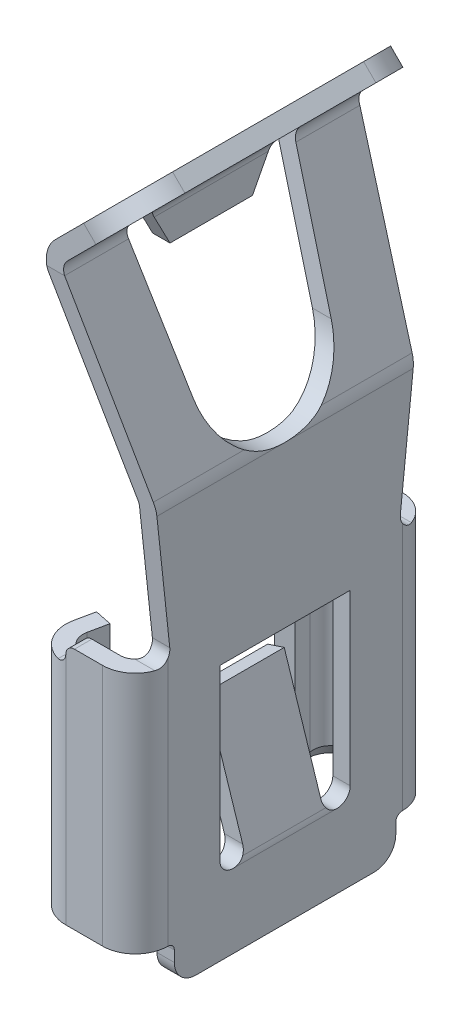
ISO-10303-21;
HEADER;
FILE_DESCRIPTION(('STEP AP214'),'2;1');
FILE_NAME('part.step','',(''),(''),'','','');
FILE_SCHEMA(('AUTOMOTIVE_DESIGN { 1 0 10303 214 1 1 1 1 }'));
ENDSEC;
DATA;
#1=APPLICATION_CONTEXT('core data for automotive mechanical design processes');
#2=APPLICATION_PROTOCOL_DEFINITION('international standard','automotive_design',2000,#1);
#3=PRODUCT_CONTEXT('',#1,'mechanical');
#4=PRODUCT('Part','Part','',(#3));
#5=PRODUCT_RELATED_PRODUCT_CATEGORY('part','',(#4));
#6=PRODUCT_DEFINITION_FORMATION('','',#4);
#7=PRODUCT_DEFINITION_CONTEXT('part definition',#1,'design');
#8=PRODUCT_DEFINITION('design','',#6,#7);
#9=PRODUCT_DEFINITION_SHAPE('','',#8);
#10=(LENGTH_UNIT() NAMED_UNIT(*) SI_UNIT(.MILLI.,.METRE.));
#11=(NAMED_UNIT(*) PLANE_ANGLE_UNIT() SI_UNIT($,.RADIAN.));
#12=(NAMED_UNIT(*) SI_UNIT($,.STERADIAN.) SOLID_ANGLE_UNIT());
#13=UNCERTAINTY_MEASURE_WITH_UNIT(LENGTH_MEASURE(1.E-05),#10,'distance_accuracy_value','');
#14=(GEOMETRIC_REPRESENTATION_CONTEXT(3) GLOBAL_UNCERTAINTY_ASSIGNED_CONTEXT((#13)) GLOBAL_UNIT_ASSIGNED_CONTEXT((#10,
#11,#12)) REPRESENTATION_CONTEXT('',''));
#15=CARTESIAN_POINT('',(0.,0.,0.));
#16=DIRECTION('',(0.,0.,1.));
#17=DIRECTION('',(1.,0.,0.));
#18=AXIS2_PLACEMENT_3D('',#15,#16,#17);
#19=CARTESIAN_POINT('',(6.25,7.05,0.795391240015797));
#20=DIRECTION('',(0.,0.,-1.));
#21=DIRECTION('',(0.,1.,0.));
#22=AXIS2_PLACEMENT_3D('',#19,#20,#21);
#23=CYLINDRICAL_SURFACE('',#22,0.35);
#24=CARTESIAN_POINT('',(6.25,7.05,-0.657155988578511));
#25=DIRECTION('',(0.,0.461663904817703,0.887054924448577));
#26=DIRECTION('',(0.,0.887054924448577,-0.461663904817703));
#27=AXIS2_PLACEMENT_3D('',#24,#25,#26);
#28=ELLIPSE('',#27,0.394564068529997,0.35);
#29=CARTESIAN_POINT('',(5.9,7.05,-0.657155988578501));
#30=VERTEX_POINT('',#29);
#31=CARTESIAN_POINT('',(6.00251262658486,7.29748737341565,-0.785959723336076));
#32=VERTEX_POINT('',#31);
#33=EDGE_CURVE('E527',#30,#32,#28,.F.);
#34=ORIENTED_EDGE('',*,*,#33,.F.);
#35=DIRECTION('',(0.,0.,-1.));
#36=VECTOR('',#35,1.);
#37=CARTESIAN_POINT('',(5.9,7.05,0.));
#38=LINE('',#37,#36);
#39=CARTESIAN_POINT('',(5.9,7.05,0.657155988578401));
#40=VERTEX_POINT('',#39);
#41=EDGE_CURVE('E523',#40,#30,#38,.T.);
#42=ORIENTED_EDGE('',*,*,#41,.F.);
#43=CARTESIAN_POINT('',(6.25,7.05,0.657155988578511));
#44=DIRECTION('',(0.,-0.461663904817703,0.887054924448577));
#45=DIRECTION('',(0.,-0.887054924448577,-0.461663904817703));
#46=AXIS2_PLACEMENT_3D('',#43,#44,#45);
#47=ELLIPSE('',#46,0.394564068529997,0.35);
#48=CARTESIAN_POINT('',(6.00251262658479,7.29748737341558,0.785959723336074));
#49=VERTEX_POINT('',#48);
#50=EDGE_CURVE('E21',#49,#40,#47,.T.);
#51=ORIENTED_EDGE('',*,*,#50,.F.);
#52=DIRECTION('',(0.,0.,1.));
#53=VECTOR('',#52,1.);
#54=CARTESIAN_POINT('',(6.00251262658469,7.29748737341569,0.));
#55=LINE('',#54,#53);
#56=EDGE_CURVE('E520',#32,#49,#55,.T.);
#57=ORIENTED_EDGE('',*,*,#56,.F.);
#58=EDGE_LOOP('',(#34,#42,#51,#57));
#59=FACE_BOUND('',#58,.T.);
#60=ADVANCED_FACE('F17',(#59),#23,.T.);
#61=CARTESIAN_POINT('',(5.9,6.68950112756,0.6834422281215));
#62=DIRECTION('',(-1.,0.,0.));
#63=DIRECTION('',(0.,1.,0.));
#64=AXIS2_PLACEMENT_3D('',#61,#62,#63);
#65=PLANE('',#64);
#66=DIRECTION('',(0.,-0.887054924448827,0.461663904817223));
#67=VECTOR('',#66,1.);
#68=CARTESIAN_POINT('',(5.9,7.05,-0.657155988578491));
#69=LINE('',#68,#67);
#70=CARTESIAN_POINT('',(5.9,6.69999999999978,-0.475000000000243));
#71=VERTEX_POINT('',#70);
#72=EDGE_CURVE('E569',#30,#71,#69,.T.);
#73=ORIENTED_EDGE('',*,*,#72,.T.);
#74=DIRECTION('',(0.,0.,-1.));
#75=VECTOR('',#74,1.);
#76=CARTESIAN_POINT('',(5.9,6.7,0.));
#77=LINE('',#76,#75);
#78=CARTESIAN_POINT('',(5.9,6.69999999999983,0.474999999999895));
#79=VERTEX_POINT('',#78);
#80=EDGE_CURVE('E536',#79,#71,#77,.T.);
#81=ORIENTED_EDGE('',*,*,#80,.F.);
#82=DIRECTION('',(0.,0.887054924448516,0.46166390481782));
#83=VECTOR('',#82,1.);
#84=CARTESIAN_POINT('',(5.9,6.70000000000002,0.474999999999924));
#85=LINE('',#84,#83);
#86=EDGE_CURVE('E571',#79,#40,#85,.T.);
#87=ORIENTED_EDGE('',*,*,#86,.T.);
#88=ORIENTED_EDGE('',*,*,#41,.T.);
#89=EDGE_LOOP('',(#73,#81,#87,#88));
#90=FACE_BOUND('',#89,.T.);
#91=ADVANCED_FACE('F584',(#90),#65,.T.);
#92=CARTESIAN_POINT('',(6.1,7.06049887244,0.6834422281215));
#93=DIRECTION('',(1.,0.,0.));
#94=DIRECTION('',(0.,-1.,0.));
#95=AXIS2_PLACEMENT_3D('',#92,#93,#94);
#96=PLANE('',#95);
#97=DIRECTION('',(0.,0.887054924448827,-0.461663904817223));
#98=VECTOR('',#97,1.);
#99=CARTESIAN_POINT('',(6.1,6.7,-0.475000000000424));
#100=LINE('',#99,#98);
#101=CARTESIAN_POINT('',(6.09999999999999,6.69999999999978,-0.47500000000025));
#102=VERTEX_POINT('',#101);
#103=CARTESIAN_POINT('',(6.1,7.05000000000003,-0.657155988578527));
#104=VERTEX_POINT('',#103);
#105=EDGE_CURVE('E567',#102,#104,#100,.T.);
#106=ORIENTED_EDGE('',*,*,#105,.T.);
#107=DIRECTION('',(0.,0.,-1.));
#108=VECTOR('',#107,1.);
#109=CARTESIAN_POINT('',(6.1,7.05000000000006,0.));
#110=LINE('',#109,#108);
#111=CARTESIAN_POINT('',(6.10000000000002,7.05000000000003,0.657155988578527));
#112=VERTEX_POINT('',#111);
#113=EDGE_CURVE('E853',#112,#104,#110,.T.);
#114=ORIENTED_EDGE('',*,*,#113,.F.);
#115=DIRECTION('',(0.,0.887054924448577,0.461663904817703));
#116=VECTOR('',#115,1.);
#117=CARTESIAN_POINT('',(6.10000000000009,7.0230831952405,0.64314725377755));
#118=LINE('',#117,#116);
#119=CARTESIAN_POINT('',(6.10000000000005,6.69999999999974,0.474999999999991));
#120=VERTEX_POINT('',#119);
#121=EDGE_CURVE('E545',#120,#112,#118,.T.);
#122=ORIENTED_EDGE('',*,*,#121,.F.);
#123=DIRECTION('',(0.,0.,1.));
#124=VECTOR('',#123,1.);
#125=CARTESIAN_POINT('',(6.09999999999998,6.7,0.));
#126=LINE('',#125,#124);
#127=EDGE_CURVE('E542',#102,#120,#126,.T.);
#128=ORIENTED_EDGE('',*,*,#127,.F.);
#129=EDGE_LOOP('',(#106,#114,#122,#128));
#130=FACE_BOUND('',#129,.T.);
#131=ADVANCED_FACE('F895',(#130),#96,.T.);
#132=CARTESIAN_POINT('',(5.987462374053,7.282437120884,1.768));
#133=DIRECTION('',(-0.707106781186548,0.707106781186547,0.));
#134=DIRECTION('',(0.707106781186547,0.707106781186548,0.));
#135=AXIS2_PLACEMENT_3D('',#132,#133,#134);
#136=PLANE('',#135);
#137=DIRECTION('',(-0.663597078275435,-0.663597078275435,0.345366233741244));
#138=VECTOR('',#137,1.);
#139=CARTESIAN_POINT('',(6.05119164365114,7.34616639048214,-0.811294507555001));
#140=LINE('',#139,#138);
#141=CARTESIAN_POINT('',(6.05119164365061,7.34616639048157,-0.811294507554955));
#142=VERTEX_POINT('',#141);
#143=EDGE_CURVE('E535',#142,#32,#140,.T.);
#144=ORIENTED_EDGE('',*,*,#143,.T.);
#145=ORIENTED_EDGE('',*,*,#56,.T.);
#146=DIRECTION('',(-0.663597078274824,-0.66359707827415,-0.34536623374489));
#147=VECTOR('',#146,1.);
#148=CARTESIAN_POINT('',(6.05119164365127,7.34616639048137,0.8112945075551));
#149=LINE('',#148,#147);
#150=CARTESIAN_POINT('',(6.05119164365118,7.34616639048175,0.811294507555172));
#151=VERTEX_POINT('',#150);
#152=EDGE_CURVE('E532',#151,#49,#149,.T.);
#153=ORIENTED_EDGE('',*,*,#152,.F.);
#154=CARTESIAN_POINT('',(6.005025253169,7.3,0.9));
#155=DIRECTION('',(-0.707106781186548,0.707106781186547,0.));
#156=DIRECTION('',(0.707106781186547,0.707106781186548,0.));
#157=AXIS2_PLACEMENT_3D('',#154,#155,#156);
#158=ELLIPSE('',#157,0.14142135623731,0.0999999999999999);
#159=CARTESIAN_POINT('',(6.00251262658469,7.29748737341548,0.999968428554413));
#160=VERTEX_POINT('',#159);
#161=EDGE_CURVE('E564',#151,#160,#158,.F.);
#162=ORIENTED_EDGE('',*,*,#161,.T.);
#163=DIRECTION('',(0.,0.,1.));
#164=VECTOR('',#163,1.);
#165=CARTESIAN_POINT('',(6.00251262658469,7.29748737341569,0.));
#166=LINE('',#165,#164);
#167=CARTESIAN_POINT('',(6.00251262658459,7.29748737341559,1.7));
#168=VERTEX_POINT('',#167);
#169=EDGE_CURVE('E566',#160,#168,#166,.T.);
#170=ORIENTED_EDGE('',*,*,#169,.T.);
#171=DIRECTION('',(0.707106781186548,0.707106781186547,0.));
#172=VECTOR('',#171,1.);
#173=CARTESIAN_POINT('',(6.378768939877,7.673743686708,1.7));
#174=LINE('',#173,#172);
#175=CARTESIAN_POINT('',(6.3307611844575,7.62573593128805,1.69999999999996));
#176=VERTEX_POINT('',#175);
#177=EDGE_CURVE('E563',#168,#176,#174,.T.);
#178=ORIENTED_EDGE('',*,*,#177,.T.);
#179=CARTESIAN_POINT('',(6.33076118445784,7.62573593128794,1.1));
#180=DIRECTION('',(-0.707106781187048,0.707106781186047,0.));
#181=DIRECTION('',(-0.707106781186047,-0.707106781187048,0.));
#182=AXIS2_PLACEMENT_3D('',#179,#180,#181);
#183=CIRCLE('',#182,0.599999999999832);
#184=CARTESIAN_POINT('',(6.75502525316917,8.04999999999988,1.1));
#185=VERTEX_POINT('',#184);
#186=EDGE_CURVE('E561',#176,#185,#183,.T.);
#187=ORIENTED_EDGE('',*,*,#186,.T.);
#188=DIRECTION('',(0.,0.,1.));
#189=VECTOR('',#188,1.);
#190=CARTESIAN_POINT('',(6.75502525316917,8.04999999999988,0.));
#191=LINE('',#190,#189);
#192=CARTESIAN_POINT('',(6.75502525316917,8.04999999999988,-1.1));
#193=VERTEX_POINT('',#192);
#194=EDGE_CURVE('E849',#193,#185,#191,.T.);
#195=ORIENTED_EDGE('',*,*,#194,.F.);
#196=CARTESIAN_POINT('',(6.33076118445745,7.62573593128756,-1.1));
#197=DIRECTION('',(0.707106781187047,-0.707106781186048,0.));
#198=DIRECTION('',(0.707106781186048,0.707106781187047,0.));
#199=AXIS2_PLACEMENT_3D('',#196,#197,#198);
#200=CIRCLE('',#199,0.600000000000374);
#201=CARTESIAN_POINT('',(6.33076118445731,7.62573593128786,-1.7));
#202=VERTEX_POINT('',#201);
#203=EDGE_CURVE('E557',#193,#202,#200,.F.);
#204=ORIENTED_EDGE('',*,*,#203,.T.);
#205=DIRECTION('',(-0.707106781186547,-0.707106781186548,0.));
#206=VECTOR('',#205,1.);
#207=CARTESIAN_POINT('',(6.378768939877,7.673743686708,-1.7));
#208=LINE('',#207,#206);
#209=CARTESIAN_POINT('',(6.00251262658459,7.29748737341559,-1.69999999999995));
#210=VERTEX_POINT('',#209);
#211=EDGE_CURVE('E560',#202,#210,#208,.T.);
#212=ORIENTED_EDGE('',*,*,#211,.T.);
#213=DIRECTION('',(0.,0.,1.));
#214=VECTOR('',#213,1.);
#215=CARTESIAN_POINT('',(6.00251262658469,7.29748737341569,0.));
#216=LINE('',#215,#214);
#217=CARTESIAN_POINT('',(6.00251262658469,7.29748737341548,-0.999968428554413));
#218=VERTEX_POINT('',#217);
#219=EDGE_CURVE('E556',#210,#218,#216,.T.);
#220=ORIENTED_EDGE('',*,*,#219,.T.);
#221=CARTESIAN_POINT('',(6.005025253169,7.3,-0.9));
#222=DIRECTION('',(-0.707106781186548,0.707106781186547,0.));
#223=DIRECTION('',(0.707106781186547,0.707106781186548,0.));
#224=AXIS2_PLACEMENT_3D('',#221,#222,#223);
#225=ELLIPSE('',#224,0.141421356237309,0.0999999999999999);
#226=EDGE_CURVE('E554',#218,#142,#225,.F.);
#227=ORIENTED_EDGE('',*,*,#226,.T.);
#228=EDGE_LOOP('',(#144,#145,#153,#162,#170,#178,#187,#195,#204,#212,#220,#227));
#229=FACE_BOUND('',#228,.T.);
#230=ADVANCED_FACE('F530',(#229),#136,.T.);
#231=CARTESIAN_POINT('',(6.11049887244,6.7,0.494));
#232=DIRECTION('',(0.,-1.,0.));
#233=DIRECTION('',(-1.,0.,0.));
#234=AXIS2_PLACEMENT_3D('',#231,#232,#233);
#235=PLANE('',#234);
#236=DIRECTION('',(1.,0.,0.));
#237=VECTOR('',#236,1.);
#238=CARTESIAN_POINT('',(6.117017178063,6.6999999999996,-0.474999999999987));
#239=LINE('',#238,#237);
#240=EDGE_CURVE('E580',#71,#102,#239,.T.);
#241=ORIENTED_EDGE('',*,*,#240,.T.);
#242=ORIENTED_EDGE('',*,*,#127,.T.);
#243=DIRECTION('',(1.,0.,0.));
#244=VECTOR('',#243,1.);
#245=CARTESIAN_POINT('',(6.117017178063,6.6999999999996,0.474999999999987));
#246=LINE('',#245,#244);
#247=EDGE_CURVE('E541',#79,#120,#246,.T.);
#248=ORIENTED_EDGE('',*,*,#247,.F.);
#249=ORIENTED_EDGE('',*,*,#80,.T.);
#250=EDGE_LOOP('',(#241,#242,#248,#249));
#251=FACE_BOUND('',#250,.T.);
#252=ADVANCED_FACE('F888',(#251),#235,.T.);
#253=CARTESIAN_POINT('',(5.88950112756,7.359089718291,0.8180203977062));
#254=DIRECTION('',(0.,-0.461663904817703,0.887054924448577));
#255=DIRECTION('',(0.,-0.887054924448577,-0.461663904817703));
#256=AXIS2_PLACEMENT_3D('',#253,#254,#255);
#257=PLANE('',#256);
#258=DIRECTION('',(-0.663597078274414,-0.66359707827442,-0.345366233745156));
#259=VECTOR('',#258,1.);
#260=CARTESIAN_POINT('',(6.33403435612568,7.34616639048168,0.8112945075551));
#261=LINE('',#260,#259);
#262=CARTESIAN_POINT('',(6.33403435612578,7.34616639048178,0.811294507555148));
#263=VERTEX_POINT('',#262);
#264=CARTESIAN_POINT('',(6.14393398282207,7.15606601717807,0.712357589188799));
#265=VERTEX_POINT('',#264);
#266=EDGE_CURVE('E847',#263,#265,#261,.T.);
#267=ORIENTED_EDGE('',*,*,#266,.F.);
#268=DIRECTION('',(1.,0.,0.));
#269=VECTOR('',#268,1.);
#270=CARTESIAN_POINT('',(6.19067088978,7.34616639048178,0.811294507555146));
#271=LINE('',#270,#269);
#272=EDGE_CURVE('E540',#151,#263,#271,.T.);
#273=ORIENTED_EDGE('',*,*,#272,.F.);
#274=ORIENTED_EDGE('',*,*,#152,.T.);
#275=ORIENTED_EDGE('',*,*,#50,.T.);
#276=ORIENTED_EDGE('',*,*,#86,.F.);
#277=ORIENTED_EDGE('',*,*,#247,.T.);
#278=ORIENTED_EDGE('',*,*,#121,.T.);
#279=CARTESIAN_POINT('',(6.25,7.05,0.657155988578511));
#280=DIRECTION('',(0.,-0.461663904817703,0.887054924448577));
#281=DIRECTION('',(0.,-0.887054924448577,-0.461663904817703));
#282=AXIS2_PLACEMENT_3D('',#279,#280,#281);
#283=ELLIPSE('',#282,0.169098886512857,0.150000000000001);
#284=EDGE_CURVE('E551',#265,#112,#283,.T.);
#285=ORIENTED_EDGE('',*,*,#284,.F.);
#286=EDGE_LOOP('',(#267,#273,#274,#275,#276,#277,#278,#285));
#287=FACE_BOUND('',#286,.T.);
#288=ADVANCED_FACE('F538',(#287),#257,.T.);
#289=CARTESIAN_POINT('',(6.25,7.05,0.720905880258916));
#290=DIRECTION('',(0.,0.,-1.));
#291=DIRECTION('',(-1.,0.,0.));
#292=AXIS2_PLACEMENT_3D('',#289,#290,#291);
#293=CYLINDRICAL_SURFACE('',#292,0.150000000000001);
#294=CARTESIAN_POINT('',(6.25,7.05,-0.657155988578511));
#295=DIRECTION('',(0.,0.461663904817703,0.887054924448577));
#296=DIRECTION('',(0.,0.887054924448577,-0.461663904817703));
#297=AXIS2_PLACEMENT_3D('',#294,#295,#296);
#298=ELLIPSE('',#297,0.169098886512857,0.150000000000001);
#299=CARTESIAN_POINT('',(6.14393398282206,7.15606601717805,-0.712357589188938));
#300=VERTEX_POINT('',#299);
#301=EDGE_CURVE('E900',#104,#300,#298,.F.);
#302=ORIENTED_EDGE('',*,*,#301,.T.);
#303=DIRECTION('',(0.,0.,-1.));
#304=VECTOR('',#303,1.);
#305=CARTESIAN_POINT('',(6.14393398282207,7.15606601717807,0.));
#306=LINE('',#305,#304);
#307=EDGE_CURVE('E854',#265,#300,#306,.T.);
#308=ORIENTED_EDGE('',*,*,#307,.F.);
#309=ORIENTED_EDGE('',*,*,#284,.T.);
#310=ORIENTED_EDGE('',*,*,#113,.T.);
#311=EDGE_LOOP('',(#302,#308,#309,#310));
#312=FACE_BOUND('',#311,.T.);
#313=ADVANCED_FACE('F898',(#312),#293,.F.);
#314=CARTESIAN_POINT('',(6.747601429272,8.057423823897,1.144));
#315=DIRECTION('',(0.707106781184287,0.707106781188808,0.));
#316=DIRECTION('',(0.707106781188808,-0.707106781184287,0.));
#317=AXIS2_PLACEMENT_3D('',#314,#315,#316);
#318=PLANE('',#317);
#319=DIRECTION('',(0.707106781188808,-0.707106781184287,0.));
#320=VECTOR('',#319,1.);
#321=CARTESIAN_POINT('',(6.825735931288,7.9792893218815,1.1));
#322=LINE('',#321,#320);
#323=CARTESIAN_POINT('',(6.8964466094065,7.90857864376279,1.1));
#324=VERTEX_POINT('',#323);
#325=EDGE_CURVE('E835',#185,#324,#322,.T.);
#326=ORIENTED_EDGE('',*,*,#325,.T.);
#327=DIRECTION('',(0.,0.,1.));
#328=VECTOR('',#327,1.);
#329=CARTESIAN_POINT('',(6.89644660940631,7.90857864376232,0.));
#330=LINE('',#329,#328);
#331=CARTESIAN_POINT('',(6.89644660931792,7.90857864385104,-1.1));
#332=VERTEX_POINT('',#331);
#333=EDGE_CURVE('E791',#332,#324,#330,.T.);
#334=ORIENTED_EDGE('',*,*,#333,.F.);
#335=DIRECTION('',(-0.707106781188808,0.707106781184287,0.));
#336=VECTOR('',#335,1.);
#337=CARTESIAN_POINT('',(6.825735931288,7.9792893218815,-1.1));
#338=LINE('',#337,#336);
#339=EDGE_CURVE('E850',#332,#193,#338,.T.);
#340=ORIENTED_EDGE('',*,*,#339,.T.);
#341=ORIENTED_EDGE('',*,*,#194,.T.);
#342=EDGE_LOOP('',(#326,#334,#340,#341));
#343=FACE_BOUND('',#342,.T.);
#344=ADVANCED_FACE('F2508',(#343),#318,.T.);
#345=CARTESIAN_POINT('',(6.47218254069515,7.48431457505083,1.1));
#346=DIRECTION('',(-0.707106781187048,0.707106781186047,0.));
#347=DIRECTION('',(-0.707106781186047,-0.707106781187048,0.));
#348=AXIS2_PLACEMENT_3D('',#345,#346,#347);
#349=CYLINDRICAL_SURFACE('',#348,0.599999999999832);
#350=ORIENTED_EDGE('',*,*,#325,.F.);
#351=ORIENTED_EDGE('',*,*,#186,.F.);
#352=DIRECTION('',(-0.707106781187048,0.707106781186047,0.));
#353=VECTOR('',#352,1.);
#354=CARTESIAN_POINT('',(6.47218254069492,7.4843145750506,1.69999999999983));
#355=LINE('',#354,#353);
#356=CARTESIAN_POINT('',(6.47218254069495,7.4843145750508,1.69999999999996));
#357=VERTEX_POINT('',#356);
#358=EDGE_CURVE('E1098',#176,#357,#355,.F.);
#359=ORIENTED_EDGE('',*,*,#358,.T.);
#360=CARTESIAN_POINT('',(6.47218254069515,7.48431457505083,1.1));
#361=DIRECTION('',(-0.707106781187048,0.707106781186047,0.));
#362=DIRECTION('',(-0.707106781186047,-0.707106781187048,0.));
#363=AXIS2_PLACEMENT_3D('',#360,#361,#362);
#364=CIRCLE('',#363,0.599999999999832);
#365=EDGE_CURVE('E794',#324,#357,#364,.F.);
#366=ORIENTED_EDGE('',*,*,#365,.F.);
#367=EDGE_LOOP('',(#350,#351,#359,#366));
#368=FACE_BOUND('',#367,.T.);
#369=ADVANCED_FACE('F2500',(#368),#349,.T.);
#370=CARTESIAN_POINT('',(5.80642538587,0.498,-1.014725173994));
#371=DIRECTION('',(0.97865995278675,0.,-0.205486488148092));
#372=DIRECTION('',(-0.205486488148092,0.,-0.97865995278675));
#373=AXIS2_PLACEMENT_3D('',#370,#371,#372);
#374=PLANE('',#373);
#375=DIRECTION('',(-0.205486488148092,0.,-0.97865995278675));
#376=VECTOR('',#375,1.);
#377=CARTESIAN_POINT('',(5.781402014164,0.55,-1.133902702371));
#378=LINE('',#377,#376);
#379=CARTESIAN_POINT('',(5.80426800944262,0.55,-1.02500000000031));
#380=VERTEX_POINT('',#379);
#381=CARTESIAN_POINT('',(5.75853601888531,0.550000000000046,-1.24280540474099));
#382=VERTEX_POINT('',#381);
#383=EDGE_CURVE('E826',#380,#382,#378,.T.);
#384=ORIENTED_EDGE('',*,*,#383,.F.);
#385=DIRECTION('',(0.,1.,0.));
#386=VECTOR('',#385,1.);
#387=CARTESIAN_POINT('',(5.80426800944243,1.85,-1.02500000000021));
#388=LINE('',#387,#386);
#389=CARTESIAN_POINT('',(5.80426800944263,3.15,-1.02500000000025));
#390=VERTEX_POINT('',#389);
#391=EDGE_CURVE('E842',#380,#390,#388,.T.);
#392=ORIENTED_EDGE('',*,*,#391,.T.);
#393=DIRECTION('',(0.205486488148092,0.,0.97865995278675));
#394=VECTOR('',#393,1.);
#395=CARTESIAN_POINT('',(5.781402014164,3.15,-1.133902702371));
#396=LINE('',#395,#394);
#397=CARTESIAN_POINT('',(5.75853601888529,3.14999999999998,-1.24280540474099));
#398=VERTEX_POINT('',#397);
#399=EDGE_CURVE('E833',#398,#390,#396,.T.);
#400=ORIENTED_EDGE('',*,*,#399,.F.);
#401=DIRECTION('',(0.,-1.,0.));
#402=VECTOR('',#401,1.);
#403=CARTESIAN_POINT('',(5.75853601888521,1.89999999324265,-1.2428054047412));
#404=LINE('',#403,#402);
#405=EDGE_CURVE('E1074',#398,#382,#404,.T.);
#406=ORIENTED_EDGE('',*,*,#405,.T.);
#407=EDGE_LOOP('',(#384,#392,#400,#406));
#408=FACE_BOUND('',#407,.T.);
#409=ADVANCED_FACE('F1847',(#408),#374,.F.);
#410=CARTESIAN_POINT('',(5.80642538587,0.498,1.014725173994));
#411=DIRECTION('',(-0.97865995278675,0.,-0.205486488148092));
#412=DIRECTION('',(-0.205486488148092,0.,0.97865995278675));
#413=AXIS2_PLACEMENT_3D('',#410,#411,#412);
#414=PLANE('',#413);
#415=DIRECTION('',(-0.205486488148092,0.,0.97865995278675));
#416=VECTOR('',#415,1.);
#417=CARTESIAN_POINT('',(5.781402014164,0.55,1.133902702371));
#418=LINE('',#417,#416);
#419=CARTESIAN_POINT('',(5.80426800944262,0.55,1.02500000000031));
#420=VERTEX_POINT('',#419);
#421=CARTESIAN_POINT('',(5.75853601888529,0.550000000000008,1.24280540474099));
#422=VERTEX_POINT('',#421);
#423=EDGE_CURVE('E825',#420,#422,#418,.T.);
#424=ORIENTED_EDGE('',*,*,#423,.T.);
#425=DIRECTION('',(0.,1.,0.));
#426=VECTOR('',#425,1.);
#427=CARTESIAN_POINT('',(5.75853601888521,1.89999999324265,1.2428054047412));
#428=LINE('',#427,#426);
#429=CARTESIAN_POINT('',(5.75853601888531,3.15000000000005,1.24280540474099));
#430=VERTEX_POINT('',#429);
#431=EDGE_CURVE('E803',#422,#430,#428,.T.);
#432=ORIENTED_EDGE('',*,*,#431,.T.);
#433=DIRECTION('',(0.205486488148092,0.,-0.97865995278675));
#434=VECTOR('',#433,1.);
#435=CARTESIAN_POINT('',(5.781402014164,3.15,1.133902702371));
#436=LINE('',#435,#434);
#437=CARTESIAN_POINT('',(5.80426800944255,3.15,1.02500000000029));
#438=VERTEX_POINT('',#437);
#439=EDGE_CURVE('E822',#430,#438,#436,.T.);
#440=ORIENTED_EDGE('',*,*,#439,.T.);
#441=DIRECTION('',(0.,1.,0.));
#442=VECTOR('',#441,1.);
#443=CARTESIAN_POINT('',(5.80426800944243,1.85,1.02500000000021));
#444=LINE('',#443,#442);
#445=EDGE_CURVE('E815',#420,#438,#444,.T.);
#446=ORIENTED_EDGE('',*,*,#445,.F.);
#447=EDGE_LOOP('',(#424,#432,#440,#446));
#448=FACE_BOUND('',#447,.T.);
#449=ADVANCED_FACE('F1978',(#448),#414,.T.);
#450=CARTESIAN_POINT('',(5.88950112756,7.359089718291,-0.8180203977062));
#451=DIRECTION('',(0.,0.461663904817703,0.887054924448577));
#452=DIRECTION('',(0.,-0.887054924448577,0.461663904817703));
#453=AXIS2_PLACEMENT_3D('',#450,#451,#452);
#454=PLANE('',#453);
#455=DIRECTION('',(0.663597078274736,0.663597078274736,-0.34536623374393));
#456=VECTOR('',#455,1.);
#457=CARTESIAN_POINT('',(6.14393398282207,7.15606601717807,-0.712357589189));
#458=LINE('',#457,#456);
#459=CARTESIAN_POINT('',(6.33403435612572,7.34616639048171,-0.811294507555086));
#460=VERTEX_POINT('',#459);
#461=EDGE_CURVE('E796',#300,#460,#458,.T.);
#462=ORIENTED_EDGE('',*,*,#461,.F.);
#463=ORIENTED_EDGE('',*,*,#301,.F.);
#464=ORIENTED_EDGE('',*,*,#105,.F.);
#465=ORIENTED_EDGE('',*,*,#240,.F.);
#466=ORIENTED_EDGE('',*,*,#72,.F.);
#467=ORIENTED_EDGE('',*,*,#33,.T.);
#468=ORIENTED_EDGE('',*,*,#143,.F.);
#469=DIRECTION('',(-1.,0.,0.));
#470=VECTOR('',#469,1.);
#471=CARTESIAN_POINT('',(6.190672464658,7.34616639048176,-0.811294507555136));
#472=LINE('',#471,#470);
#473=EDGE_CURVE('E818',#460,#142,#472,.T.);
#474=ORIENTED_EDGE('',*,*,#473,.F.);
#475=EDGE_LOOP('',(#462,#463,#464,#465,#466,#467,#468,#474));
#476=FACE_BOUND('',#475,.T.);
#477=ADVANCED_FACE('F575',(#476),#454,.F.);
#478=CARTESIAN_POINT('',(6.010274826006,0.498,1.068254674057));
#479=DIRECTION('',(0.205486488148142,0.,-0.97865995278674));
#480=DIRECTION('',(-0.97865995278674,0.,-0.205486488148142));
#481=AXIS2_PLACEMENT_3D('',#478,#479,#480);
#482=PLANE('',#481);
#483=DIRECTION('',(0.97865995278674,0.,0.205486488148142));
#484=VECTOR('',#483,1.);
#485=CARTESIAN_POINT('',(5.902134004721,3.15,1.045548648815));
#486=LINE('',#485,#484);
#487=CARTESIAN_POINT('',(5.99999999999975,3.15,1.06609729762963));
#488=VERTEX_POINT('',#487);
#489=EDGE_CURVE('E813',#438,#488,#486,.T.);
#490=ORIENTED_EDGE('',*,*,#489,.T.);
#491=DIRECTION('',(0.,1.,0.));
#492=VECTOR('',#491,1.);
#493=CARTESIAN_POINT('',(5.99999999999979,1.9106217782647,1.06609729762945));
#494=LINE('',#493,#492);
#495=CARTESIAN_POINT('',(5.99999999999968,0.671243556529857,1.06609729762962));
#496=VERTEX_POINT('',#495);
#497=EDGE_CURVE('E915',#496,#488,#494,.T.);
#498=ORIENTED_EDGE('',*,*,#497,.F.);
#499=DIRECTION('',(-0.489329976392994,-0.86602540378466,-0.102743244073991));
#500=VECTOR('',#499,1.);
#501=CARTESIAN_POINT('',(5.99999999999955,0.6712435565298,1.06609729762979));
#502=LINE('',#501,#500);
#503=CARTESIAN_POINT('',(5.9314938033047,0.55,1.05171324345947));
#504=VERTEX_POINT('',#503);
#505=EDGE_CURVE('E867',#496,#504,#502,.T.);
#506=ORIENTED_EDGE('',*,*,#505,.T.);
#507=DIRECTION('',(-0.97865995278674,0.,-0.205486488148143));
#508=VECTOR('',#507,1.);
#509=CARTESIAN_POINT('',(5.902134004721,0.55,1.045548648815));
#510=LINE('',#509,#508);
#511=EDGE_CURVE('E862',#504,#420,#510,.T.);
#512=ORIENTED_EDGE('',*,*,#511,.T.);
#513=ORIENTED_EDGE('',*,*,#445,.T.);
#514=EDGE_LOOP('',(#490,#498,#506,#512,#513));
#515=FACE_BOUND('',#514,.T.);
#516=ADVANCED_FACE('F913',(#515),#482,.T.);
#517=CARTESIAN_POINT('',(5.9909251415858,7.3,0.9));
#518=DIRECTION('',(1.,0.,0.));
#519=DIRECTION('',(0.,1.,0.));
#520=AXIS2_PLACEMENT_3D('',#517,#518,#519);
#521=CYLINDRICAL_SURFACE('',#520,0.0999999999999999);
#522=CARTESIAN_POINT('',(5.99329458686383,7.28791244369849,0.9992667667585));
#523=CARTESIAN_POINT('',(5.99348244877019,7.28811514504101,0.999291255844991));
#524=CARTESIAN_POINT('',(5.99367058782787,7.28831766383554,0.999315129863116));
#525=CARTESIAN_POINT('',(5.99404738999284,7.28872230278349,0.999361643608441));
#526=CARTESIAN_POINT('',(5.99423605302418,7.28892442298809,0.999384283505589));
#527=CARTESIAN_POINT('',(5.99461390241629,7.28932826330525,0.999428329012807));
#528=CARTESIAN_POINT('',(5.99480308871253,7.2895299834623,0.999449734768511));
#529=CARTESIAN_POINT('',(5.99518198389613,7.28993302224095,0.999491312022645));
#530=CARTESIAN_POINT('',(5.99537169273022,7.29013434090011,0.999511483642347));
#531=CARTESIAN_POINT('',(5.99575163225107,7.29053657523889,0.999550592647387));
#532=CARTESIAN_POINT('',(5.99594186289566,7.29073749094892,0.999569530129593));
#533=CARTESIAN_POINT('',(5.99632284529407,7.2911389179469,0.99960617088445));
#534=CARTESIAN_POINT('',(5.99651359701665,7.2913394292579,0.99962387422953));
#535=CARTESIAN_POINT('',(5.99689562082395,7.29174004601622,0.999658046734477));
#536=CARTESIAN_POINT('',(5.99708689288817,7.29194015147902,0.999674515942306));
#537=CARTESIAN_POINT('',(5.99746995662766,7.29233995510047,0.999706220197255));
#538=CARTESIAN_POINT('',(5.99766174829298,7.29253965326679,0.999721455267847));
#539=CARTESIAN_POINT('',(5.99804585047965,7.29293864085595,0.999750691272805));
#540=CARTESIAN_POINT('',(5.99823816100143,7.29313793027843,0.999764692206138));
#541=CARTESIAN_POINT('',(5.99862330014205,7.29353609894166,0.999791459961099));
#542=CARTESIAN_POINT('',(5.99881612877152,7.29373497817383,0.999804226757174));
#543=CARTESIAN_POINT('',(5.99920230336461,7.29413232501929,0.999828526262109));
#544=CARTESIAN_POINT('',(5.99939564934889,7.29433079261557,0.999840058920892));
#545=CARTESIAN_POINT('',(5.9997828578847,7.29472731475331,0.999861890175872));
#546=CARTESIAN_POINT('',(5.99997672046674,7.2949253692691,0.99987218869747));
#547=CARTESIAN_POINT('',(6.00036496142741,7.29532106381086,0.999891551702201));
#548=CARTESIAN_POINT('',(6.0005593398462,7.29551870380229,0.999900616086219));
#549=CARTESIAN_POINT('',(6.0009486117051,7.2959135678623,0.999917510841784));
#550=CARTESIAN_POINT('',(6.00114350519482,7.29611079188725,0.999925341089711));
#551=CARTESIAN_POINT('',(6.00153380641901,7.29650482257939,0.99993976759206));
#552=CARTESIAN_POINT('',(6.00172921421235,7.29670162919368,0.999946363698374));
#553=CARTESIAN_POINT('',(6.00212054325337,7.29709482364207,0.999958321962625));
#554=CARTESIAN_POINT('',(6.00231646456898,7.29729121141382,0.999963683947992));
#555=CARTESIAN_POINT('',(6.0025126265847,7.29748737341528,0.999968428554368));
#556=B_SPLINE_CURVE_WITH_KNOTS('',3,(#522,#523,#524,#525,#526,#527,#528,#529,#530,#531,#532,
#533,#534,#535,#536,#537,#538,#539,#540,#541,#542,#543,#544,#545,#546,#547,#548,#549,#550,#551,
#552,#553,#554,#555),.UNSPECIFIED.,.F.,.F.,(4,2,2,2,2,2,2,2,2,2,2,2,2,2,2,2,4),(0.,
0.000832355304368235,0.00166459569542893,0.0024967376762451,0.00332879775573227,
0.00416079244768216,0.00499273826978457,0.0058246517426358,0.00665654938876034,
0.00748844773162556,0.00832036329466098,0.00915231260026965,0.00998431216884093,
0.0108163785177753,0.0116485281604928,0.012480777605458,0.0133131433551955),.UNSPECIFIED.);
#557=CARTESIAN_POINT('',(5.99329558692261,7.28791352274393,0.999266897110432));
#558=VERTEX_POINT('',#557);
#559=EDGE_CURVE('E797',#558,#160,#556,.T.);
#560=ORIENTED_EDGE('',*,*,#559,.T.);
#561=ORIENTED_EDGE('',*,*,#161,.F.);
#562=ORIENTED_EDGE('',*,*,#272,.T.);
#563=CARTESIAN_POINT('',(6.287867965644,7.3,0.9));
#564=DIRECTION('',(0.707106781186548,-0.707106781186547,0.));
#565=DIRECTION('',(0.707106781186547,0.707106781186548,0.));
#566=AXIS2_PLACEMENT_3D('',#563,#564,#565);
#567=ELLIPSE('',#566,0.14142135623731,0.0999999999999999);
#568=CARTESIAN_POINT('',(6.27578040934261,7.28791244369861,0.999266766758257));
#569=VERTEX_POINT('',#568);
#570=EDGE_CURVE('E905',#569,#263,#567,.F.);
#571=ORIENTED_EDGE('',*,*,#570,.F.);
#572=DIRECTION('',(-1.,0.,0.));
#573=VECTOR('',#572,1.);
#574=CARTESIAN_POINT('',(6.2935709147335,7.28791244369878,0.999266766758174));
#575=LINE('',#574,#573);
#576=EDGE_CURVE('E1123',#569,#558,#575,.T.);
#577=ORIENTED_EDGE('',*,*,#576,.T.);
#578=EDGE_LOOP('',(#560,#561,#562,#571,#577));
#579=FACE_BOUND('',#578,.T.);
#580=ADVANCED_FACE('F2465',(#579),#521,.F.);
#581=CARTESIAN_POINT('',(6.911496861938,7.923628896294,1.768));
#582=DIRECTION('',(0.707106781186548,-0.707106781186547,0.));
#583=DIRECTION('',(-0.707106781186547,-0.707106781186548,0.));
#584=AXIS2_PLACEMENT_3D('',#581,#582,#583);
#585=PLANE('',#584);
#586=DIRECTION('',(0.704500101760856,0.704500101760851,0.0857858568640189));
#587=VECTOR('',#586,1.);
#588=CARTESIAN_POINT('',(6.1439339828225,7.1560660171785,0.983212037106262));
#589=LINE('',#588,#587);
#590=CARTESIAN_POINT('',(6.14393398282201,7.15606601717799,0.98321203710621));
#591=VERTEX_POINT('',#590);
#592=EDGE_CURVE('E1120',#591,#569,#589,.T.);
#593=ORIENTED_EDGE('',*,*,#592,.T.);
#594=ORIENTED_EDGE('',*,*,#570,.T.);
#595=ORIENTED_EDGE('',*,*,#266,.T.);
#596=ORIENTED_EDGE('',*,*,#307,.T.);
#597=ORIENTED_EDGE('',*,*,#461,.T.);
#598=CARTESIAN_POINT('',(6.287867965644,7.3,-0.9));
#599=DIRECTION('',(0.707106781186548,-0.707106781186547,0.));
#600=DIRECTION('',(0.707106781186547,0.707106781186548,0.));
#601=AXIS2_PLACEMENT_3D('',#598,#599,#600);
#602=ELLIPSE('',#601,0.141421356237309,0.0999999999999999);
#603=CARTESIAN_POINT('',(6.27578040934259,7.28791244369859,-0.999266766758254));
#604=VERTEX_POINT('',#603);
#605=EDGE_CURVE('E821',#604,#460,#602,.T.);
#606=ORIENTED_EDGE('',*,*,#605,.F.);
#607=DIRECTION('',(-0.704500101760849,-0.704500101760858,0.0857858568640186));
#608=VECTOR('',#607,1.);
#609=CARTESIAN_POINT('',(6.27578040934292,7.28791244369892,-0.999266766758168));
#610=LINE('',#609,#608);
#611=CARTESIAN_POINT('',(6.14393398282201,7.15606601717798,-0.983212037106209));
#612=VERTEX_POINT('',#611);
#613=EDGE_CURVE('E1156',#604,#612,#610,.T.);
#614=ORIENTED_EDGE('',*,*,#613,.T.);
#615=DIRECTION('',(0.,0.,1.));
#616=VECTOR('',#615,1.);
#617=CARTESIAN_POINT('',(6.14393398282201,7.15606601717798,0.));
#618=LINE('',#617,#616);
#619=CARTESIAN_POINT('',(6.143933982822,7.15606601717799,-1.69999999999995));
#620=VERTEX_POINT('',#619);
#621=EDGE_CURVE('E1063',#620,#612,#618,.T.);
#622=ORIENTED_EDGE('',*,*,#621,.F.);
#623=DIRECTION('',(0.707106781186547,0.707106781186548,0.));
#624=VECTOR('',#623,1.);
#625=CARTESIAN_POINT('',(6.520190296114,7.53232233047,-1.7));
#626=LINE('',#625,#624);
#627=CARTESIAN_POINT('',(6.47218254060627,7.48431457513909,-1.7));
#628=VERTEX_POINT('',#627);
#629=EDGE_CURVE('E795',#620,#628,#626,.T.);
#630=ORIENTED_EDGE('',*,*,#629,.T.);
#631=CARTESIAN_POINT('',(6.47218254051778,7.48431457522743,-1.1));
#632=DIRECTION('',(0.707106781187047,-0.707106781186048,0.));
#633=DIRECTION('',(0.707106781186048,0.707106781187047,0.));
#634=AXIS2_PLACEMENT_3D('',#631,#632,#633);
#635=CIRCLE('',#634,0.600000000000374);
#636=EDGE_CURVE('E811',#628,#332,#635,.T.);
#637=ORIENTED_EDGE('',*,*,#636,.T.);
#638=ORIENTED_EDGE('',*,*,#333,.T.);
#639=ORIENTED_EDGE('',*,*,#365,.T.);
#640=DIRECTION('',(-0.707106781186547,-0.707106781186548,0.));
#641=VECTOR('',#640,1.);
#642=CARTESIAN_POINT('',(6.911496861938,7.923628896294,1.7));
#643=LINE('',#642,#641);
#644=CARTESIAN_POINT('',(6.14393398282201,7.15606601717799,1.7));
#645=VERTEX_POINT('',#644);
#646=EDGE_CURVE('E802',#357,#645,#643,.T.);
#647=ORIENTED_EDGE('',*,*,#646,.T.);
#648=DIRECTION('',(0.,0.,1.));
#649=VECTOR('',#648,1.);
#650=CARTESIAN_POINT('',(6.14393398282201,7.15606601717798,0.));
#651=LINE('',#650,#649);
#652=EDGE_CURVE('E783',#591,#645,#651,.T.);
#653=ORIENTED_EDGE('',*,*,#652,.F.);
#654=EDGE_LOOP('',(#593,#594,#595,#596,#597,#606,#614,#622,#630,#637,#638,#639,#647,#653));
#655=FACE_BOUND('',#654,.T.);
#656=ADVANCED_FACE('F904',(#655),#585,.T.);
#657=CARTESIAN_POINT('',(6.483626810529,6.979895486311,1.7));
#658=DIRECTION('',(0.,0.,-1.));
#659=DIRECTION('',(-1.,0.,0.));
#660=AXIS2_PLACEMENT_3D('',#657,#658,#659);
#661=PLANE('',#660);
#662=CARTESIAN_POINT('',(6.25,7.05,1.7));
#663=DIRECTION('',(0.,0.,-1.));
#664=DIRECTION('',(-1.,0.,0.));
#665=AXIS2_PLACEMENT_3D('',#662,#663,#664);
#666=CIRCLE('',#665,0.35);
#667=CARTESIAN_POINT('',(5.90474569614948,6.99255902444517,1.70000000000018));
#668=VERTEX_POINT('',#667);
#669=EDGE_CURVE('E801',#168,#668,#666,.F.);
#670=ORIENTED_EDGE('',*,*,#669,.T.);
#671=DIRECTION('',(-1.,0.,0.));
#672=VECTOR('',#671,1.);
#673=CARTESIAN_POINT('',(6.4273728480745,6.99255902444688,1.70000000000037));
#674=LINE('',#673,#672);
#675=CARTESIAN_POINT('',(6.11143400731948,6.99255902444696,1.70000000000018));
#676=VERTEX_POINT('',#675);
#677=EDGE_CURVE('E1114',#676,#668,#674,.T.);
#678=ORIENTED_EDGE('',*,*,#677,.F.);
#679=CARTESIAN_POINT('',(6.25,7.05,1.7));
#680=DIRECTION('',(0.,0.,-1.));
#681=DIRECTION('',(-1.,0.,0.));
#682=AXIS2_PLACEMENT_3D('',#679,#680,#681);
#683=CIRCLE('',#682,0.150000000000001);
#684=EDGE_CURVE('E789',#645,#676,#683,.F.);
#685=ORIENTED_EDGE('',*,*,#684,.F.);
#686=ORIENTED_EDGE('',*,*,#646,.F.);
#687=ORIENTED_EDGE('',*,*,#358,.F.);
#688=ORIENTED_EDGE('',*,*,#177,.F.);
#689=EDGE_LOOP('',(#670,#678,#685,#686,#687,#688));
#690=FACE_BOUND('',#689,.T.);
#691=ADVANCED_FACE('F1111',(#690),#661,.F.);
#692=CARTESIAN_POINT('',(6.25,7.05,1.7));
#693=DIRECTION('',(0.,0.,-1.));
#694=DIRECTION('',(-1.,0.,0.));
#695=AXIS2_PLACEMENT_3D('',#692,#693,#694);
#696=CYLINDRICAL_SURFACE('',#695,0.35);
#697=DIRECTION('',(0.,0.,-1.));
#698=VECTOR('',#697,1.);
#699=CARTESIAN_POINT('',(5.92667935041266,6.91597105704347,0.));
#700=LINE('',#699,#698);
#701=CARTESIAN_POINT('',(5.92667935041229,6.91597105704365,1.69179991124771));
#702=VERTEX_POINT('',#701);
#703=CARTESIAN_POINT('',(5.92667935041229,6.91597105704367,0.953976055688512));
#704=VERTEX_POINT('',#703);
#705=EDGE_CURVE('E781',#702,#704,#700,.T.);
#706=ORIENTED_EDGE('',*,*,#705,.F.);
#707=CARTESIAN_POINT('',(6.25,7.05,1.70615006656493));
#708=DIRECTION('',(0.,-0.106459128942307,0.994317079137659));
#709=DIRECTION('',(0.,-0.994317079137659,-0.106459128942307));
#710=AXIS2_PLACEMENT_3D('',#707,#708,#709);
#711=ELLIPSE('',#710,0.35200039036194,0.35);
#712=EDGE_CURVE('E1209',#668,#702,#711,.T.);
#713=ORIENTED_EDGE('',*,*,#712,.F.);
#714=ORIENTED_EDGE('',*,*,#669,.F.);
#715=ORIENTED_EDGE('',*,*,#169,.F.);
#716=ORIENTED_EDGE('',*,*,#559,.F.);
#717=CARTESIAN_POINT('',(6.25,7.05,0.970296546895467));
#718=DIRECTION('',(0.,-0.120875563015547,0.992667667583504));
#719=DIRECTION('',(0.,-0.992667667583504,-0.120875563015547));
#720=AXIS2_PLACEMENT_3D('',#717,#718,#719);
#721=ELLIPSE('',#720,0.352585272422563,0.35);
#722=EDGE_CURVE('E1130',#558,#704,#721,.T.);
#723=ORIENTED_EDGE('',*,*,#722,.T.);
#724=EDGE_LOOP('',(#706,#713,#714,#715,#716,#723));
#725=FACE_BOUND('',#724,.T.);
#726=ADVANCED_FACE('F773',(#725),#696,.T.);
#727=CARTESIAN_POINT('',(6.754803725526,4.918270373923,1.759471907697));
#728=DIRECTION('',(-0.923773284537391,-0.382939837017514,0.));
#729=DIRECTION('',(-0.382939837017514,0.923773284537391,0.));
#730=AXIS2_PLACEMENT_3D('',#727,#728,#729);
#731=PLANE('',#730);
#732=DIRECTION('',(0.381080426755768,-0.919287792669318,-0.0984259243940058));
#733=VECTOR('',#732,1.);
#734=CARTESIAN_POINT('',(5.92667935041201,6.91597105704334,1.69179991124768));
#735=LINE('',#734,#733);
#736=CARTESIAN_POINT('',(6.73856599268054,4.95744097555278,1.48210482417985));
#737=VERTEX_POINT('',#736);
#738=EDGE_CURVE('E1602',#702,#737,#735,.T.);
#739=ORIENTED_EDGE('',*,*,#738,.F.);
#740=ORIENTED_EDGE('',*,*,#705,.T.);
#741=DIRECTION('',(0.380539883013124,-0.917983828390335,-0.111781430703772));
#742=VECTOR('',#741,1.);
#743=CARTESIAN_POINT('',(5.92667935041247,6.91597105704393,0.95397605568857));
#744=LINE('',#743,#742);
#745=CARTESIAN_POINT('',(6.47083257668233,5.60329954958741,0.794134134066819));
#746=VERTEX_POINT('',#745);
#747=EDGE_CURVE('E1140',#704,#746,#744,.T.);
#748=ORIENTED_EDGE('',*,*,#747,.T.);
#749=CARTESIAN_POINT('',(6.43074649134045,5.7,0.));
#750=DIRECTION('',(-0.923773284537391,-0.382939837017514,0.));
#751=DIRECTION('',(0.382939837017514,-0.923773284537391,0.));
#752=AXIS2_PLACEMENT_3D('',#749,#750,#751);
#753=ELLIPSE('',#752,0.866013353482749,0.8);
#754=CARTESIAN_POINT('',(6.73856599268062,4.95744097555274,0.297667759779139));
#755=VERTEX_POINT('',#754);
#756=EDGE_CURVE('E1086',#746,#755,#753,.F.);
#757=ORIENTED_EDGE('',*,*,#756,.T.);
#758=DIRECTION('',(0.,0.,1.));
#759=VECTOR('',#758,1.);
#760=CARTESIAN_POINT('',(6.73856599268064,4.95744097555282,0.));
#761=LINE('',#760,#759);
#762=EDGE_CURVE('E1085',#755,#737,#761,.T.);
#763=ORIENTED_EDGE('',*,*,#762,.T.);
#764=EDGE_LOOP('',(#739,#740,#748,#757,#763));
#765=FACE_BOUND('',#764,.T.);
#766=ADVANCED_FACE('F1849',(#765),#731,.T.);
#767=CARTESIAN_POINT('',(6.010274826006,0.498,-1.068254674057));
#768=DIRECTION('',(-0.205486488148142,0.,-0.97865995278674));
#769=DIRECTION('',(-0.97865995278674,0.,0.205486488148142));
#770=AXIS2_PLACEMENT_3D('',#767,#768,#769);
#771=PLANE('',#770);
#772=DIRECTION('',(-0.97865995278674,0.,0.205486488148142));
#773=VECTOR('',#772,1.);
#774=CARTESIAN_POINT('',(6.010274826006,3.15,-1.068254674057));
#775=LINE('',#774,#773);
#776=CARTESIAN_POINT('',(5.99999999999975,3.15,-1.06609729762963));
#777=VERTEX_POINT('',#776);
#778=EDGE_CURVE('E1207',#777,#390,#775,.T.);
#779=ORIENTED_EDGE('',*,*,#778,.T.);
#780=ORIENTED_EDGE('',*,*,#391,.F.);
#781=DIRECTION('',(-0.97865995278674,0.,0.205486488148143));
#782=VECTOR('',#781,1.);
#783=CARTESIAN_POINT('',(5.902134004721,0.55,-1.045548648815));
#784=LINE('',#783,#782);
#785=CARTESIAN_POINT('',(5.9314938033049,0.549999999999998,-1.05171324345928));
#786=VERTEX_POINT('',#785);
#787=EDGE_CURVE('E839',#786,#380,#784,.T.);
#788=ORIENTED_EDGE('',*,*,#787,.F.);
#789=DIRECTION('',(0.489329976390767,0.866025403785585,-0.102743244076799));
#790=VECTOR('',#789,1.);
#791=CARTESIAN_POINT('',(5.92635639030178,0.540907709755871,-1.05063455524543));
#792=LINE('',#791,#790);
#793=CARTESIAN_POINT('',(5.99999999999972,0.671243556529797,-1.06609729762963));
#794=VERTEX_POINT('',#793);
#795=EDGE_CURVE('E843',#794,#786,#792,.F.);
#796=ORIENTED_EDGE('',*,*,#795,.F.);
#797=DIRECTION('',(0.,1.,0.));
#798=VECTOR('',#797,1.);
#799=CARTESIAN_POINT('',(5.99999999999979,1.9106217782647,-1.06609729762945));
#800=LINE('',#799,#798);
#801=EDGE_CURVE('E1071',#794,#777,#800,.T.);
#802=ORIENTED_EDGE('',*,*,#801,.T.);
#803=EDGE_LOOP('',(#779,#780,#788,#796,#802));
#804=FACE_BOUND('',#803,.T.);
#805=ADVANCED_FACE('F766',(#804),#771,.F.);
#806=CARTESIAN_POINT('',(6.15,3.2661999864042,-1.325));
#807=DIRECTION('',(0.,-1.,0.));
#808=DIRECTION('',(0.,0.,-1.));
#809=AXIS2_PLACEMENT_3D('',#806,#807,#808);
#810=CYLINDRICAL_SURFACE('',#809,0.4);
#811=CARTESIAN_POINT('',(6.15,0.550000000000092,-1.325));
#812=DIRECTION('',(0.,-1.,0.));
#813=DIRECTION('',(0.,0.,-1.));
#814=AXIS2_PLACEMENT_3D('',#811,#812,#813);
#815=CIRCLE('',#814,0.4);
#816=CARTESIAN_POINT('',(6.14999999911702,0.550000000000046,-1.725));
#817=VERTEX_POINT('',#816);
#818=EDGE_CURVE('E1077',#382,#817,#815,.T.);
#819=ORIENTED_EDGE('',*,*,#818,.F.);
#820=ORIENTED_EDGE('',*,*,#405,.F.);
#821=CARTESIAN_POINT('',(6.15,3.14999999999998,-1.325));
#822=DIRECTION('',(0.,-1.,0.));
#823=DIRECTION('',(0.,0.,-1.));
#824=AXIS2_PLACEMENT_3D('',#821,#822,#823);
#825=CIRCLE('',#824,0.4);
#826=CARTESIAN_POINT('',(6.04999999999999,3.14999999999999,-1.71229833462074));
#827=VERTEX_POINT('',#826);
#828=EDGE_CURVE('E758',#398,#827,#825,.T.);
#829=ORIENTED_EDGE('',*,*,#828,.T.);
#830=CARTESIAN_POINT('',(6.15,3.249999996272,-1.725));
#831=CARTESIAN_POINT('',(6.15000477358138,3.24437766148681,-1.72499662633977));
#832=CARTESIAN_POINT('',(6.14952612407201,3.23875671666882,-1.72499994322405));
#833=CARTESIAN_POINT('',(6.14763707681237,3.22767733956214,-1.72499502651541));
#834=CARTESIAN_POINT('',(6.14622730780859,3.22221880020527,-1.72498680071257));
#835=CARTESIAN_POINT('',(6.14251007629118,3.2116132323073,-1.72493391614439));
#836=CARTESIAN_POINT('',(6.14020215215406,3.20646636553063,-1.72488923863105));
#837=CARTESIAN_POINT('',(6.13475658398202,3.19663450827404,-1.72471875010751));
#838=CARTESIAN_POINT('',(6.13161907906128,3.19194944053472,-1.72459295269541));
#839=CARTESIAN_POINT('',(6.1246146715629,3.18318657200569,-1.72420897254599));
#840=CARTESIAN_POINT('',(6.12074969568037,3.17910721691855,-1.72395113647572));
#841=CARTESIAN_POINT('',(6.11240133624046,3.17165872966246,-1.72325098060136));
#842=CARTESIAN_POINT('',(6.10791799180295,3.16828955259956,-1.72280867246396));
#843=CARTESIAN_POINT('',(6.09852358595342,3.1623876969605,-1.72170175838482));
#844=CARTESIAN_POINT('',(6.09361759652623,3.15984647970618,-1.72103957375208));
#845=CARTESIAN_POINT('',(6.08348875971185,3.15561460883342,-1.71946479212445));
#846=CARTESIAN_POINT('',(6.07826596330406,3.15392381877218,-1.71855223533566));
#847=CARTESIAN_POINT('',(6.06917830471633,3.15177892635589,-1.71676878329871));
#848=CARTESIAN_POINT('',(6.0653502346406,3.15110977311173,-1.71596001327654));
#849=CARTESIAN_POINT('',(6.05767657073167,3.15022023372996,-1.71421976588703));
#850=CARTESIAN_POINT('',(6.05383101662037,3.14999910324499,-1.71328849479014));
#851=CARTESIAN_POINT('',(6.05000000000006,3.14999999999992,-1.71229833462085));
#852=B_SPLINE_CURVE_WITH_KNOTS('',3,(#830,#831,#832,#833,#834,#835,#836,#837,#838,#839,#840,
#841,#842,#843,#844,#845,#846,#847,#848,#849,#850,#851),.UNSPECIFIED.,.F.,.F.,(4,2,2,2,2,2,2,2,
2,2,4),(0.,0.0168446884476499,0.0336780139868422,0.0505200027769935,0.0673591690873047,
0.0841543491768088,0.100948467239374,0.117563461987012,0.134175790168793,0.146057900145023,
0.157920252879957),.UNSPECIFIED.);
#853=CARTESIAN_POINT('',(6.14999999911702,3.249999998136,-1.72499999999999));
#854=VERTEX_POINT('',#853);
#855=EDGE_CURVE('E746',#854,#827,#852,.T.);
#856=ORIENTED_EDGE('',*,*,#855,.F.);
#857=DIRECTION('',(0.,-1.,0.));
#858=VECTOR('',#857,1.);
#859=CARTESIAN_POINT('',(6.14999999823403,1.95,-1.725));
#860=LINE('',#859,#858);
#861=EDGE_CURVE('E1179',#854,#817,#860,.T.);
#862=ORIENTED_EDGE('',*,*,#861,.T.);
#863=EDGE_LOOP('',(#819,#820,#829,#856,#862));
#864=FACE_BOUND('',#863,.T.);
#865=ADVANCED_FACE('F760',(#864),#810,.T.);
#866=CARTESIAN_POINT('',(6.15,0.550000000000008,1.325));
#867=DIRECTION('',(0.,1.,0.));
#868=DIRECTION('',(0.,0.,1.));
#869=AXIS2_PLACEMENT_3D('',#866,#867,#868);
#870=CYLINDRICAL_SURFACE('',#869,0.4);
#871=ORIENTED_EDGE('',*,*,#431,.F.);
#872=CARTESIAN_POINT('',(6.15,0.550000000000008,1.325));
#873=DIRECTION('',(0.,1.,0.));
#874=DIRECTION('',(0.,0.,1.));
#875=AXIS2_PLACEMENT_3D('',#872,#873,#874);
#876=CIRCLE('',#875,0.4);
#877=CARTESIAN_POINT('',(6.14999999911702,0.550000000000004,1.725));
#878=VERTEX_POINT('',#877);
#879=EDGE_CURVE('E812',#878,#422,#876,.F.);
#880=ORIENTED_EDGE('',*,*,#879,.F.);
#881=DIRECTION('',(0.,-1.,0.));
#882=VECTOR('',#881,1.);
#883=CARTESIAN_POINT('',(6.14999999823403,1.95,1.725));
#884=LINE('',#883,#882);
#885=CARTESIAN_POINT('',(6.14999999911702,3.249999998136,1.72499999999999));
#886=VERTEX_POINT('',#885);
#887=EDGE_CURVE('E1188',#886,#878,#884,.T.);
#888=ORIENTED_EDGE('',*,*,#887,.F.);
#889=CARTESIAN_POINT('',(6.05000000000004,3.15,1.71229833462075));
#890=CARTESIAN_POINT('',(6.05542905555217,3.14999423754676,1.71370474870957));
#891=CARTESIAN_POINT('',(6.06089187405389,3.15044198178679,1.71498893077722));
#892=CARTESIAN_POINT('',(6.07172116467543,3.15223495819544,1.71730360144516));
#893=CARTESIAN_POINT('',(6.07708766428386,3.15357992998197,1.71833416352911));
#894=CARTESIAN_POINT('',(6.08757136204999,3.15716043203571,1.72013449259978));
#895=CARTESIAN_POINT('',(6.09268818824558,3.15939724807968,1.72090388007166));
#896=CARTESIAN_POINT('',(6.10249835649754,3.1647064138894,1.7222002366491));
#897=CARTESIAN_POINT('',(6.10719190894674,3.16777834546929,1.72272732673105));
#898=CARTESIAN_POINT('',(6.11593947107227,3.17461876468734,1.72357112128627));
#899=CARTESIAN_POINT('',(6.12000251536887,3.17837531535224,1.7238910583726));
#900=CARTESIAN_POINT('',(6.12745888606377,3.186513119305,1.72438188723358));
#901=CARTESIAN_POINT('',(6.13085200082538,3.19089456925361,1.72455273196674));
#902=CARTESIAN_POINT('',(6.13688968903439,3.20018928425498,1.72479662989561));
#903=CARTESIAN_POINT('',(6.13952915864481,3.20510587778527,1.72486902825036));
#904=CARTESIAN_POINT('',(6.14395424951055,3.2153087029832,1.72496045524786));
#905=CARTESIAN_POINT('',(6.14574024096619,3.22059477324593,1.72497950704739));
#906=CARTESIAN_POINT('',(6.14804589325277,3.22991573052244,1.72499643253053));
#907=CARTESIAN_POINT('',(6.14877792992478,3.23389947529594,1.72499865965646));
#908=CARTESIAN_POINT('',(6.14975514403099,3.24192163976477,1.72499999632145));
#909=CARTESIAN_POINT('',(6.15000087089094,3.2459599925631,1.72499910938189));
#910=CARTESIAN_POINT('',(6.15,3.249999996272,1.725));
#911=B_SPLINE_CURVE_WITH_KNOTS('',3,(#889,#890,#891,#892,#893,#894,#895,#896,#897,#898,#899,
#900,#901,#902,#903,#904,#905,#906,#907,#908,#909,#910),.UNSPECIFIED.,.F.,.F.,(4,2,2,2,2,2,2,2,
2,2,4),(0.,0.0168085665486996,0.0336122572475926,0.0504402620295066,0.0672598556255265,
0.0838102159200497,0.10036579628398,0.117030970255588,0.133688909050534,0.145812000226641,
0.157921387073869),.UNSPECIFIED.);
#912=CARTESIAN_POINT('',(6.05000000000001,3.15000000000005,1.71229833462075));
#913=VERTEX_POINT('',#912);
#914=EDGE_CURVE('E1144',#913,#886,#911,.T.);
#915=ORIENTED_EDGE('',*,*,#914,.F.);
#916=CARTESIAN_POINT('',(6.15,3.15000000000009,1.325));
#917=DIRECTION('',(0.,1.,0.));
#918=DIRECTION('',(0.,0.,1.));
#919=AXIS2_PLACEMENT_3D('',#916,#917,#918);
#920=CIRCLE('',#919,0.4);
#921=EDGE_CURVE('E1154',#913,#430,#920,.F.);
#922=ORIENTED_EDGE('',*,*,#921,.T.);
#923=EDGE_LOOP('',(#871,#880,#888,#915,#922));
#924=FACE_BOUND('',#923,.T.);
#925=ADVANCED_FACE('F765',(#924),#870,.T.);
#926=CARTESIAN_POINT('',(6.33076118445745,7.62573593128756,-1.1));
#927=DIRECTION('',(0.707106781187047,-0.707106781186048,0.));
#928=DIRECTION('',(0.707106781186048,0.707106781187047,0.));
#929=AXIS2_PLACEMENT_3D('',#926,#927,#928);
#930=CYLINDRICAL_SURFACE('',#929,0.600000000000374);
#931=ORIENTED_EDGE('',*,*,#339,.F.);
#932=ORIENTED_EDGE('',*,*,#636,.F.);
#933=DIRECTION('',(0.707106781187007,-0.707106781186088,0.));
#934=VECTOR('',#933,1.);
#935=CARTESIAN_POINT('',(6.33076118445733,7.625735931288,-1.7));
#936=LINE('',#935,#934);
#937=EDGE_CURVE('E1315',#202,#628,#936,.T.);
#938=ORIENTED_EDGE('',*,*,#937,.F.);
#939=ORIENTED_EDGE('',*,*,#203,.F.);
#940=EDGE_LOOP('',(#931,#932,#938,#939));
#941=FACE_BOUND('',#940,.T.);
#942=ADVANCED_FACE('F2418',(#941),#930,.T.);
#943=CARTESIAN_POINT('',(6.25,7.05,-0.958881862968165));
#944=DIRECTION('',(0.,0.,-1.));
#945=DIRECTION('',(-1.,0.,0.));
#946=AXIS2_PLACEMENT_3D('',#943,#944,#945);
#947=CYLINDRICAL_SURFACE('',#946,0.150000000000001);
#948=CARTESIAN_POINT('',(6.25,7.05,-1.69999999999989));
#949=DIRECTION('',(0.,0.,-1.));
#950=DIRECTION('',(-1.,0.,0.));
#951=AXIS2_PLACEMENT_3D('',#948,#949,#950);
#952=CIRCLE('',#951,0.150000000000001);
#953=CARTESIAN_POINT('',(6.11143400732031,6.99255902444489,-1.70000000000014));
#954=VERTEX_POINT('',#953);
#955=EDGE_CURVE('E1318',#620,#954,#952,.F.);
#956=ORIENTED_EDGE('',*,*,#955,.F.);
#957=ORIENTED_EDGE('',*,*,#621,.T.);
#958=CARTESIAN_POINT('',(6.25,7.05,-0.970296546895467));
#959=DIRECTION('',(0.,-0.120875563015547,-0.992667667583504));
#960=DIRECTION('',(0.,0.992667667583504,-0.120875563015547));
#961=AXIS2_PLACEMENT_3D('',#958,#959,#960);
#962=ELLIPSE('',#961,0.151107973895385,0.150000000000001);
#963=CARTESIAN_POINT('',(6.11143400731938,6.99255902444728,-0.963302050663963));
#964=VERTEX_POINT('',#963);
#965=EDGE_CURVE('E1160',#612,#964,#962,.F.);
#966=ORIENTED_EDGE('',*,*,#965,.T.);
#967=DIRECTION('',(0.,0.,1.));
#968=VECTOR('',#967,1.);
#969=CARTESIAN_POINT('',(6.11143400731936,6.99255902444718,0.));
#970=LINE('',#969,#968);
#971=EDGE_CURVE('E1045',#954,#964,#970,.T.);
#972=ORIENTED_EDGE('',*,*,#971,.F.);
#973=EDGE_LOOP('',(#956,#957,#966,#972));
#974=FACE_BOUND('',#973,.T.);
#975=ADVANCED_FACE('F1515',(#974),#947,.F.);
#976=CARTESIAN_POINT('',(5.99092522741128,7.3,-0.9));
#977=DIRECTION('',(1.,0.,0.));
#978=DIRECTION('',(0.,0.,-1.));
#979=AXIS2_PLACEMENT_3D('',#976,#977,#978);
#980=CYLINDRICAL_SURFACE('',#979,0.0999999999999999);
#981=ORIENTED_EDGE('',*,*,#605,.T.);
#982=ORIENTED_EDGE('',*,*,#473,.T.);
#983=ORIENTED_EDGE('',*,*,#226,.F.);
#984=CARTESIAN_POINT('',(6.0025126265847,7.29748737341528,-0.999968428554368));
#985=CARTESIAN_POINT('',(6.00231646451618,7.29729121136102,-0.999963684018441));
#986=CARTESIAN_POINT('',(6.00212054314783,7.29709482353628,-0.999958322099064));
#987=CARTESIAN_POINT('',(6.00172921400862,7.29670162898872,-0.99994636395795));
#988=CARTESIAN_POINT('',(6.0015338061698,7.29650482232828,-0.999939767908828));
#989=CARTESIAN_POINT('',(6.00114350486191,7.29611079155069,-0.999925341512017));
#990=CARTESIAN_POINT('',(6.00094861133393,7.29591356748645,-0.999917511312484));
#991=CARTESIAN_POINT('',(6.0005593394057,7.29551870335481,-0.999900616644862));
#992=CARTESIAN_POINT('',(6.00036496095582,7.29532106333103,-0.99989155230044));
#993=CARTESIAN_POINT('',(5.99997671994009,7.29492536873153,-0.999872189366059));
#994=CARTESIAN_POINT('',(5.99978285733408,7.29472731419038,-0.999861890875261));
#995=CARTESIAN_POINT('',(5.9993956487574,7.29433079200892,-0.999840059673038));
#996=CARTESIAN_POINT('',(5.99920230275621,7.29413232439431,-0.999828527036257));
#997=CARTESIAN_POINT('',(5.99881612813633,7.29373497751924,-0.99980422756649));
#998=CARTESIAN_POINT('',(5.99862329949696,7.29353609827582,-0.999791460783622));
#999=CARTESIAN_POINT('',(5.99823816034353,7.2931379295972,-0.999764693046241));
#1000=CARTESIAN_POINT('',(5.99804584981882,7.2929386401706,-0.999750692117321));
#1001=CARTESIAN_POINT('',(5.99766174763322,7.29253965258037,-0.999721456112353));
#1002=CARTESIAN_POINT('',(5.99746995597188,7.2923399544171,-0.999706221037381));
#1003=CARTESIAN_POINT('',(5.99708689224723,7.29194015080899,-0.999674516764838));
#1004=CARTESIAN_POINT('',(5.99689562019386,7.29174004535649,-0.999658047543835));
#1005=CARTESIAN_POINT('',(5.99651359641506,7.29133942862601,-0.999623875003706));
#1006=CARTESIAN_POINT('',(5.99632284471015,7.29113891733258,-0.999606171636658));
#1007=CARTESIAN_POINT('',(5.99594186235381,7.29073749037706,-0.999569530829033));
#1008=CARTESIAN_POINT('',(5.99575163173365,7.29053657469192,-0.999550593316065));
#1009=CARTESIAN_POINT('',(5.99537169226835,7.29013434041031,-0.999511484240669));
#1010=CARTESIAN_POINT('',(5.99518198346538,7.28993302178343,-0.999491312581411));
#1011=CARTESIAN_POINT('',(5.9948030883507,7.28952998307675,-0.999449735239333));
#1012=CARTESIAN_POINT('',(5.99461390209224,7.2893282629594,-0.99942832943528));
#1013=CARTESIAN_POINT('',(5.99423605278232,7.2889244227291,-0.99938428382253));
#1014=CARTESIAN_POINT('',(5.99404738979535,7.28872230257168,-0.999361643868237));
#1015=CARTESIAN_POINT('',(5.99367058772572,7.28831766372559,-0.999315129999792));
#1016=CARTESIAN_POINT('',(5.99348244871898,7.28811514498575,-0.999291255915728));
#1017=CARTESIAN_POINT('',(5.99329458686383,7.28791244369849,-0.999266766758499));
#1018=B_SPLINE_CURVE_WITH_KNOTS('',3,(#984,#985,#986,#987,#988,#989,#990,#991,#992,#993,#994,
#995,#996,#997,#998,#999,#1000,#1001,#1002,#1003,#1004,#1005,#1006,#1007,#1008,#1009,#1010,
#1011,#1012,#1013,#1014,#1015,#1016,#1017),.UNSPECIFIED.,.F.,.F.,(4,2,2,2,2,2,2,2,2,2,2,2,2,2,2,
2,4),(0.,0.000832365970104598,0.00166461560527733,0.0024967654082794,0.00332883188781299,
0.00416083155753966,0.00499278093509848,0.0058246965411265,0.0066565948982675,
0.00748849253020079,0.00832040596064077,0.00915235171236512,0.00998434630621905,
0.0108164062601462,0.0116485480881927,0.0124807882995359,0.0133131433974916),.UNSPECIFIED.);
#1019=CARTESIAN_POINT('',(5.99329458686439,7.28791244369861,-0.999266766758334));
#1020=VERTEX_POINT('',#1019);
#1021=EDGE_CURVE('E1054',#218,#1020,#1018,.T.);
#1022=ORIENTED_EDGE('',*,*,#1021,.T.);
#1023=DIRECTION('',(1.,0.,0.));
#1024=VECTOR('',#1023,1.);
#1025=CARTESIAN_POINT('',(6.2935709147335,7.28791244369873,-0.999266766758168));
#1026=LINE('',#1025,#1024);
#1027=EDGE_CURVE('E820',#1020,#604,#1026,.T.);
#1028=ORIENTED_EDGE('',*,*,#1027,.T.);
#1029=EDGE_LOOP('',(#981,#982,#983,#1022,#1028));
#1030=FACE_BOUND('',#1029,.T.);
#1031=ADVANCED_FACE('F1231',(#1030),#980,.F.);
#1032=CARTESIAN_POINT('',(5.884055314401,5.569607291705,-0.790031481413));
#1033=DIRECTION('',(0.,-0.120875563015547,-0.992667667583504));
#1034=DIRECTION('',(0.,0.992667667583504,-0.120875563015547));
#1035=AXIS2_PLACEMENT_3D('',#1032,#1033,#1034);
#1036=PLANE('',#1035);
#1037=DIRECTION('',(0.380539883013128,-0.917983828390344,0.111781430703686));
#1038=VECTOR('',#1037,1.);
#1039=CARTESIAN_POINT('',(6.11143400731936,6.99255902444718,-0.963302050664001));
#1040=LINE('',#1039,#1038);
#1041=CARTESIAN_POINT('',(6.68733591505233,5.60329954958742,-0.794134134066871));
#1042=VERTEX_POINT('',#1041);
#1043=EDGE_CURVE('E1314',#964,#1042,#1040,.T.);
#1044=ORIENTED_EDGE('',*,*,#1043,.F.);
#1045=ORIENTED_EDGE('',*,*,#965,.F.);
#1046=ORIENTED_EDGE('',*,*,#613,.F.);
#1047=ORIENTED_EDGE('',*,*,#1027,.F.);
#1048=CARTESIAN_POINT('',(6.25,7.05,-0.970296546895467));
#1049=DIRECTION('',(0.,-0.120875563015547,-0.992667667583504));
#1050=DIRECTION('',(0.,0.992667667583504,-0.120875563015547));
#1051=AXIS2_PLACEMENT_3D('',#1048,#1049,#1050);
#1052=ELLIPSE('',#1051,0.352585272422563,0.35);
#1053=CARTESIAN_POINT('',(5.92667935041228,6.91597105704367,-0.953976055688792));
#1054=VERTEX_POINT('',#1053);
#1055=EDGE_CURVE('E1323',#1020,#1054,#1052,.F.);
#1056=ORIENTED_EDGE('',*,*,#1055,.T.);
#1057=DIRECTION('',(-0.380539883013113,0.917983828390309,-0.111781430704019));
#1058=VECTOR('',#1057,1.);
#1059=CARTESIAN_POINT('',(6.47083257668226,5.60329954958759,-0.794134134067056));
#1060=LINE('',#1059,#1058);
#1061=CARTESIAN_POINT('',(6.47083257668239,5.60329954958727,-0.794134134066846));
#1062=VERTEX_POINT('',#1061);
#1063=EDGE_CURVE('E1040',#1062,#1054,#1060,.T.);
#1064=ORIENTED_EDGE('',*,*,#1063,.F.);
#1065=DIRECTION('',(-1.,0.,0.));
#1066=VECTOR('',#1065,1.);
#1067=CARTESIAN_POINT('',(6.2935709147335,5.60329954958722,-0.794134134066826));
#1068=LINE('',#1067,#1066);
#1069=EDGE_CURVE('E1061',#1042,#1062,#1068,.T.);
#1070=ORIENTED_EDGE('',*,*,#1069,.F.);
#1071=EDGE_LOOP('',(#1044,#1045,#1046,#1047,#1056,#1064,#1070));
#1072=FACE_BOUND('',#1071,.T.);
#1073=ADVANCED_FACE('F1336',(#1072),#1036,.F.);
#1074=CARTESIAN_POINT('',(5.952110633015,0.6216684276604,1.294177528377));
#1075=DIRECTION('',(0.978659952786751,0.,0.205486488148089));
#1076=DIRECTION('',(0.205486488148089,0.,-0.978659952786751));
#1077=AXIS2_PLACEMENT_3D('',#1074,#1075,#1076);
#1078=PLANE('',#1077);
#1079=DIRECTION('',(0.205486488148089,0.,-0.978659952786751));
#1080=VECTOR('',#1079,1.);
#1081=CARTESIAN_POINT('',(5.952110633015,3.15,1.294177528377));
#1082=LINE('',#1081,#1080);
#1083=CARTESIAN_POINT('',(5.95426800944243,3.15000000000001,1.28390270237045));
#1084=VERTEX_POINT('',#1083);
#1085=EDGE_CURVE('E1145',#488,#1084,#1082,.F.);
#1086=ORIENTED_EDGE('',*,*,#1085,.T.);
#1087=DIRECTION('',(0.,1.,0.));
#1088=VECTOR('',#1087,1.);
#1089=CARTESIAN_POINT('',(5.9542680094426,1.96062177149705,1.2839027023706));
#1090=LINE('',#1089,#1088);
#1091=CARTESIAN_POINT('',(5.95426800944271,0.67124355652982,1.28390270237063));
#1092=VERTEX_POINT('',#1091);
#1093=EDGE_CURVE('E1024',#1092,#1084,#1090,.T.);
#1094=ORIENTED_EDGE('',*,*,#1093,.F.);
#1095=DIRECTION('',(0.205486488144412,0.,-0.978659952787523));
#1096=VECTOR('',#1095,1.);
#1097=CARTESIAN_POINT('',(5.97713400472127,0.671243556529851,1.17500000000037));
#1098=LINE('',#1097,#1096);
#1099=EDGE_CURVE('E921',#1092,#496,#1098,.T.);
#1100=ORIENTED_EDGE('',*,*,#1099,.T.);
#1101=ORIENTED_EDGE('',*,*,#497,.T.);
#1102=EDGE_LOOP('',(#1086,#1094,#1100,#1101));
#1103=FACE_BOUND('',#1102,.T.);
#1104=ADVANCED_FACE('F1859',(#1103),#1078,.T.);
#1105=CARTESIAN_POINT('',(6.06049887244,3.15,1.780790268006));
#1106=DIRECTION('',(0.,-1.,0.));
#1107=DIRECTION('',(-1.,0.,0.));
#1108=AXIS2_PLACEMENT_3D('',#1105,#1106,#1107);
#1109=PLANE('',#1108);
#1110=ORIENTED_EDGE('',*,*,#1085,.F.);
#1111=ORIENTED_EDGE('',*,*,#489,.F.);
#1112=ORIENTED_EDGE('',*,*,#439,.F.);
#1113=ORIENTED_EDGE('',*,*,#921,.F.);
#1114=DIRECTION('',(0.,0.,1.));
#1115=VECTOR('',#1114,1.);
#1116=CARTESIAN_POINT('',(6.04999999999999,3.15,1.6116143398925));
#1117=LINE('',#1116,#1115);
#1118=CARTESIAN_POINT('',(6.04999990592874,3.15000000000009,1.49820502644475));
#1119=VERTEX_POINT('',#1118);
#1120=EDGE_CURVE('E1141',#1119,#913,#1117,.T.);
#1121=ORIENTED_EDGE('',*,*,#1120,.F.);
#1122=CARTESIAN_POINT('',(6.15,3.15000000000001,1.325));
#1123=DIRECTION('',(0.,1.,0.));
#1124=DIRECTION('',(0.,0.,1.));
#1125=AXIS2_PLACEMENT_3D('',#1122,#1123,#1124);
#1126=CIRCLE('',#1125,0.2);
#1127=EDGE_CURVE('E1148',#1084,#1119,#1126,.T.);
#1128=ORIENTED_EDGE('',*,*,#1127,.F.);
#1129=EDGE_LOOP('',(#1110,#1111,#1112,#1113,#1121,#1128));
#1130=FACE_BOUND('',#1129,.T.);
#1131=ADVANCED_FACE('F1229',(#1130),#1109,.F.);
#1132=CARTESIAN_POINT('',(6.05,3.25,1.4968442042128));
#1133=DIRECTION('',(0.,0.,1.));
#1134=DIRECTION('',(1.,0.,0.));
#1135=AXIS2_PLACEMENT_3D('',#1132,#1133,#1134);
#1136=CYLINDRICAL_SURFACE('',#1135,0.0999999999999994);
#1137=ORIENTED_EDGE('',*,*,#1120,.T.);
#1138=ORIENTED_EDGE('',*,*,#914,.T.);
#1139=DIRECTION('',(0.,0.,-1.));
#1140=VECTOR('',#1139,1.);
#1141=CARTESIAN_POINT('',(6.15,3.25,1.625));
#1142=LINE('',#1141,#1140);
#1143=CARTESIAN_POINT('',(6.1499999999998,3.24999999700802,1.52500000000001));
#1144=VERTEX_POINT('',#1143);
#1145=EDGE_CURVE('E1017',#886,#1144,#1142,.T.);
#1146=ORIENTED_EDGE('',*,*,#1145,.T.);
#1147=CARTESIAN_POINT('',(6.04999981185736,3.15000000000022,1.49820497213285));
#1148=CARTESIAN_POINT('',(6.05481080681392,3.14999319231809,1.50099208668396));
#1149=CARTESIAN_POINT('',(6.05975468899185,3.15034733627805,1.50356958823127));
#1150=CARTESIAN_POINT('',(6.06974524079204,3.15184024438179,1.50827253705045));
#1151=CARTESIAN_POINT('',(6.07479204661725,3.15298012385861,1.51039733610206));
#1152=CARTESIAN_POINT('',(6.0848306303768,3.15611378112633,1.5141613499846));
#1153=CARTESIAN_POINT('',(6.08982211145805,3.15811092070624,1.5157986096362));
#1154=CARTESIAN_POINT('',(6.09951327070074,3.1629500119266,1.51858836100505));
#1155=CARTESIAN_POINT('',(6.10421338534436,3.16579066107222,1.51974159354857));
#1156=CARTESIAN_POINT('',(6.11287036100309,3.17206280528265,1.52157024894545));
#1157=CARTESIAN_POINT('',(6.11685472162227,3.17544950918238,1.52226986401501));
#1158=CARTESIAN_POINT('',(6.12426665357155,3.18282978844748,1.52337304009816));
#1159=CARTESIAN_POINT('',(6.12769387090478,3.18682374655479,1.52377641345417));
#1160=CARTESIAN_POINT('',(6.13393515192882,3.19537953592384,1.52437892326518));
#1161=CARTESIAN_POINT('',(6.1367382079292,3.19994962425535,1.52457459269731));
#1162=CARTESIAN_POINT('',(6.1415796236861,3.2094813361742,1.52483732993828));
#1163=CARTESIAN_POINT('',(6.14361797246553,3.21444296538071,1.52490439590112));
#1164=CARTESIAN_POINT('',(6.14681807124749,3.2244493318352,1.5249812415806));
#1165=CARTESIAN_POINT('',(6.14800803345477,3.2294850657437,1.52499294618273));
#1166=CARTESIAN_POINT('',(6.14960071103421,3.2396801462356,1.52499990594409));
#1167=CARTESIAN_POINT('',(6.15000331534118,3.24483951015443,1.52499515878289));
#1168=CARTESIAN_POINT('',(6.15,3.24999999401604,1.525));
#1169=B_SPLINE_CURVE_WITH_KNOTS('',3,(#1147,#1148,#1149,#1150,#1151,#1152,#1153,#1154,#1155,
#1156,#1157,#1158,#1159,#1160,#1161,#1162,#1163,#1164,#1165,#1166,#1167,#1168),.UNSPECIFIED.,
.F.,.F.,(4,2,2,2,2,2,2,2,2,2,4),(0.,0.016678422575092,0.0333805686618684,0.0501488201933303,
0.0668913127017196,0.0826452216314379,0.0984091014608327,0.114432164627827,0.130455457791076,
0.145917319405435,0.1613813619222),.UNSPECIFIED.);
#1170=EDGE_CURVE('E1235',#1119,#1144,#1169,.T.);
#1171=ORIENTED_EDGE('',*,*,#1170,.F.);
#1172=EDGE_LOOP('',(#1137,#1138,#1146,#1171));
#1173=FACE_BOUND('',#1172,.T.);
#1174=ADVANCED_FACE('F1225',(#1173),#1136,.F.);
#1175=CARTESIAN_POINT('',(5.884055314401,7.321604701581,1.003369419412));
#1176=DIRECTION('',(0.,-0.120875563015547,0.992667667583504));
#1177=DIRECTION('',(0.,-0.992667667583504,-0.120875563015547));
#1178=AXIS2_PLACEMENT_3D('',#1175,#1176,#1177);
#1179=PLANE('',#1178);
#1180=ORIENTED_EDGE('',*,*,#576,.F.);
#1181=ORIENTED_EDGE('',*,*,#592,.F.);
#1182=CARTESIAN_POINT('',(6.25,7.05,0.970296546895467));
#1183=DIRECTION('',(0.,-0.120875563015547,0.992667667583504));
#1184=DIRECTION('',(0.,-0.992667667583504,-0.120875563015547));
#1185=AXIS2_PLACEMENT_3D('',#1182,#1183,#1184);
#1186=ELLIPSE('',#1185,0.151107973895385,0.150000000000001);
#1187=CARTESIAN_POINT('',(6.11143400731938,6.99255902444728,0.963302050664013));
#1188=VERTEX_POINT('',#1187);
#1189=EDGE_CURVE('E790',#1188,#591,#1186,.F.);
#1190=ORIENTED_EDGE('',*,*,#1189,.F.);
#1191=DIRECTION('',(-0.38053988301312,0.917983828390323,0.111781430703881));
#1192=VECTOR('',#1191,1.);
#1193=CARTESIAN_POINT('',(6.68733591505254,5.60329954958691,0.7941341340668));
#1194=LINE('',#1193,#1192);
#1195=CARTESIAN_POINT('',(6.68733591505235,5.60329954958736,0.794134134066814));
#1196=VERTEX_POINT('',#1195);
#1197=EDGE_CURVE('E1019',#1196,#1188,#1194,.T.);
#1198=ORIENTED_EDGE('',*,*,#1197,.F.);
#1199=DIRECTION('',(1.,0.,0.));
#1200=VECTOR('',#1199,1.);
#1201=CARTESIAN_POINT('',(6.2935709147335,5.60329954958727,0.794134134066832));
#1202=LINE('',#1201,#1200);
#1203=EDGE_CURVE('E1124',#746,#1196,#1202,.T.);
#1204=ORIENTED_EDGE('',*,*,#1203,.F.);
#1205=ORIENTED_EDGE('',*,*,#747,.F.);
#1206=ORIENTED_EDGE('',*,*,#722,.F.);
#1207=EDGE_LOOP('',(#1180,#1181,#1190,#1198,#1204,#1205,#1206));
#1208=FACE_BOUND('',#1207,.T.);
#1209=ADVANCED_FACE('F1127',(#1208),#1179,.F.);
#1210=CARTESIAN_POINT('',(6.25,7.05,1.7));
#1211=DIRECTION('',(0.,0.,-1.));
#1212=DIRECTION('',(-1.,0.,0.));
#1213=AXIS2_PLACEMENT_3D('',#1210,#1211,#1212);
#1214=CYLINDRICAL_SURFACE('',#1213,0.150000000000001);
#1215=ORIENTED_EDGE('',*,*,#684,.T.);
#1216=DIRECTION('',(0.,0.,1.));
#1217=VECTOR('',#1216,1.);
#1218=CARTESIAN_POINT('',(6.11143400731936,6.99255902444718,0.));
#1219=LINE('',#1218,#1217);
#1220=EDGE_CURVE('E1137',#1188,#676,#1219,.T.);
#1221=ORIENTED_EDGE('',*,*,#1220,.F.);
#1222=ORIENTED_EDGE('',*,*,#1189,.T.);
#1223=ORIENTED_EDGE('',*,*,#652,.T.);
#1224=EDGE_LOOP('',(#1215,#1221,#1222,#1223));
#1225=FACE_BOUND('',#1224,.T.);
#1226=ADVANCED_FACE('F742',(#1225),#1214,.F.);
#1227=CARTESIAN_POINT('',(5.883840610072,7.062090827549,1.707444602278));
#1228=DIRECTION('',(0.,-0.106459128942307,0.994317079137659));
#1229=DIRECTION('',(0.,-0.994317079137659,-0.106459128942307));
#1230=AXIS2_PLACEMENT_3D('',#1227,#1228,#1229);
#1231=PLANE('',#1230);
#1232=CARTESIAN_POINT('',(6.6,4.9,1.47595475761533));
#1233=DIRECTION('',(0.,-0.106459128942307,0.994317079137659));
#1234=DIRECTION('',(0.,-0.994317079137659,-0.106459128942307));
#1235=AXIS2_PLACEMENT_3D('',#1232,#1233,#1234);
#1236=ELLIPSE('',#1235,0.150857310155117,0.15);
#1237=CARTESIAN_POINT('',(6.74999999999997,4.9,1.47595475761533));
#1238=VERTEX_POINT('',#1237);
#1239=EDGE_CURVE('E1208',#737,#1238,#1236,.F.);
#1240=ORIENTED_EDGE('',*,*,#1239,.T.);
#1241=DIRECTION('',(0.,-0.994317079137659,-0.106459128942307));
#1242=VECTOR('',#1241,1.);
#1243=CARTESIAN_POINT('',(6.74999999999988,5.254263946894,1.5138849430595));
#1244=LINE('',#1243,#1242);
#1245=CARTESIAN_POINT('',(6.7500000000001,3.51596886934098,1.32776988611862));
#1246=VERTEX_POINT('',#1245);
#1247=EDGE_CURVE('E1204',#1238,#1246,#1244,.T.);
#1248=ORIENTED_EDGE('',*,*,#1247,.T.);
#1249=DIRECTION('',(1.,0.,0.));
#1250=VECTOR('',#1249,1.);
#1251=CARTESIAN_POINT('',(6.4273728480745,3.51596886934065,1.32776988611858));
#1252=LINE('',#1251,#1250);
#1253=CARTESIAN_POINT('',(6.94999999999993,3.51596886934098,1.32776988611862));
#1254=VERTEX_POINT('',#1253);
#1255=EDGE_CURVE('E1082',#1246,#1254,#1252,.T.);
#1256=ORIENTED_EDGE('',*,*,#1255,.T.);
#1257=DIRECTION('',(0.,0.994317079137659,0.106459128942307));
#1258=VECTOR('',#1257,1.);
#1259=CARTESIAN_POINT('',(6.94999999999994,5.254263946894,1.5138849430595));
#1260=LINE('',#1259,#1258);
#1261=CARTESIAN_POINT('',(6.94999999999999,4.9,1.47595475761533));
#1262=VERTEX_POINT('',#1261);
#1263=EDGE_CURVE('E1084',#1254,#1262,#1260,.T.);
#1264=ORIENTED_EDGE('',*,*,#1263,.T.);
#1265=CARTESIAN_POINT('',(6.6,4.9,1.47595475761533));
#1266=DIRECTION('',(0.,-0.106459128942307,0.994317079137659));
#1267=DIRECTION('',(0.,-0.994317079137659,-0.106459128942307));
#1268=AXIS2_PLACEMENT_3D('',#1265,#1266,#1267);
#1269=ELLIPSE('',#1268,0.35200039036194,0.35);
#1270=CARTESIAN_POINT('',(6.92332064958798,5.03402894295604,1.49030491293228));
#1271=VERTEX_POINT('',#1270);
#1272=EDGE_CURVE('E1210',#1262,#1271,#1269,.T.);
#1273=ORIENTED_EDGE('',*,*,#1272,.T.);
#1274=DIRECTION('',(0.381080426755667,-0.919287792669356,-0.0984259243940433));
#1275=VECTOR('',#1274,1.);
#1276=CARTESIAN_POINT('',(6.11143400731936,6.99255902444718,1.7));
#1277=LINE('',#1276,#1275);
#1278=EDGE_CURVE('E729',#676,#1271,#1277,.T.);
#1279=ORIENTED_EDGE('',*,*,#1278,.F.);
#1280=ORIENTED_EDGE('',*,*,#677,.T.);
#1281=ORIENTED_EDGE('',*,*,#712,.T.);
#1282=ORIENTED_EDGE('',*,*,#738,.T.);
#1283=EDGE_LOOP('',(#1240,#1248,#1256,#1264,#1273,#1279,#1280,#1281,#1282));
#1284=FACE_BOUND('',#1283,.T.);
#1285=ADVANCED_FACE('F1600',(#1284),#1231,.T.);
#1286=CARTESIAN_POINT('',(6.06049887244,3.15,1.780790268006));
#1287=DIRECTION('',(0.,-1.,0.));
#1288=DIRECTION('',(-1.,0.,0.));
#1289=AXIS2_PLACEMENT_3D('',#1286,#1287,#1288);
#1290=PLANE('',#1289);
#1291=ORIENTED_EDGE('',*,*,#399,.T.);
#1292=ORIENTED_EDGE('',*,*,#778,.F.);
#1293=DIRECTION('',(-0.205486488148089,0.,-0.978659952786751));
#1294=VECTOR('',#1293,1.);
#1295=CARTESIAN_POINT('',(5.977134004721,3.15,-1.175));
#1296=LINE('',#1295,#1294);
#1297=CARTESIAN_POINT('',(5.95426800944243,3.14999999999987,-1.28390270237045));
#1298=VERTEX_POINT('',#1297);
#1299=EDGE_CURVE('E755',#777,#1298,#1296,.T.);
#1300=ORIENTED_EDGE('',*,*,#1299,.T.);
#1301=CARTESIAN_POINT('',(6.15,3.14999999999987,-1.325));
#1302=DIRECTION('',(0.,-1.,0.));
#1303=DIRECTION('',(1.,0.,0.));
#1304=AXIS2_PLACEMENT_3D('',#1301,#1302,#1303);
#1305=CIRCLE('',#1304,0.2);
#1306=CARTESIAN_POINT('',(6.04999999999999,3.14999999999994,-1.49820508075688));
#1307=VERTEX_POINT('',#1306);
#1308=EDGE_CURVE('E728',#1307,#1298,#1305,.F.);
#1309=ORIENTED_EDGE('',*,*,#1308,.F.);
#1310=DIRECTION('',(0.,0.,1.));
#1311=VECTOR('',#1310,1.);
#1312=CARTESIAN_POINT('',(6.04999999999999,3.15,-1.6116143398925));
#1313=LINE('',#1312,#1311);
#1314=EDGE_CURVE('E754',#827,#1307,#1313,.T.);
#1315=ORIENTED_EDGE('',*,*,#1314,.F.);
#1316=ORIENTED_EDGE('',*,*,#828,.F.);
#1317=EDGE_LOOP('',(#1291,#1292,#1300,#1309,#1315,#1316));
#1318=FACE_BOUND('',#1317,.T.);
#1319=ADVANCED_FACE('F1612',(#1318),#1290,.F.);
#1320=CARTESIAN_POINT('',(5.952110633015,0.6216684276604,-1.294177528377));
#1321=DIRECTION('',(-0.978659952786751,0.,0.205486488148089));
#1322=DIRECTION('',(0.205486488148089,0.,0.978659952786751));
#1323=AXIS2_PLACEMENT_3D('',#1320,#1321,#1322);
#1324=PLANE('',#1323);
#1325=ORIENTED_EDGE('',*,*,#1299,.F.);
#1326=ORIENTED_EDGE('',*,*,#801,.F.);
#1327=DIRECTION('',(0.205486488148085,0.,0.978659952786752));
#1328=VECTOR('',#1327,1.);
#1329=CARTESIAN_POINT('',(5.977134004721,0.67124355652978,-1.175));
#1330=LINE('',#1329,#1328);
#1331=CARTESIAN_POINT('',(5.95426800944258,0.67124355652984,-1.28390270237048));
#1332=VERTEX_POINT('',#1331);
#1333=EDGE_CURVE('E1073',#1332,#794,#1330,.T.);
#1334=ORIENTED_EDGE('',*,*,#1333,.F.);
#1335=DIRECTION('',(0.,-1.,0.));
#1336=VECTOR('',#1335,1.);
#1337=CARTESIAN_POINT('',(5.9542680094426,1.96062177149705,-1.2839027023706));
#1338=LINE('',#1337,#1336);
#1339=EDGE_CURVE('E1006',#1298,#1332,#1338,.T.);
#1340=ORIENTED_EDGE('',*,*,#1339,.F.);
#1341=EDGE_LOOP('',(#1325,#1326,#1334,#1340));
#1342=FACE_BOUND('',#1341,.T.);
#1343=ADVANCED_FACE('F738',(#1342),#1324,.F.);
#1344=CARTESIAN_POINT('',(6.05,3.25,-1.72637871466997));
#1345=DIRECTION('',(0.,0.,1.));
#1346=DIRECTION('',(1.,0.,0.));
#1347=AXIS2_PLACEMENT_3D('',#1344,#1345,#1346);
#1348=CYLINDRICAL_SURFACE('',#1347,0.0999999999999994);
#1349=ORIENTED_EDGE('',*,*,#1314,.T.);
#1350=CARTESIAN_POINT('',(6.15,3.24999999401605,-1.525));
#1351=CARTESIAN_POINT('',(6.15000476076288,3.24438818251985,-1.52499329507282));
#1352=CARTESIAN_POINT('',(6.14952789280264,3.2387776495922,-1.5249998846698));
#1353=CARTESIAN_POINT('',(6.14764550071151,3.2277163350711,-1.52499012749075));
#1354=CARTESIAN_POINT('',(6.14624028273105,3.22226550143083,-1.52497378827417));
#1355=CARTESIAN_POINT('',(6.14253460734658,3.21167361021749,-1.52486867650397));
#1356=CARTESIAN_POINT('',(6.14023359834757,3.20653274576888,-1.52477985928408));
#1357=CARTESIAN_POINT('',(6.13480547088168,3.19671331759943,-1.52444057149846));
#1358=CARTESIAN_POINT('',(6.13167848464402,3.19203468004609,-1.52419012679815));
#1359=CARTESIAN_POINT('',(6.12473300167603,3.18332403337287,-1.52342783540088));
#1360=CARTESIAN_POINT('',(6.12092192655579,3.17928588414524,-1.52291869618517));
#1361=CARTESIAN_POINT('',(6.11272362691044,3.17192276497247,-1.52153927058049));
#1362=CARTESIAN_POINT('',(6.10833686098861,3.16859723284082,-1.52066927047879));
#1363=CARTESIAN_POINT('',(6.09934690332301,3.16286714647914,-1.51853215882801));
#1364=CARTESIAN_POINT('',(6.09475995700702,3.16043042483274,-1.5172827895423));
#1365=CARTESIAN_POINT('',(6.08538254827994,3.15632880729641,-1.51433767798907));
#1366=CARTESIAN_POINT('',(6.08059188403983,3.15466469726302,-1.51264148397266));
#1367=CARTESIAN_POINT('',(6.07143475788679,3.15222021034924,-1.50898215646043));
#1368=CARTESIAN_POINT('',(6.06707011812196,3.15137223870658,-1.50705831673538));
#1369=CARTESIAN_POINT('',(6.05843833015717,3.15026113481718,-1.50287597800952));
#1370=CARTESIAN_POINT('',(6.05417099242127,3.14999674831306,-1.50061820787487));
#1371=CARTESIAN_POINT('',(6.04999981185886,3.14999999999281,-1.49820497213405));
#1372=B_SPLINE_CURVE_WITH_KNOTS('',3,(#1350,#1351,#1352,#1353,#1354,#1355,#1356,#1357,#1358,
#1359,#1360,#1361,#1362,#1363,#1364,#1365,#1366,#1367,#1368,#1369,#1370,#1371),.UNSPECIFIED.,
.F.,.F.,(4,2,2,2,2,2,2,2,2,2,4),(0.,0.0168134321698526,0.0336213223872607,0.0504395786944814,
0.067255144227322,0.0838982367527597,0.100528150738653,0.116476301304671,0.132440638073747,
0.146925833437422,0.16137986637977),.UNSPECIFIED.);
#1373=CARTESIAN_POINT('',(6.1499999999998,3.24999999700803,-1.52500000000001));
#1374=VERTEX_POINT('',#1373);
#1375=EDGE_CURVE('E720',#1374,#1307,#1372,.T.);
#1376=ORIENTED_EDGE('',*,*,#1375,.F.);
#1377=DIRECTION('',(0.,0.,-1.));
#1378=VECTOR('',#1377,1.);
#1379=CARTESIAN_POINT('',(6.15,3.25,-1.625));
#1380=LINE('',#1379,#1378);
#1381=EDGE_CURVE('E1004',#1374,#854,#1380,.T.);
#1382=ORIENTED_EDGE('',*,*,#1381,.T.);
#1383=ORIENTED_EDGE('',*,*,#855,.T.);
#1384=EDGE_LOOP('',(#1349,#1376,#1382,#1383));
#1385=FACE_BOUND('',#1384,.T.);
#1386=ADVANCED_FACE('F732',(#1385),#1348,.F.);
#1387=CARTESIAN_POINT('',(6.139501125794,0.494,-1.725));
#1388=DIRECTION('',(0.,0.,1.));
#1389=DIRECTION('',(1.,0.,0.));
#1390=AXIS2_PLACEMENT_3D('',#1387,#1388,#1389);
#1391=PLANE('',#1390);
#1392=DIRECTION('',(0.,-1.,0.));
#1393=VECTOR('',#1392,1.);
#1394=CARTESIAN_POINT('',(6.575,1.9850251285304,-1.725));
#1395=LINE('',#1394,#1393);
#1396=CARTESIAN_POINT('',(6.575,3.34999999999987,-1.725));
#1397=VERTEX_POINT('',#1396);
#1398=CARTESIAN_POINT('',(6.575,0.550000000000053,-1.725));
#1399=VERTEX_POINT('',#1398);
#1400=EDGE_CURVE('E681',#1397,#1399,#1395,.T.);
#1401=ORIENTED_EDGE('',*,*,#1400,.T.);
#1402=DIRECTION('',(1.,0.,0.));
#1403=VECTOR('',#1402,1.);
#1404=CARTESIAN_POINT('',(6.362499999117,0.55,-1.725));
#1405=LINE('',#1404,#1403);
#1406=EDGE_CURVE('E1175',#817,#1399,#1405,.T.);
#1407=ORIENTED_EDGE('',*,*,#1406,.F.);
#1408=ORIENTED_EDGE('',*,*,#861,.F.);
#1409=CARTESIAN_POINT('',(6.25,3.25,-1.72499999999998));
#1410=DIRECTION('',(0.,0.,1.));
#1411=DIRECTION('',(1.,0.,0.));
#1412=AXIS2_PLACEMENT_3D('',#1409,#1410,#1411);
#1413=CIRCLE('',#1412,0.100000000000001);
#1414=CARTESIAN_POINT('',(6.25000000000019,3.35,-1.72499999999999));
#1415=VERTEX_POINT('',#1414);
#1416=EDGE_CURVE('E993',#854,#1415,#1413,.F.);
#1417=ORIENTED_EDGE('',*,*,#1416,.T.);
#1418=DIRECTION('',(-1.,0.,0.));
#1419=VECTOR('',#1418,1.);
#1420=CARTESIAN_POINT('',(6.362499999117,3.35,-1.725));
#1421=LINE('',#1420,#1419);
#1422=EDGE_CURVE('E1186',#1397,#1415,#1421,.T.);
#1423=ORIENTED_EDGE('',*,*,#1422,.F.);
#1424=EDGE_LOOP('',(#1401,#1407,#1408,#1417,#1423));
#1425=FACE_BOUND('',#1424,.T.);
#1426=ADVANCED_FACE('F737',(#1425),#1391,.F.);
#1427=CARTESIAN_POINT('',(6.139501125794,0.494,1.725));
#1428=DIRECTION('',(0.,0.,1.));
#1429=DIRECTION('',(1.,0.,0.));
#1430=AXIS2_PLACEMENT_3D('',#1427,#1428,#1429);
#1431=PLANE('',#1430);
#1432=DIRECTION('',(0.,1.,0.));
#1433=VECTOR('',#1432,1.);
#1434=CARTESIAN_POINT('',(6.575,1.9850251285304,1.725));
#1435=LINE('',#1434,#1433);
#1436=CARTESIAN_POINT('',(6.575,0.550000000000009,1.725));
#1437=VERTEX_POINT('',#1436);
#1438=CARTESIAN_POINT('',(6.575,3.34999999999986,1.725));
#1439=VERTEX_POINT('',#1438);
#1440=EDGE_CURVE('E1009',#1437,#1439,#1435,.T.);
#1441=ORIENTED_EDGE('',*,*,#1440,.T.);
#1442=DIRECTION('',(-1.,0.,0.));
#1443=VECTOR('',#1442,1.);
#1444=CARTESIAN_POINT('',(6.362499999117,3.35,1.725));
#1445=LINE('',#1444,#1443);
#1446=CARTESIAN_POINT('',(6.25000000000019,3.35,1.72499999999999));
#1447=VERTEX_POINT('',#1446);
#1448=EDGE_CURVE('E1306',#1439,#1447,#1445,.T.);
#1449=ORIENTED_EDGE('',*,*,#1448,.T.);
#1450=CARTESIAN_POINT('',(6.25,3.25,1.72499999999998));
#1451=DIRECTION('',(0.,0.,1.));
#1452=DIRECTION('',(0.,-1.,0.));
#1453=AXIS2_PLACEMENT_3D('',#1450,#1451,#1452);
#1454=CIRCLE('',#1453,0.100000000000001);
#1455=EDGE_CURVE('E1020',#1447,#886,#1454,.T.);
#1456=ORIENTED_EDGE('',*,*,#1455,.T.);
#1457=ORIENTED_EDGE('',*,*,#887,.T.);
#1458=DIRECTION('',(1.,0.,0.));
#1459=VECTOR('',#1458,1.);
#1460=CARTESIAN_POINT('',(6.362499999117,0.55,1.725));
#1461=LINE('',#1460,#1459);
#1462=EDGE_CURVE('E1304',#878,#1437,#1461,.T.);
#1463=ORIENTED_EDGE('',*,*,#1462,.T.);
#1464=EDGE_LOOP('',(#1441,#1449,#1456,#1457,#1463));
#1465=FACE_BOUND('',#1464,.T.);
#1466=ADVANCED_FACE('F1877',(#1465),#1431,.T.);
#1467=CARTESIAN_POINT('',(6.095196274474,7.031729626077,1.768));
#1468=DIRECTION('',(0.923773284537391,0.382939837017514,0.));
#1469=DIRECTION('',(0.382939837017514,-0.923773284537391,0.));
#1470=AXIS2_PLACEMENT_3D('',#1467,#1468,#1469);
#1471=PLANE('',#1470);
#1472=ORIENTED_EDGE('',*,*,#971,.T.);
#1473=ORIENTED_EDGE('',*,*,#1043,.T.);
#1474=CARTESIAN_POINT('',(6.64724982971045,5.7,0.));
#1475=DIRECTION('',(0.923773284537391,0.382939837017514,0.));
#1476=DIRECTION('',(0.382939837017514,-0.923773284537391,0.));
#1477=AXIS2_PLACEMENT_3D('',#1474,#1475,#1476);
#1478=ELLIPSE('',#1477,0.866013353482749,0.8);
#1479=CARTESIAN_POINT('',(6.92332064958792,5.03402894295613,-0.443263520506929));
#1480=VERTEX_POINT('',#1479);
#1481=EDGE_CURVE('E756',#1042,#1480,#1478,.F.);
#1482=ORIENTED_EDGE('',*,*,#1481,.T.);
#1483=DIRECTION('',(0.,0.,-1.));
#1484=VECTOR('',#1483,1.);
#1485=CARTESIAN_POINT('',(6.92332064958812,5.03402894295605,0.));
#1486=LINE('',#1485,#1484);
#1487=CARTESIAN_POINT('',(6.92332064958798,5.03402894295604,-1.49030491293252));
#1488=VERTEX_POINT('',#1487);
#1489=EDGE_CURVE('E956',#1480,#1488,#1486,.T.);
#1490=ORIENTED_EDGE('',*,*,#1489,.T.);
#1491=DIRECTION('',(-0.381080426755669,0.91928779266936,-0.0984259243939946));
#1492=VECTOR('',#1491,1.);
#1493=CARTESIAN_POINT('',(6.92332064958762,5.03402894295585,-1.49030491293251));
#1494=LINE('',#1493,#1492);
#1495=EDGE_CURVE('E947',#1488,#954,#1494,.T.);
#1496=ORIENTED_EDGE('',*,*,#1495,.T.);
#1497=EDGE_LOOP('',(#1472,#1473,#1482,#1490,#1496));
#1498=FACE_BOUND('',#1497,.T.);
#1499=ADVANCED_FACE('F1517',(#1498),#1471,.T.);
#1500=CARTESIAN_POINT('',(6.483626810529,6.979895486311,-1.7));
#1501=DIRECTION('',(0.,0.,-1.));
#1502=DIRECTION('',(-1.,0.,0.));
#1503=AXIS2_PLACEMENT_3D('',#1500,#1501,#1502);
#1504=PLANE('',#1503);
#1505=CARTESIAN_POINT('',(6.25,7.05,-1.69999999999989));
#1506=DIRECTION('',(0.,0.,-1.));
#1507=DIRECTION('',(0.,1.,0.));
#1508=AXIS2_PLACEMENT_3D('',#1505,#1506,#1507);
#1509=CIRCLE('',#1508,0.35);
#1510=CARTESIAN_POINT('',(5.90474569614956,6.99255902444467,-1.70000000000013));
#1511=VERTEX_POINT('',#1510);
#1512=EDGE_CURVE('E1060',#1511,#210,#1509,.T.);
#1513=ORIENTED_EDGE('',*,*,#1512,.T.);
#1514=ORIENTED_EDGE('',*,*,#211,.F.);
#1515=ORIENTED_EDGE('',*,*,#937,.T.);
#1516=ORIENTED_EDGE('',*,*,#629,.F.);
#1517=ORIENTED_EDGE('',*,*,#955,.T.);
#1518=DIRECTION('',(-1.,0.,0.));
#1519=VECTOR('',#1518,1.);
#1520=CARTESIAN_POINT('',(6.4273728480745,6.99255902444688,-1.70000000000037));
#1521=LINE('',#1520,#1519);
#1522=EDGE_CURVE('E946',#954,#1511,#1521,.T.);
#1523=ORIENTED_EDGE('',*,*,#1522,.T.);
#1524=EDGE_LOOP('',(#1513,#1514,#1515,#1516,#1517,#1523));
#1525=FACE_BOUND('',#1524,.T.);
#1526=ADVANCED_FACE('F1512',(#1525),#1504,.T.);
#1527=CARTESIAN_POINT('',(6.25,7.05,-0.949499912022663));
#1528=DIRECTION('',(0.,0.,-1.));
#1529=DIRECTION('',(0.,1.,0.));
#1530=AXIS2_PLACEMENT_3D('',#1527,#1528,#1529);
#1531=CYLINDRICAL_SURFACE('',#1530,0.35);
#1532=ORIENTED_EDGE('',*,*,#219,.F.);
#1533=ORIENTED_EDGE('',*,*,#1512,.F.);
#1534=CARTESIAN_POINT('',(6.25,7.05,-1.70615006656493));
#1535=DIRECTION('',(0.,0.106459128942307,0.994317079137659));
#1536=DIRECTION('',(0.,0.994317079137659,-0.106459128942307));
#1537=AXIS2_PLACEMENT_3D('',#1534,#1535,#1536);
#1538=ELLIPSE('',#1537,0.35200039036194,0.35);
#1539=CARTESIAN_POINT('',(5.92667935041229,6.91597105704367,-1.6917999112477));
#1540=VERTEX_POINT('',#1539);
#1541=EDGE_CURVE('E944',#1511,#1540,#1538,.T.);
#1542=ORIENTED_EDGE('',*,*,#1541,.T.);
#1543=DIRECTION('',(0.,0.,-1.));
#1544=VECTOR('',#1543,1.);
#1545=CARTESIAN_POINT('',(5.92667935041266,6.91597105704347,0.));
#1546=LINE('',#1545,#1544);
#1547=EDGE_CURVE('E1037',#1054,#1540,#1546,.T.);
#1548=ORIENTED_EDGE('',*,*,#1547,.F.);
#1549=ORIENTED_EDGE('',*,*,#1055,.F.);
#1550=ORIENTED_EDGE('',*,*,#1021,.F.);
#1551=EDGE_LOOP('',(#1532,#1533,#1542,#1548,#1549,#1550));
#1552=FACE_BOUND('',#1551,.T.);
#1553=ADVANCED_FACE('F740',(#1552),#1531,.T.);
#1554=CARTESIAN_POINT('',(6.754803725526,4.918270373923,1.759471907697));
#1555=DIRECTION('',(-0.923773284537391,-0.382939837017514,0.));
#1556=DIRECTION('',(-0.382939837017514,0.923773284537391,0.));
#1557=AXIS2_PLACEMENT_3D('',#1554,#1555,#1556);
#1558=PLANE('',#1557);
#1559=DIRECTION('',(0.381080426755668,-0.919287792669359,0.0984259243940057));
#1560=VECTOR('',#1559,1.);
#1561=CARTESIAN_POINT('',(5.92667935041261,6.91597105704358,-1.69179991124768));
#1562=LINE('',#1561,#1560);
#1563=CARTESIAN_POINT('',(6.73856599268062,4.95744097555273,-1.48210482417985));
#1564=VERTEX_POINT('',#1563);
#1565=EDGE_CURVE('E941',#1540,#1564,#1562,.T.);
#1566=ORIENTED_EDGE('',*,*,#1565,.T.);
#1567=DIRECTION('',(0.,0.,1.));
#1568=VECTOR('',#1567,1.);
#1569=CARTESIAN_POINT('',(6.73856599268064,4.95744097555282,0.));
#1570=LINE('',#1569,#1568);
#1571=CARTESIAN_POINT('',(6.73856599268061,4.95744097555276,-0.29766775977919));
#1572=VERTEX_POINT('',#1571);
#1573=EDGE_CURVE('E1034',#1564,#1572,#1570,.T.);
#1574=ORIENTED_EDGE('',*,*,#1573,.T.);
#1575=CARTESIAN_POINT('',(6.43074649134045,5.7,0.));
#1576=DIRECTION('',(-0.923773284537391,-0.382939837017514,0.));
#1577=DIRECTION('',(0.382939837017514,-0.923773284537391,0.));
#1578=AXIS2_PLACEMENT_3D('',#1575,#1576,#1577);
#1579=ELLIPSE('',#1578,0.866013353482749,0.8);
#1580=EDGE_CURVE('E1059',#1572,#1062,#1579,.F.);
#1581=ORIENTED_EDGE('',*,*,#1580,.T.);
#1582=ORIENTED_EDGE('',*,*,#1063,.T.);
#1583=ORIENTED_EDGE('',*,*,#1547,.T.);
#1584=EDGE_LOOP('',(#1566,#1574,#1581,#1582,#1583));
#1585=FACE_BOUND('',#1584,.T.);
#1586=ADVANCED_FACE('F1331',(#1585),#1558,.T.);
#1587=CARTESIAN_POINT('',(6.00729478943,0.680335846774,1.056901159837));
#1588=DIRECTION('',(-0.847544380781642,0.499999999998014,-0.177956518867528));
#1589=DIRECTION('',(-0.489329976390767,-0.866025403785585,-0.102743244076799));
#1590=AXIS2_PLACEMENT_3D('',#1587,#1588,#1589);
#1591=PLANE('',#1590);
#1592=ORIENTED_EDGE('',*,*,#1099,.F.);
#1593=DIRECTION('',(0.489329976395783,0.866025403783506,0.102743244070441));
#1594=VECTOR('',#1593,1.);
#1595=CARTESIAN_POINT('',(5.92001491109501,0.61062177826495,1.27671067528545));
#1596=LINE('',#1595,#1594);
#1597=CARTESIAN_POINT('',(5.8857618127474,0.550000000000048,1.26951864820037));
#1598=VERTEX_POINT('',#1597);
#1599=EDGE_CURVE('E925',#1598,#1092,#1596,.T.);
#1600=ORIENTED_EDGE('',*,*,#1599,.F.);
#1601=DIRECTION('',(-0.205486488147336,0.,0.978659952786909));
#1602=VECTOR('',#1601,1.);
#1603=CARTESIAN_POINT('',(5.93149380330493,0.55,1.0517132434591));
#1604=LINE('',#1603,#1602);
#1605=EDGE_CURVE('E924',#504,#1598,#1604,.T.);
#1606=ORIENTED_EDGE('',*,*,#1605,.F.);
#1607=ORIENTED_EDGE('',*,*,#505,.F.);
#1608=EDGE_LOOP('',(#1592,#1600,#1606,#1607));
#1609=FACE_BOUND('',#1608,.T.);
#1610=ADVANCED_FACE('F920',(#1609),#1591,.F.);
#1611=CARTESIAN_POINT('',(6.15,0.550000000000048,1.325));
#1612=DIRECTION('',(0.,-1.,0.));
#1613=DIRECTION('',(0.,0.,-1.));
#1614=AXIS2_PLACEMENT_3D('',#1611,#1612,#1613);
#1615=CONICAL_SURFACE('',#1614,0.270000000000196,0.523598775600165);
#1616=CARTESIAN_POINT('',(6.15,0.671243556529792,1.325));
#1617=DIRECTION('',(0.,1.,0.));
#1618=DIRECTION('',(0.,0.,1.));
#1619=AXIS2_PLACEMENT_3D('',#1616,#1617,#1618);
#1620=CIRCLE('',#1619,0.2);
#1621=CARTESIAN_POINT('',(6.14999999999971,0.671243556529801,1.525));
#1622=VERTEX_POINT('',#1621);
#1623=EDGE_CURVE('E1021',#1622,#1092,#1620,.F.);
#1624=ORIENTED_EDGE('',*,*,#1623,.F.);
#1625=DIRECTION('',(0.,-0.86602540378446,0.499999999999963));
#1626=VECTOR('',#1625,1.);
#1627=CARTESIAN_POINT('',(6.15000000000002,0.61062177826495,1.56));
#1628=LINE('',#1627,#1626);
#1629=CARTESIAN_POINT('',(6.15000000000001,0.550000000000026,1.595));
#1630=VERTEX_POINT('',#1629);
#1631=EDGE_CURVE('E1025',#1622,#1630,#1628,.T.);
#1632=ORIENTED_EDGE('',*,*,#1631,.T.);
#1633=CARTESIAN_POINT('',(6.15,0.550000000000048,1.325));
#1634=DIRECTION('',(0.,-1.,0.));
#1635=DIRECTION('',(0.,0.,-1.));
#1636=AXIS2_PLACEMENT_3D('',#1633,#1634,#1635);
#1637=CIRCLE('',#1636,0.270000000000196);
#1638=EDGE_CURVE('E929',#1598,#1630,#1637,.F.);
#1639=ORIENTED_EDGE('',*,*,#1638,.F.);
#1640=ORIENTED_EDGE('',*,*,#1599,.T.);
#1641=EDGE_LOOP('',(#1624,#1632,#1639,#1640));
#1642=FACE_BOUND('',#1641,.T.);
#1643=ADVANCED_FACE('F1052',(#1642),#1615,.F.);
#1644=CARTESIAN_POINT('',(6.13950112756,0.680335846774,1.51975056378));
#1645=DIRECTION('',(0.,0.499999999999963,0.86602540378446));
#1646=DIRECTION('',(0.,-0.86602540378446,0.499999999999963));
#1647=AXIS2_PLACEMENT_3D('',#1644,#1645,#1646);
#1648=PLANE('',#1647);
#1649=DIRECTION('',(-1.,0.,0.));
#1650=VECTOR('',#1649,1.);
#1651=CARTESIAN_POINT('',(6.362499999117,0.67124355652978,1.525));
#1652=LINE('',#1651,#1650);
#1653=CARTESIAN_POINT('',(6.57499999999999,0.671243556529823,1.525));
#1654=VERTEX_POINT('',#1653);
#1655=EDGE_CURVE('E1492',#1654,#1622,#1652,.T.);
#1656=ORIENTED_EDGE('',*,*,#1655,.F.);
#1657=DIRECTION('',(1.02360893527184E-13,0.866025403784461,-0.499999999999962));
#1658=VECTOR('',#1657,1.);
#1659=CARTESIAN_POINT('',(6.57499999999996,0.61062177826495,1.56));
#1660=LINE('',#1659,#1658);
#1661=CARTESIAN_POINT('',(6.57499999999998,0.550000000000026,1.595));
#1662=VERTEX_POINT('',#1661);
#1663=EDGE_CURVE('E1497',#1662,#1654,#1660,.T.);
#1664=ORIENTED_EDGE('',*,*,#1663,.F.);
#1665=DIRECTION('',(1.,0.,0.));
#1666=VECTOR('',#1665,1.);
#1667=CARTESIAN_POINT('',(6.349938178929,0.55,1.595));
#1668=LINE('',#1667,#1666);
#1669=EDGE_CURVE('E932',#1630,#1662,#1668,.T.);
#1670=ORIENTED_EDGE('',*,*,#1669,.F.);
#1671=ORIENTED_EDGE('',*,*,#1631,.F.);
#1672=EDGE_LOOP('',(#1656,#1664,#1670,#1671));
#1673=FACE_BOUND('',#1672,.T.);
#1674=ADVANCED_FACE('F1246',(#1673),#1648,.F.);
#1675=CARTESIAN_POINT('',(6.15,0.671243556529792,1.325));
#1676=DIRECTION('',(0.,1.,0.));
#1677=DIRECTION('',(0.,0.,1.));
#1678=AXIS2_PLACEMENT_3D('',#1675,#1676,#1677);
#1679=CYLINDRICAL_SURFACE('',#1678,0.2);
#1680=ORIENTED_EDGE('',*,*,#1170,.T.);
#1681=DIRECTION('',(0.,1.,0.));
#1682=VECTOR('',#1681,1.);
#1683=CARTESIAN_POINT('',(6.14999999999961,2.0106217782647,1.525));
#1684=LINE('',#1683,#1682);
#1685=EDGE_CURVE('E1489',#1622,#1144,#1684,.T.);
#1686=ORIENTED_EDGE('',*,*,#1685,.F.);
#1687=ORIENTED_EDGE('',*,*,#1623,.T.);
#1688=ORIENTED_EDGE('',*,*,#1093,.T.);
#1689=ORIENTED_EDGE('',*,*,#1127,.T.);
#1690=EDGE_LOOP('',(#1680,#1686,#1687,#1688,#1689));
#1691=FACE_BOUND('',#1690,.T.);
#1692=ADVANCED_FACE('F1243',(#1691),#1679,.F.);
#1693=CARTESIAN_POINT('',(6.25,3.25,1.52500000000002));
#1694=DIRECTION('',(0.,0.,1.));
#1695=DIRECTION('',(0.,-1.,0.));
#1696=AXIS2_PLACEMENT_3D('',#1693,#1694,#1695);
#1697=CYLINDRICAL_SURFACE('',#1696,0.100000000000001);
#1698=ORIENTED_EDGE('',*,*,#1145,.F.);
#1699=ORIENTED_EDGE('',*,*,#1455,.F.);
#1700=DIRECTION('',(0.,0.,1.));
#1701=VECTOR('',#1700,1.);
#1702=CARTESIAN_POINT('',(6.25000000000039,3.35,1.6009587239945));
#1703=LINE('',#1702,#1701);
#1704=CARTESIAN_POINT('',(6.25000000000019,3.35,1.52500000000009));
#1705=VERTEX_POINT('',#1704);
#1706=EDGE_CURVE('E1012',#1705,#1447,#1703,.T.);
#1707=ORIENTED_EDGE('',*,*,#1706,.F.);
#1708=CARTESIAN_POINT('',(6.25,3.25,1.52500000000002));
#1709=DIRECTION('',(0.,0.,1.));
#1710=DIRECTION('',(0.,-1.,0.));
#1711=AXIS2_PLACEMENT_3D('',#1708,#1709,#1710);
#1712=CIRCLE('',#1711,0.100000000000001);
#1713=EDGE_CURVE('E1483',#1144,#1705,#1712,.F.);
#1714=ORIENTED_EDGE('',*,*,#1713,.F.);
#1715=EDGE_LOOP('',(#1698,#1699,#1707,#1714));
#1716=FACE_BOUND('',#1715,.T.);
#1717=ADVANCED_FACE('F717',(#1716),#1697,.T.);
#1718=CARTESIAN_POINT('',(6.095196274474,7.031729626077,1.768));
#1719=DIRECTION('',(0.923773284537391,0.382939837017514,0.));
#1720=DIRECTION('',(0.382939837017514,-0.923773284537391,0.));
#1721=AXIS2_PLACEMENT_3D('',#1718,#1719,#1720);
#1722=PLANE('',#1721);
#1723=DIRECTION('',(0.,0.,-1.));
#1724=VECTOR('',#1723,1.);
#1725=CARTESIAN_POINT('',(6.92332064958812,5.03402894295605,0.));
#1726=LINE('',#1725,#1724);
#1727=CARTESIAN_POINT('',(6.9233206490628,5.03402894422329,0.44326352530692));
#1728=VERTEX_POINT('',#1727);
#1729=EDGE_CURVE('E962',#1271,#1728,#1726,.T.);
#1730=ORIENTED_EDGE('',*,*,#1729,.T.);
#1731=CARTESIAN_POINT('',(6.64724982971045,5.7,0.));
#1732=DIRECTION('',(0.923773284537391,0.382939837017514,0.));
#1733=DIRECTION('',(0.382939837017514,-0.923773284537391,0.));
#1734=AXIS2_PLACEMENT_3D('',#1731,#1732,#1733);
#1735=ELLIPSE('',#1734,0.866013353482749,0.8);
#1736=EDGE_CURVE('E1520',#1196,#1728,#1735,.T.);
#1737=ORIENTED_EDGE('',*,*,#1736,.F.);
#1738=ORIENTED_EDGE('',*,*,#1197,.T.);
#1739=ORIENTED_EDGE('',*,*,#1220,.T.);
#1740=ORIENTED_EDGE('',*,*,#1278,.T.);
#1741=EDGE_LOOP('',(#1730,#1737,#1738,#1739,#1740));
#1742=FACE_BOUND('',#1741,.T.);
#1743=ADVANCED_FACE('F715',(#1742),#1722,.T.);
#1744=CARTESIAN_POINT('',(6.15,3.26547252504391,-1.325));
#1745=DIRECTION('',(0.,-1.,0.));
#1746=DIRECTION('',(1.,0.,0.));
#1747=AXIS2_PLACEMENT_3D('',#1744,#1745,#1746);
#1748=CYLINDRICAL_SURFACE('',#1747,0.2);
#1749=ORIENTED_EDGE('',*,*,#1308,.T.);
#1750=ORIENTED_EDGE('',*,*,#1339,.T.);
#1751=CARTESIAN_POINT('',(6.15,0.671243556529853,-1.325));
#1752=DIRECTION('',(0.,-1.,0.));
#1753=DIRECTION('',(0.978659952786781,0.,-0.205486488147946));
#1754=AXIS2_PLACEMENT_3D('',#1751,#1752,#1753);
#1755=CIRCLE('',#1754,0.199999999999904);
#1756=CARTESIAN_POINT('',(6.14999999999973,0.671243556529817,-1.52499999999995));
#1757=VERTEX_POINT('',#1756);
#1758=EDGE_CURVE('E987',#1757,#1332,#1755,.F.);
#1759=ORIENTED_EDGE('',*,*,#1758,.F.);
#1760=DIRECTION('',(0.,1.,0.));
#1761=VECTOR('',#1760,1.);
#1762=CARTESIAN_POINT('',(6.14999999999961,2.0106217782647,-1.525));
#1763=LINE('',#1762,#1761);
#1764=EDGE_CURVE('E1578',#1757,#1374,#1763,.T.);
#1765=ORIENTED_EDGE('',*,*,#1764,.T.);
#1766=ORIENTED_EDGE('',*,*,#1375,.T.);
#1767=EDGE_LOOP('',(#1749,#1750,#1759,#1765,#1766));
#1768=FACE_BOUND('',#1767,.T.);
#1769=ADVANCED_FACE('F710',(#1768),#1748,.F.);
#1770=CARTESIAN_POINT('',(6.25,3.25,-1.72499999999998));
#1771=DIRECTION('',(0.,0.,1.));
#1772=DIRECTION('',(1.,0.,0.));
#1773=AXIS2_PLACEMENT_3D('',#1770,#1771,#1772);
#1774=CYLINDRICAL_SURFACE('',#1773,0.100000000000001);
#1775=ORIENTED_EDGE('',*,*,#1381,.F.);
#1776=CARTESIAN_POINT('',(6.25,3.25,-1.52500000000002));
#1777=DIRECTION('',(0.,0.,1.));
#1778=DIRECTION('',(1.,0.,0.));
#1779=AXIS2_PLACEMENT_3D('',#1776,#1777,#1778);
#1780=CIRCLE('',#1779,0.100000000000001);
#1781=CARTESIAN_POINT('',(6.25000000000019,3.35,-1.52500000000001));
#1782=VERTEX_POINT('',#1781);
#1783=EDGE_CURVE('E1577',#1374,#1782,#1780,.F.);
#1784=ORIENTED_EDGE('',*,*,#1783,.T.);
#1785=DIRECTION('',(0.,0.,-1.));
#1786=VECTOR('',#1785,1.);
#1787=CARTESIAN_POINT('',(6.25000000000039,3.35,-1.6009587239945));
#1788=LINE('',#1787,#1786);
#1789=EDGE_CURVE('E999',#1782,#1415,#1788,.T.);
#1790=ORIENTED_EDGE('',*,*,#1789,.T.);
#1791=ORIENTED_EDGE('',*,*,#1416,.F.);
#1792=EDGE_LOOP('',(#1775,#1784,#1790,#1791));
#1793=FACE_BOUND('',#1792,.T.);
#1794=ADVANCED_FACE('F706',(#1793),#1774,.T.);
#1795=CARTESIAN_POINT('',(5.928513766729,0.5409077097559,-1.040359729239));
#1796=DIRECTION('',(-0.847544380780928,0.499999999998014,0.177956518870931));
#1797=DIRECTION('',(0.489329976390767,0.866025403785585,-0.102743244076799));
#1798=AXIS2_PLACEMENT_3D('',#1795,#1796,#1797);
#1799=PLANE('',#1798);
#1800=ORIENTED_EDGE('',*,*,#1333,.T.);
#1801=ORIENTED_EDGE('',*,*,#795,.T.);
#1802=DIRECTION('',(0.205486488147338,0.,0.978659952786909));
#1803=VECTOR('',#1802,1.);
#1804=CARTESIAN_POINT('',(5.88576181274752,0.55,-1.26951864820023));
#1805=LINE('',#1804,#1803);
#1806=CARTESIAN_POINT('',(5.8857618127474,0.550000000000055,-1.26951864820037));
#1807=VERTEX_POINT('',#1806);
#1808=EDGE_CURVE('E1589',#1807,#786,#1805,.T.);
#1809=ORIENTED_EDGE('',*,*,#1808,.F.);
#1810=DIRECTION('',(-0.489329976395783,-0.866025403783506,0.102743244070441));
#1811=VECTOR('',#1810,1.);
#1812=CARTESIAN_POINT('',(5.92001491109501,0.61062177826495,-1.27671067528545));
#1813=LINE('',#1812,#1811);
#1814=EDGE_CURVE('E983',#1332,#1807,#1813,.T.);
#1815=ORIENTED_EDGE('',*,*,#1814,.F.);
#1816=EDGE_LOOP('',(#1800,#1801,#1809,#1815));
#1817=FACE_BOUND('',#1816,.T.);
#1818=ADVANCED_FACE('F709',(#1817),#1799,.F.);
#1819=CARTESIAN_POINT('',(6.13950112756,0.5409077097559,-1.60024943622));
#1820=DIRECTION('',(0.,0.499999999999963,-0.86602540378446));
#1821=DIRECTION('',(0.,0.86602540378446,0.499999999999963));
#1822=AXIS2_PLACEMENT_3D('',#1819,#1820,#1821);
#1823=PLANE('',#1822);
#1824=DIRECTION('',(-1.,0.,0.));
#1825=VECTOR('',#1824,1.);
#1826=CARTESIAN_POINT('',(6.362499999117,0.67124355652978,-1.525));
#1827=LINE('',#1826,#1825);
#1828=CARTESIAN_POINT('',(6.57499999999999,0.671243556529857,-1.525));
#1829=VERTEX_POINT('',#1828);
#1830=EDGE_CURVE('E1581',#1829,#1757,#1827,.T.);
#1831=ORIENTED_EDGE('',*,*,#1830,.T.);
#1832=DIRECTION('',(-3.67421733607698E-12,0.866025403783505,0.500000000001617));
#1833=VECTOR('',#1832,1.);
#1834=CARTESIAN_POINT('',(6.15000000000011,0.61062177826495,-1.56000000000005));
#1835=LINE('',#1834,#1833);
#1836=CARTESIAN_POINT('',(6.15000000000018,0.550000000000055,-1.5950000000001));
#1837=VERTEX_POINT('',#1836);
#1838=EDGE_CURVE('E990',#1837,#1757,#1835,.T.);
#1839=ORIENTED_EDGE('',*,*,#1838,.F.);
#1840=DIRECTION('',(-1.,0.,0.));
#1841=VECTOR('',#1840,1.);
#1842=CARTESIAN_POINT('',(6.349938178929,0.55,-1.595));
#1843=LINE('',#1842,#1841);
#1844=CARTESIAN_POINT('',(6.57499999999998,0.550000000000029,-1.595));
#1845=VERTEX_POINT('',#1844);
#1846=EDGE_CURVE('E1570',#1845,#1837,#1843,.T.);
#1847=ORIENTED_EDGE('',*,*,#1846,.F.);
#1848=DIRECTION('',(-1.02360893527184E-13,-0.866025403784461,-0.499999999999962));
#1849=VECTOR('',#1848,1.);
#1850=CARTESIAN_POINT('',(6.57499999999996,0.61062177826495,-1.56));
#1851=LINE('',#1850,#1849);
#1852=EDGE_CURVE('E1576',#1829,#1845,#1851,.T.);
#1853=ORIENTED_EDGE('',*,*,#1852,.F.);
#1854=EDGE_LOOP('',(#1831,#1839,#1847,#1853));
#1855=FACE_BOUND('',#1854,.T.);
#1856=ADVANCED_FACE('F704',(#1855),#1823,.F.);
#1857=CARTESIAN_POINT('',(6.15,0.671243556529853,-1.325));
#1858=DIRECTION('',(0.,-1.,0.));
#1859=DIRECTION('',(0.,0.,-1.));
#1860=AXIS2_PLACEMENT_3D('',#1857,#1858,#1859);
#1861=CONICAL_SURFACE('',#1860,0.199999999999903,0.523598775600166);
#1862=ORIENTED_EDGE('',*,*,#1758,.T.);
#1863=ORIENTED_EDGE('',*,*,#1814,.T.);
#1864=CARTESIAN_POINT('',(6.15,0.550000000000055,-1.325));
#1865=DIRECTION('',(0.,-1.,0.));
#1866=DIRECTION('',(0.,0.,-1.));
#1867=AXIS2_PLACEMENT_3D('',#1864,#1865,#1866);
#1868=CIRCLE('',#1867,0.270000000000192);
#1869=EDGE_CURVE('E1572',#1837,#1807,#1868,.F.);
#1870=ORIENTED_EDGE('',*,*,#1869,.F.);
#1871=ORIENTED_EDGE('',*,*,#1838,.T.);
#1872=EDGE_LOOP('',(#1862,#1863,#1870,#1871));
#1873=FACE_BOUND('',#1872,.T.);
#1874=ADVANCED_FACE('F701',(#1873),#1861,.F.);
#1875=CARTESIAN_POINT('',(6.481255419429,2.42776665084,0.4979180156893));
#1876=DIRECTION('',(0.951277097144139,0.308337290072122,0.));
#1877=DIRECTION('',(0.308337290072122,-0.951277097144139,0.));
#1878=AXIS2_PLACEMENT_3D('',#1875,#1876,#1877);
#1879=PLANE('',#1878);
#1880=DIRECTION('',(0.308337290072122,-0.951277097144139,0.));
#1881=VECTOR('',#1880,1.);
#1882=CARTESIAN_POINT('',(6.481255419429,2.42776665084,0.45));
#1883=LINE('',#1882,#1881);
#1884=CARTESIAN_POINT('',(6.49025541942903,2.40000000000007,0.45));
#1885=VERTEX_POINT('',#1884);
#1886=CARTESIAN_POINT('',(6.9116242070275,1.10000000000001,0.45));
#1887=VERTEX_POINT('',#1886);
#1888=EDGE_CURVE('E1562',#1885,#1887,#1883,.T.);
#1889=ORIENTED_EDGE('',*,*,#1888,.T.);
#1890=CARTESIAN_POINT('',(6.9116242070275,1.1,0.599999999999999));
#1891=DIRECTION('',(0.951277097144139,0.308337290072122,0.));
#1892=DIRECTION('',(0.308337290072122,-0.951277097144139,0.));
#1893=AXIS2_PLACEMENT_3D('',#1890,#1891,#1892);
#1894=ELLIPSE('',#1893,0.15768276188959,0.15);
#1895=CARTESIAN_POINT('',(6.94025541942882,1.01166745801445,0.478767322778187));
#1896=VERTEX_POINT('',#1895);
#1897=EDGE_CURVE('E682',#1887,#1896,#1894,.F.);
#1898=ORIENTED_EDGE('',*,*,#1897,.T.);
#1899=DIRECTION('',(0.,0.,-1.));
#1900=VECTOR('',#1899,1.);
#1901=CARTESIAN_POINT('',(6.94025541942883,1.01166745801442,0.));
#1902=LINE('',#1901,#1900);
#1903=CARTESIAN_POINT('',(6.94025541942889,1.01166745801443,-0.478767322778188));
#1904=VERTEX_POINT('',#1903);
#1905=EDGE_CURVE('E930',#1896,#1904,#1902,.T.);
#1906=ORIENTED_EDGE('',*,*,#1905,.T.);
#1907=CARTESIAN_POINT('',(6.9116242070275,1.1,-0.6));
#1908=DIRECTION('',(0.951277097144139,0.308337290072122,0.));
#1909=DIRECTION('',(-0.308337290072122,0.951277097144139,0.));
#1910=AXIS2_PLACEMENT_3D('',#1907,#1908,#1909);
#1911=ELLIPSE('',#1910,0.15768276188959,0.15);
#1912=CARTESIAN_POINT('',(6.91162420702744,1.10000000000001,-0.45));
#1913=VERTEX_POINT('',#1912);
#1914=EDGE_CURVE('E986',#1904,#1913,#1911,.F.);
#1915=ORIENTED_EDGE('',*,*,#1914,.T.);
#1916=DIRECTION('',(0.308337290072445,-0.951277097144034,0.));
#1917=VECTOR('',#1916,1.);
#1918=CARTESIAN_POINT('',(6.49025541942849,2.4,-0.45));
#1919=LINE('',#1918,#1917);
#1920=CARTESIAN_POINT('',(6.49025541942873,2.40000000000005,-0.45));
#1921=VERTEX_POINT('',#1920);
#1922=EDGE_CURVE('E1437',#1921,#1913,#1919,.T.);
#1923=ORIENTED_EDGE('',*,*,#1922,.F.);
#1924=DIRECTION('',(0.,0.,-1.));
#1925=VECTOR('',#1924,1.);
#1926=CARTESIAN_POINT('',(6.49025541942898,2.40000000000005,0.));
#1927=LINE('',#1926,#1925);
#1928=EDGE_CURVE('E979',#1885,#1921,#1927,.T.);
#1929=ORIENTED_EDGE('',*,*,#1928,.F.);
#1930=EDGE_LOOP('',(#1889,#1898,#1906,#1915,#1923,#1929));
#1931=FACE_BOUND('',#1930,.T.);
#1932=ADVANCED_FACE('F696',(#1931),#1879,.T.);
#1933=CARTESIAN_POINT('',(6.575,3.43727055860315,-1.35));
#1934=DIRECTION('',(0.,-1.,0.));
#1935=DIRECTION('',(0.,0.,-1.));
#1936=AXIS2_PLACEMENT_3D('',#1933,#1934,#1935);
#1937=CYLINDRICAL_SURFACE('',#1936,0.375);
#1938=CARTESIAN_POINT('',(6.575,3.34999999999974,-1.35));
#1939=DIRECTION('',(0.,-1.,0.));
#1940=DIRECTION('',(0.,0.,-1.));
#1941=AXIS2_PLACEMENT_3D('',#1938,#1939,#1940);
#1942=CIRCLE('',#1941,0.375);
#1943=CARTESIAN_POINT('',(6.92786960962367,3.34999999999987,-1.47691744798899));
#1944=VERTEX_POINT('',#1943);
#1945=EDGE_CURVE('E1002',#1397,#1944,#1942,.T.);
#1946=ORIENTED_EDGE('',*,*,#1945,.T.);
#1947=CARTESIAN_POINT('',(6.95,3.42005025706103,-1.35000000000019));
#1948=CARTESIAN_POINT('',(6.9500003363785,3.41310814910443,-1.35436338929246));
#1949=CARTESIAN_POINT('',(6.94992416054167,3.40653142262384,-1.35931005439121));
#1950=CARTESIAN_POINT('',(6.94949505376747,3.3942743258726,-1.37019996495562));
#1951=CARTESIAN_POINT('',(6.94914214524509,3.38859388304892,-1.37614312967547));
#1952=CARTESIAN_POINT('',(6.94803509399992,3.37828642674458,-1.3888658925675));
#1953=CARTESIAN_POINT('',(6.94728037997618,3.3736609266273,-1.39564667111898));
#1954=CARTESIAN_POINT('',(6.94526829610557,3.36560088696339,-1.40981168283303));
#1955=CARTESIAN_POINT('',(6.94401112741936,3.36216587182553,-1.41719567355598));
#1956=CARTESIAN_POINT('',(6.94096803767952,3.3566169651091,-1.43215509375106));
#1957=CARTESIAN_POINT('',(6.93919385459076,3.35447668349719,-1.43972317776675));
#1958=CARTESIAN_POINT('',(6.93510109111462,3.35141509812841,-1.45494790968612));
#1959=CARTESIAN_POINT('',(6.93278327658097,3.35049209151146,-1.46260441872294));
#1960=CARTESIAN_POINT('',(6.92945576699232,3.35004968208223,-1.47244143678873));
#1961=CARTESIAN_POINT('',(6.92867331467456,3.34999963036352,-1.47468395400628));
#1962=CARTESIAN_POINT('',(6.92786960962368,3.35,-1.47691744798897));
#1963=B_SPLINE_CURVE_WITH_KNOTS('',3,(#1947,#1948,#1949,#1950,#1951,#1952,#1953,#1954,#1955,
#1956,#1957,#1958,#1959,#1960,#1961,#1962),.UNSPECIFIED.,.F.,.F.,(4,2,2,2,2,2,2,4),(0.,
0.024572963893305,0.0491439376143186,0.0737499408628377,0.0983461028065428,0.122422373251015,
0.146464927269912,0.153588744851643),.UNSPECIFIED.);
#1964=CARTESIAN_POINT('',(6.94999999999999,3.42005025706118,-1.35000000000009));
#1965=VERTEX_POINT('',#1964);
#1966=EDGE_CURVE('E674',#1965,#1944,#1963,.T.);
#1967=ORIENTED_EDGE('',*,*,#1966,.F.);
#1968=DIRECTION('',(0.,-1.,0.));
#1969=VECTOR('',#1968,1.);
#1970=CARTESIAN_POINT('',(6.95,2.50000000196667,-1.35));
#1971=LINE('',#1970,#1969);
#1972=CARTESIAN_POINT('',(6.94999999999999,0.550000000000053,-1.35));
#1973=VERTEX_POINT('',#1972);
#1974=EDGE_CURVE('E1435',#1965,#1973,#1971,.T.);
#1975=ORIENTED_EDGE('',*,*,#1974,.T.);
#1976=CARTESIAN_POINT('',(6.575,0.550000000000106,-1.35));
#1977=DIRECTION('',(0.,-1.,0.));
#1978=DIRECTION('',(0.,0.,-1.));
#1979=AXIS2_PLACEMENT_3D('',#1976,#1977,#1978);
#1980=CIRCLE('',#1979,0.375);
#1981=EDGE_CURVE('E1626',#1399,#1973,#1980,.T.);
#1982=ORIENTED_EDGE('',*,*,#1981,.F.);
#1983=ORIENTED_EDGE('',*,*,#1400,.F.);
#1984=EDGE_LOOP('',(#1946,#1967,#1975,#1982,#1983));
#1985=FACE_BOUND('',#1984,.T.);
#1986=ADVANCED_FACE('F691',(#1985),#1937,.T.);
#1987=CARTESIAN_POINT('',(6.96049887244,0.1,-1.066));
#1988=DIRECTION('',(0.,-1.,0.));
#1989=DIRECTION('',(0.,0.,1.));
#1990=AXIS2_PLACEMENT_3D('',#1987,#1988,#1989);
#1991=PLANE('',#1990);
#1992=DIRECTION('',(-1.,0.,0.));
#1993=VECTOR('',#1992,1.);
#1994=CARTESIAN_POINT('',(6.85,0.1,1.025));
#1995=LINE('',#1994,#1993);
#1996=CARTESIAN_POINT('',(6.94999999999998,0.100000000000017,1.025));
#1997=VERTEX_POINT('',#1996);
#1998=CARTESIAN_POINT('',(6.80773502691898,0.1,1.025));
#1999=VERTEX_POINT('',#1998);
#2000=EDGE_CURVE('E974',#1997,#1999,#1995,.T.);
#2001=ORIENTED_EDGE('',*,*,#2000,.T.);
#2002=DIRECTION('',(0.,0.,-1.));
#2003=VECTOR('',#2002,1.);
#2004=CARTESIAN_POINT('',(6.80773502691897,0.1,0.));
#2005=LINE('',#2004,#2003);
#2006=CARTESIAN_POINT('',(6.80773502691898,0.0999999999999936,0.5));
#2007=VERTEX_POINT('',#2006);
#2008=EDGE_CURVE('E978',#1999,#2007,#2005,.T.);
#2009=ORIENTED_EDGE('',*,*,#2008,.T.);
#2010=DIRECTION('',(-1.,0.,0.));
#2011=VECTOR('',#2010,1.);
#2012=CARTESIAN_POINT('',(6.85,0.1,0.5));
#2013=LINE('',#2012,#2011);
#2014=CARTESIAN_POINT('',(6.75000000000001,0.100000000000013,0.5));
#2015=VERTEX_POINT('',#2014);
#2016=EDGE_CURVE('E998',#2007,#2015,#2013,.T.);
#2017=ORIENTED_EDGE('',*,*,#2016,.T.);
#2018=DIRECTION('',(0.,0.,-1.));
#2019=VECTOR('',#2018,1.);
#2020=CARTESIAN_POINT('',(6.75000000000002,0.1,0.));
#2021=LINE('',#2020,#2019);
#2022=CARTESIAN_POINT('',(6.75000000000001,0.100000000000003,-0.5));
#2023=VERTEX_POINT('',#2022);
#2024=EDGE_CURVE('E1276',#2015,#2023,#2021,.T.);
#2025=ORIENTED_EDGE('',*,*,#2024,.T.);
#2026=DIRECTION('',(1.,0.,0.));
#2027=VECTOR('',#2026,1.);
#2028=CARTESIAN_POINT('',(6.85,0.1,-0.5));
#2029=LINE('',#2028,#2027);
#2030=CARTESIAN_POINT('',(6.80773502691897,0.1,-0.5));
#2031=VERTEX_POINT('',#2030);
#2032=EDGE_CURVE('E1287',#2023,#2031,#2029,.T.);
#2033=ORIENTED_EDGE('',*,*,#2032,.T.);
#2034=DIRECTION('',(0.,0.,-1.));
#2035=VECTOR('',#2034,1.);
#2036=CARTESIAN_POINT('',(6.80773502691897,0.1,0.));
#2037=LINE('',#2036,#2035);
#2038=CARTESIAN_POINT('',(6.80773502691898,0.1,-1.025));
#2039=VERTEX_POINT('',#2038);
#2040=EDGE_CURVE('E975',#2031,#2039,#2037,.T.);
#2041=ORIENTED_EDGE('',*,*,#2040,.T.);
#2042=DIRECTION('',(1.,0.,0.));
#2043=VECTOR('',#2042,1.);
#2044=CARTESIAN_POINT('',(6.85,0.1,-1.025));
#2045=LINE('',#2044,#2043);
#2046=CARTESIAN_POINT('',(6.94999999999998,0.100000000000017,-1.025));
#2047=VERTEX_POINT('',#2046);
#2048=EDGE_CURVE('E972',#2039,#2047,#2045,.T.);
#2049=ORIENTED_EDGE('',*,*,#2048,.T.);
#2050=DIRECTION('',(0.,0.,1.));
#2051=VECTOR('',#2050,1.);
#2052=CARTESIAN_POINT('',(6.95,0.100000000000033,0.));
#2053=LINE('',#2052,#2051);
#2054=EDGE_CURVE('E1538',#2047,#1997,#2053,.T.);
#2055=ORIENTED_EDGE('',*,*,#2054,.T.);
#2056=EDGE_LOOP('',(#2001,#2009,#2017,#2025,#2033,#2041,#2049,#2055));
#2057=FACE_BOUND('',#2056,.T.);
#2058=ADVANCED_FACE('F695',(#2057),#1991,.T.);
#2059=CARTESIAN_POINT('',(6.575,0.550000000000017,1.35));
#2060=DIRECTION('',(0.,1.,0.));
#2061=DIRECTION('',(0.,0.,1.));
#2062=AXIS2_PLACEMENT_3D('',#2059,#2060,#2061);
#2063=CYLINDRICAL_SURFACE('',#2062,0.375);
#2064=CARTESIAN_POINT('',(6.92786960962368,3.35,1.47691744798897));
#2065=CARTESIAN_POINT('',(6.93064973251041,3.34998996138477,1.46921694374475));
#2066=CARTESIAN_POINT('',(6.93316166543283,3.35059288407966,1.46141273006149));
#2067=CARTESIAN_POINT('',(6.93763139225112,3.35304428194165,1.44584887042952));
#2068=CARTESIAN_POINT('',(6.93958960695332,3.3548918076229,1.438089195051));
#2069=CARTESIAN_POINT('',(6.94294188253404,3.35985708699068,1.42283817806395));
#2070=CARTESIAN_POINT('',(6.9443347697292,3.36297745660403,1.41534742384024));
#2071=CARTESIAN_POINT('',(6.94659992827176,3.37042842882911,1.40090993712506));
#2072=CARTESIAN_POINT('',(6.94747222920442,3.37475896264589,1.39396317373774));
#2073=CARTESIAN_POINT('',(6.94877334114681,3.38440838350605,1.38098723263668));
#2074=CARTESIAN_POINT('',(6.94921139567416,3.3897036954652,1.3749413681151));
#2075=CARTESIAN_POINT('',(6.94978866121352,3.40119397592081,1.36377445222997));
#2076=CARTESIAN_POINT('',(6.94992836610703,3.40738743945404,1.35865188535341));
#2077=CARTESIAN_POINT('',(6.94999320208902,3.41594538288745,1.35265614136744));
#2078=CARTESIAN_POINT('',(6.94999996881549,3.41798225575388,1.35130225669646));
#2079=CARTESIAN_POINT('',(6.95,3.420050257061,1.3500000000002));
#2080=B_SPLINE_CURVE_WITH_KNOTS('',3,(#2064,#2065,#2066,#2067,#2068,#2069,#2070,#2071,#2072,
#2073,#2074,#2075,#2076,#2077,#2078,#2079),.UNSPECIFIED.,.F.,.F.,(4,2,2,2,2,2,2,4),(0.,
0.0245434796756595,0.0490682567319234,0.0736436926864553,0.0982177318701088,0.122256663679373,
0.146255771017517,0.153589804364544),.UNSPECIFIED.);
#2081=CARTESIAN_POINT('',(6.92786960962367,3.34999999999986,1.47691744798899));
#2082=VERTEX_POINT('',#2081);
#2083=CARTESIAN_POINT('',(6.94999999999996,3.42005025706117,1.3500000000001));
#2084=VERTEX_POINT('',#2083);
#2085=EDGE_CURVE('E683',#2082,#2084,#2080,.T.);
#2086=ORIENTED_EDGE('',*,*,#2085,.F.);
#2087=CARTESIAN_POINT('',(6.575,3.34999999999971,1.35));
#2088=DIRECTION('',(0.,1.,0.));
#2089=DIRECTION('',(0.,0.,1.));
#2090=AXIS2_PLACEMENT_3D('',#2087,#2088,#2089);
#2091=CIRCLE('',#2090,0.375);
#2092=EDGE_CURVE('E1015',#1439,#2082,#2091,.T.);
#2093=ORIENTED_EDGE('',*,*,#2092,.F.);
#2094=ORIENTED_EDGE('',*,*,#1440,.F.);
#2095=CARTESIAN_POINT('',(6.575,0.550000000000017,1.35));
#2096=DIRECTION('',(0.,1.,0.));
#2097=DIRECTION('',(0.,0.,1.));
#2098=AXIS2_PLACEMENT_3D('',#2095,#2096,#2097);
#2099=CIRCLE('',#2098,0.375);
#2100=CARTESIAN_POINT('',(6.94999999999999,0.550000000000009,1.35));
#2101=VERTEX_POINT('',#2100);
#2102=EDGE_CURVE('E1508',#2101,#1437,#2099,.F.);
#2103=ORIENTED_EDGE('',*,*,#2102,.F.);
#2104=DIRECTION('',(0.,1.,0.));
#2105=VECTOR('',#2104,1.);
#2106=CARTESIAN_POINT('',(6.95,2.50000000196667,1.35));
#2107=LINE('',#2106,#2105);
#2108=EDGE_CURVE('E971',#2101,#2084,#2107,.T.);
#2109=ORIENTED_EDGE('',*,*,#2108,.T.);
#2110=EDGE_LOOP('',(#2086,#2093,#2094,#2103,#2109));
#2111=FACE_BOUND('',#2110,.T.);
#2112=ADVANCED_FACE('F698',(#2111),#2063,.T.);
#2113=CARTESIAN_POINT('',(6.6,4.9,1.49924721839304));
#2114=DIRECTION('',(0.,0.,-1.));
#2115=DIRECTION('',(0.,1.,0.));
#2116=AXIS2_PLACEMENT_3D('',#2113,#2114,#2115);
#2117=CYLINDRICAL_SURFACE('',#2116,0.35);
#2118=ORIENTED_EDGE('',*,*,#1272,.F.);
#2119=DIRECTION('',(0.,0.,-1.));
#2120=VECTOR('',#2119,1.);
#2121=CARTESIAN_POINT('',(6.95,4.9,0.));
#2122=LINE('',#2121,#2120);
#2123=CARTESIAN_POINT('',(6.95,4.90000000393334,-7.93306201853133E-05));
#2124=VERTEX_POINT('',#2123);
#2125=EDGE_CURVE('E968',#1262,#2124,#2122,.T.);
#2126=ORIENTED_EDGE('',*,*,#2125,.T.);
#2127=CARTESIAN_POINT('',(6.92332064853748,5.03402894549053,0.443263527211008));
#2128=CARTESIAN_POINT('',(6.92666291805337,5.02595832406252,0.431141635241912));
#2129=CARTESIAN_POINT('',(6.92954116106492,5.01817049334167,0.418719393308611));
#2130=CARTESIAN_POINT('',(6.93452207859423,5.00323414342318,0.393361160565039));
#2131=CARTESIAN_POINT('',(6.9366254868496,4.99608502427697,0.38042566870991));
#2132=CARTESIAN_POINT('',(6.94194250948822,4.97593853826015,0.341436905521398));
#2133=CARTESIAN_POINT('',(6.94427593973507,4.96393561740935,0.314741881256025));
#2134=CARTESIAN_POINT('',(6.94723545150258,4.94476444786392,0.264956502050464));
#2135=CARTESIAN_POINT('',(6.94808967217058,4.93711715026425,0.24205814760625));
#2136=CARTESIAN_POINT('',(6.94924462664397,4.92391460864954,0.195636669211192));
#2137=CARTESIAN_POINT('',(6.94954504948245,4.91836054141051,0.172113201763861));
#2138=CARTESIAN_POINT('',(6.94990971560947,4.90926423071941,0.123921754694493));
#2139=CARTESIAN_POINT('',(6.94996632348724,4.90578992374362,0.0992409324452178));
#2140=CARTESIAN_POINT('',(6.94999922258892,4.90115562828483,0.0496802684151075));
#2141=CARTESIAN_POINT('',(6.94997556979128,4.89999402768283,0.0248005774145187));
#2142=CARTESIAN_POINT('',(6.95,4.90000000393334,-7.93306201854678E-05));
#2143=B_SPLINE_CURVE_WITH_KNOTS('',3,(#2127,#2128,#2129,#2130,#2131,#2132,#2133,#2134,#2135,
#2136,#2137,#2138,#2139,#2140,#2141,#2142),.UNSPECIFIED.,.F.,.F.,(4,2,2,2,2,2,2,4),(0.,
0.0447908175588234,0.0895391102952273,0.177359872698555,0.249731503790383,0.322143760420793,
0.39680794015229,0.471420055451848),.UNSPECIFIED.);
#2144=EDGE_CURVE('E1383',#1728,#2124,#2143,.T.);
#2145=ORIENTED_EDGE('',*,*,#2144,.F.);
#2146=ORIENTED_EDGE('',*,*,#1729,.F.);
#2147=EDGE_LOOP('',(#2118,#2126,#2145,#2146));
#2148=FACE_BOUND('',#2147,.T.);
#2149=ADVANCED_FACE('F1400',(#2148),#2117,.T.);
#2150=CARTESIAN_POINT('',(6.6,4.9,0.00886202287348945));
#2151=DIRECTION('',(0.,0.,-1.));
#2152=DIRECTION('',(-1.,0.,0.));
#2153=AXIS2_PLACEMENT_3D('',#2150,#2151,#2152);
#2154=CYLINDRICAL_SURFACE('',#2153,0.35);
#2155=CARTESIAN_POINT('',(6.6,4.9,-1.47595475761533));
#2156=DIRECTION('',(0.,0.106459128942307,0.994317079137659));
#2157=DIRECTION('',(0.,0.994317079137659,-0.106459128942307));
#2158=AXIS2_PLACEMENT_3D('',#2155,#2156,#2157);
#2159=ELLIPSE('',#2158,0.35200039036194,0.35);
#2160=CARTESIAN_POINT('',(6.95,4.9000000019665,-1.47595475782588));
#2161=VERTEX_POINT('',#2160);
#2162=EDGE_CURVE('E949',#2161,#1488,#2159,.T.);
#2163=ORIENTED_EDGE('',*,*,#2162,.T.);
#2164=ORIENTED_EDGE('',*,*,#1489,.F.);
#2165=CARTESIAN_POINT('',(6.95,4.90000000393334,-7.93306201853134E-05));
#2166=CARTESIAN_POINT('',(6.94998292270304,4.8999999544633,-0.0228377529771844));
#2167=CARTESIAN_POINT('',(6.94999948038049,4.90097565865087,-0.0455954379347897));
#2168=CARTESIAN_POINT('',(6.94997618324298,4.90486156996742,-0.0909514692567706));
#2169=CARTESIAN_POINT('',(6.94993631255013,4.90777232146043,-0.113549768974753));
#2170=CARTESIAN_POINT('',(6.9496798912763,4.9154057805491,-0.157804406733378));
#2171=CARTESIAN_POINT('',(6.949468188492,4.92007691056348,-0.179469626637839));
#2172=CARTESIAN_POINT('',(6.94865167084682,4.93119356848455,-0.222322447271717));
#2173=CARTESIAN_POINT('',(6.94804693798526,4.93763872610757,-0.243510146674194));
#2174=CARTESIAN_POINT('',(6.94567892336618,4.95595236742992,-0.295798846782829));
#2175=CARTESIAN_POINT('',(6.94348538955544,4.96891712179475,-0.326515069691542));
#2176=CARTESIAN_POINT('',(6.93800237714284,4.99117966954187,-0.37129549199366));
#2177=CARTESIAN_POINT('',(6.93577443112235,4.99916741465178,-0.386153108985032));
#2178=CARTESIAN_POINT('',(6.93033963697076,5.0159884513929,-0.415224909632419));
#2179=CARTESIAN_POINT('',(6.9271312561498,5.02482305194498,-0.429438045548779));
#2180=CARTESIAN_POINT('',(6.92332065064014,5.03402894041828,-0.443263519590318));
#2181=B_SPLINE_CURVE_WITH_KNOTS('',3,(#2165,#2166,#2167,#2168,#2169,#2170,#2171,#2172,#2173,
#2174,#2175,#2176,#2177,#2178,#2179,#2180),.UNSPECIFIED.,.F.,.F.,(4,2,2,2,2,2,2,4),(0.,
0.0682533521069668,0.136525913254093,0.202936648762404,0.269333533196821,0.369189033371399,
0.420181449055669,0.471253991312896),.UNSPECIFIED.);
#2182=EDGE_CURVE('E1003',#2124,#1480,#2181,.T.);
#2183=ORIENTED_EDGE('',*,*,#2182,.F.);
#2184=DIRECTION('',(0.,0.,-1.));
#2185=VECTOR('',#2184,1.);
#2186=CARTESIAN_POINT('',(6.95,4.900000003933,0.));
#2187=LINE('',#2186,#2185);
#2188=EDGE_CURVE('E966',#2124,#2161,#2187,.T.);
#2189=ORIENTED_EDGE('',*,*,#2188,.T.);
#2190=EDGE_LOOP('',(#2163,#2164,#2183,#2189));
#2191=FACE_BOUND('',#2190,.T.);
#2192=ADVANCED_FACE('F1397',(#2191),#2154,.T.);
#2193=CARTESIAN_POINT('',(5.883840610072,7.062090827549,-1.707444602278));
#2194=DIRECTION('',(0.,0.106459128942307,0.994317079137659));
#2195=DIRECTION('',(0.,-0.994317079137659,0.106459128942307));
#2196=AXIS2_PLACEMENT_3D('',#2193,#2194,#2195);
#2197=PLANE('',#2196);
#2198=CARTESIAN_POINT('',(6.6,4.9,-1.47595475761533));
#2199=DIRECTION('',(0.,0.106459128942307,0.994317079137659));
#2200=DIRECTION('',(0.,0.994317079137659,-0.106459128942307));
#2201=AXIS2_PLACEMENT_3D('',#2198,#2199,#2200);
#2202=ELLIPSE('',#2201,0.150857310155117,0.15);
#2203=CARTESIAN_POINT('',(6.74999999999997,4.900000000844,-1.47595475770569));
#2204=VERTEX_POINT('',#2203);
#2205=EDGE_CURVE('E939',#1564,#2204,#2202,.F.);
#2206=ORIENTED_EDGE('',*,*,#2205,.F.);
#2207=ORIENTED_EDGE('',*,*,#1565,.F.);
#2208=ORIENTED_EDGE('',*,*,#1541,.F.);
#2209=ORIENTED_EDGE('',*,*,#1522,.F.);
#2210=ORIENTED_EDGE('',*,*,#1495,.F.);
#2211=ORIENTED_EDGE('',*,*,#2162,.F.);
#2212=DIRECTION('',(0.,-0.994317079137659,0.106459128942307));
#2213=VECTOR('',#2212,1.);
#2214=CARTESIAN_POINT('',(6.95,7.062090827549,-1.707444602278));
#2215=LINE('',#2214,#2213);
#2216=CARTESIAN_POINT('',(6.94999999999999,3.51596886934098,-1.32776988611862));
#2217=VERTEX_POINT('',#2216);
#2218=EDGE_CURVE('E1421',#2161,#2217,#2215,.T.);
#2219=ORIENTED_EDGE('',*,*,#2218,.T.);
#2220=DIRECTION('',(1.,0.,0.));
#2221=VECTOR('',#2220,1.);
#2222=CARTESIAN_POINT('',(6.4273728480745,3.51596886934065,-1.32776988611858));
#2223=LINE('',#2222,#2221);
#2224=CARTESIAN_POINT('',(6.75000000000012,3.51596886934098,-1.32776988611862));
#2225=VERTEX_POINT('',#2224);
#2226=EDGE_CURVE('E951',#2225,#2217,#2223,.T.);
#2227=ORIENTED_EDGE('',*,*,#2226,.F.);
#2228=DIRECTION('',(0.,-0.994317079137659,0.106459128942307));
#2229=VECTOR('',#2228,1.);
#2230=CARTESIAN_POINT('',(6.74999999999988,5.254263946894,-1.5138849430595));
#2231=LINE('',#2230,#2229);
#2232=EDGE_CURVE('E935',#2204,#2225,#2231,.T.);
#2233=ORIENTED_EDGE('',*,*,#2232,.F.);
#2234=EDGE_LOOP('',(#2206,#2207,#2208,#2209,#2210,#2211,#2219,#2227,#2233));
#2235=FACE_BOUND('',#2234,.T.);
#2236=ADVANCED_FACE('F1345',(#2235),#2197,.F.);
#2237=CARTESIAN_POINT('',(6.75,0.95,0.607199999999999));
#2238=DIRECTION('',(0.,0.,-1.));
#2239=DIRECTION('',(-1.,0.,0.));
#2240=AXIS2_PLACEMENT_3D('',#2237,#2238,#2239);
#2241=CYLINDRICAL_SURFACE('',#2240,0.2);
#2242=ORIENTED_EDGE('',*,*,#1905,.F.);
#2243=CARTESIAN_POINT('',(6.95,0.95,0.6));
#2244=CARTESIAN_POINT('',(6.94998507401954,0.949992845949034,0.591611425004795));
#2245=CARTESIAN_POINT('',(6.94999972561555,0.950703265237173,0.583224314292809));
#2246=CARTESIAN_POINT('',(6.94997809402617,0.953509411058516,0.566677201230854));
#2247=CARTESIAN_POINT('',(6.94994176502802,0.955606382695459,0.558517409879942));
#2248=CARTESIAN_POINT('',(6.94970754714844,0.96113953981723,0.542653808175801));
#2249=CARTESIAN_POINT('',(6.94950942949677,0.964577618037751,0.534950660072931));
#2250=CARTESIAN_POINT('',(6.9487517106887,0.97267911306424,0.520253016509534));
#2251=CARTESIAN_POINT('',(6.94819285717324,0.977339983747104,0.513257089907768));
#2252=CARTESIAN_POINT('',(6.94663786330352,0.986767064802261,0.501386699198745));
#2253=CARTESIAN_POINT('',(6.94574089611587,0.991356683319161,0.496358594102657));
#2254=CARTESIAN_POINT('',(6.94342354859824,1.00111513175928,0.487003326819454));
#2255=CARTESIAN_POINT('',(6.94200135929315,1.00628592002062,0.482678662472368));
#2256=CARTESIAN_POINT('',(6.94025541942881,1.01166745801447,0.478767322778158));
#2257=B_SPLINE_CURVE_WITH_KNOTS('',3,(#2243,#2244,#2245,#2246,#2247,#2248,#2249,#2250,#2251,
#2252,#2253,#2254,#2255,#2256),.UNSPECIFIED.,.F.,.F.,(4,2,2,2,2,2,4),(0.,0.0251338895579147,
0.0502903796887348,0.0754825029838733,0.100622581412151,0.121145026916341,0.141738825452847),.UNSPECIFIED.);
#2258=CARTESIAN_POINT('',(6.94999999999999,0.950000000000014,0.6));
#2259=VERTEX_POINT('',#2258);
#2260=EDGE_CURVE('E1445',#2259,#1896,#2257,.T.);
#2261=ORIENTED_EDGE('',*,*,#2260,.F.);
#2262=DIRECTION('',(0.,0.,-1.));
#2263=VECTOR('',#2262,1.);
#2264=CARTESIAN_POINT('',(6.95,0.950000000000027,0.));
#2265=LINE('',#2264,#2263);
#2266=CARTESIAN_POINT('',(6.94999999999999,0.950000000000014,-0.599999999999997));
#2267=VERTEX_POINT('',#2266);
#2268=EDGE_CURVE('E1422',#2259,#2267,#2265,.T.);
#2269=ORIENTED_EDGE('',*,*,#2268,.T.);
#2270=CARTESIAN_POINT('',(6.94025541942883,1.01166745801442,-0.478767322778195));
#2271=CARTESIAN_POINT('',(6.94225443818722,1.00550554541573,-0.483239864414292));
#2272=CARTESIAN_POINT('',(6.94382804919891,0.999624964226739,-0.488258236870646));
#2273=CARTESIAN_POINT('',(6.94630732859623,0.988660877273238,-0.499192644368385));
#2274=CARTESIAN_POINT('',(6.94721630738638,0.983573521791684,-0.505104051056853));
#2275=CARTESIAN_POINT('',(6.94856452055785,0.974370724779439,-0.517670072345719));
#2276=CARTESIAN_POINT('',(6.94900440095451,0.970253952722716,-0.52432365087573));
#2277=CARTESIAN_POINT('',(6.94960291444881,0.963095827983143,-0.538207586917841));
#2278=CARTESIAN_POINT('',(6.94976115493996,0.960055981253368,-0.545438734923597));
#2279=CARTESIAN_POINT('',(6.94995210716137,0.955087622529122,-0.560450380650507));
#2280=CARTESIAN_POINT('',(6.9499819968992,0.953184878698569,-0.568239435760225));
#2281=CARTESIAN_POINT('',(6.94999973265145,0.950638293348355,-0.584018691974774));
#2282=CARTESIAN_POINT('',(6.949987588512,0.949994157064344,-0.592008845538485));
#2283=CARTESIAN_POINT('',(6.95,0.95,-0.599999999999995));
#2284=B_SPLINE_CURVE_WITH_KNOTS('',3,(#2270,#2271,#2272,#2273,#2274,#2275,#2276,#2277,#2278,
#2279,#2280,#2281,#2282,#2283),.UNSPECIFIED.,.F.,.F.,(4,2,2,2,2,2,4),(0.,0.0235571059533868,
0.046996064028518,0.0704027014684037,0.0938419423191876,0.117793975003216,0.141740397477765),.UNSPECIFIED.);
#2285=EDGE_CURVE('E1429',#1904,#2267,#2284,.T.);
#2286=ORIENTED_EDGE('',*,*,#2285,.F.);
#2287=EDGE_LOOP('',(#2242,#2261,#2269,#2286));
#2288=FACE_BOUND('',#2287,.T.);
#2289=ADVANCED_FACE('F1401',(#2288),#2241,.T.);
#2290=CARTESIAN_POINT('',(6.974002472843,0.55,1.011));
#2291=DIRECTION('',(0.,-1.,0.));
#2292=DIRECTION('',(0.,0.,1.));
#2293=AXIS2_PLACEMENT_3D('',#2290,#2291,#2292);
#2294=PLANE('',#2293);
#2295=ORIENTED_EDGE('',*,*,#423,.F.);
#2296=ORIENTED_EDGE('',*,*,#511,.F.);
#2297=ORIENTED_EDGE('',*,*,#1605,.T.);
#2298=ORIENTED_EDGE('',*,*,#1638,.T.);
#2299=ORIENTED_EDGE('',*,*,#1669,.T.);
#2300=CARTESIAN_POINT('',(6.575,0.550000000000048,1.35));
#2301=DIRECTION('',(0.,-1.,0.));
#2302=DIRECTION('',(0.,0.,-1.));
#2303=AXIS2_PLACEMENT_3D('',#2300,#2301,#2302);
#2304=CIRCLE('',#2303,0.244999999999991);
#2305=CARTESIAN_POINT('',(6.82000000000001,0.550000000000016,1.35));
#2306=VERTEX_POINT('',#2305);
#2307=EDGE_CURVE('E1502',#2306,#1662,#2304,.T.);
#2308=ORIENTED_EDGE('',*,*,#2307,.F.);
#2309=DIRECTION('',(-1.,0.,0.));
#2310=VECTOR('',#2309,1.);
#2311=CARTESIAN_POINT('',(6.85,0.55,1.35000000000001));
#2312=LINE('',#2311,#2310);
#2313=EDGE_CURVE('E1462',#2101,#2306,#2312,.T.);
#2314=ORIENTED_EDGE('',*,*,#2313,.F.);
#2315=ORIENTED_EDGE('',*,*,#2102,.T.);
#2316=ORIENTED_EDGE('',*,*,#1462,.F.);
#2317=ORIENTED_EDGE('',*,*,#879,.T.);
#2318=EDGE_LOOP('',(#2295,#2296,#2297,#2298,#2299,#2308,#2314,#2315,#2316,#2317));
#2319=FACE_BOUND('',#2318,.T.);
#2320=ADVANCED_FACE('F1530',(#2319),#2294,.T.);
#2321=CARTESIAN_POINT('',(6.575,0.550000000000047,1.35));
#2322=DIRECTION('',(0.,-1.,0.));
#2323=DIRECTION('',(0.,0.,-1.));
#2324=AXIS2_PLACEMENT_3D('',#2321,#2322,#2323);
#2325=CONICAL_SURFACE('',#2324,0.244999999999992,0.523598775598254);
#2326=CARTESIAN_POINT('',(6.575,0.671243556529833,1.35));
#2327=DIRECTION('',(0.,1.,0.));
#2328=DIRECTION('',(0.,0.,1.));
#2329=AXIS2_PLACEMENT_3D('',#2326,#2327,#2328);
#2330=CIRCLE('',#2329,0.175);
#2331=CARTESIAN_POINT('',(6.75000000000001,0.67124355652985,1.35));
#2332=VERTEX_POINT('',#2331);
#2333=EDGE_CURVE('E1486',#2332,#1654,#2330,.F.);
#2334=ORIENTED_EDGE('',*,*,#2333,.F.);
#2335=DIRECTION('',(0.499999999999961,-0.866025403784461,0.));
#2336=VECTOR('',#2335,1.);
#2337=CARTESIAN_POINT('',(6.81999999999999,0.550000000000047,1.35));
#2338=LINE('',#2337,#2336);
#2339=EDGE_CURVE('E1464',#2332,#2306,#2338,.T.);
#2340=ORIENTED_EDGE('',*,*,#2339,.T.);
#2341=ORIENTED_EDGE('',*,*,#2307,.T.);
#2342=ORIENTED_EDGE('',*,*,#1663,.T.);
#2343=EDGE_LOOP('',(#2334,#2340,#2341,#2342));
#2344=FACE_BOUND('',#2343,.T.);
#2345=ADVANCED_FACE('F1378',(#2344),#2325,.F.);
#2346=CARTESIAN_POINT('',(6.58549887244,0.6176684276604,1.525));
#2347=DIRECTION('',(0.,0.,-1.));
#2348=DIRECTION('',(-1.,0.,0.));
#2349=AXIS2_PLACEMENT_3D('',#2346,#2347,#2348);
#2350=PLANE('',#2349);
#2351=DIRECTION('',(-1.,0.,0.));
#2352=VECTOR('',#2351,1.);
#2353=CARTESIAN_POINT('',(6.588934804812,3.35,1.52500000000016));
#2354=LINE('',#2353,#2352);
#2355=CARTESIAN_POINT('',(6.575,3.3500000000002,1.52500000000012));
#2356=VERTEX_POINT('',#2355);
#2357=EDGE_CURVE('E1016',#2356,#1705,#2354,.T.);
#2358=ORIENTED_EDGE('',*,*,#2357,.F.);
#2359=DIRECTION('',(0.,1.,0.));
#2360=VECTOR('',#2359,1.);
#2361=CARTESIAN_POINT('',(6.575,2.0456469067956,1.525));
#2362=LINE('',#2361,#2360);
#2363=EDGE_CURVE('E1471',#1654,#2356,#2362,.T.);
#2364=ORIENTED_EDGE('',*,*,#2363,.F.);
#2365=ORIENTED_EDGE('',*,*,#1655,.T.);
#2366=ORIENTED_EDGE('',*,*,#1685,.T.);
#2367=ORIENTED_EDGE('',*,*,#1713,.T.);
#2368=EDGE_LOOP('',(#2358,#2364,#2365,#2366,#2367));
#2369=FACE_BOUND('',#2368,.T.);
#2370=ADVANCED_FACE('F1905',(#2369),#2350,.T.);
#2371=CARTESIAN_POINT('',(6.236442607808,3.35,1.466418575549));
#2372=DIRECTION('',(0.,1.,0.));
#2373=DIRECTION('',(0.,0.,1.));
#2374=AXIS2_PLACEMENT_3D('',#2371,#2372,#2373);
#2375=PLANE('',#2374);
#2376=ORIENTED_EDGE('',*,*,#1448,.F.);
#2377=ORIENTED_EDGE('',*,*,#2092,.T.);
#2378=DIRECTION('',(1.,0.,0.));
#2379=VECTOR('',#2378,1.);
#2380=CARTESIAN_POINT('',(6.822766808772,3.35,1.476917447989));
#2381=LINE('',#2380,#2379);
#2382=CARTESIAN_POINT('',(6.69548635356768,3.3500000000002,1.476917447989));
#2383=VERTEX_POINT('',#2382);
#2384=EDGE_CURVE('E1470',#2383,#2082,#2381,.T.);
#2385=ORIENTED_EDGE('',*,*,#2384,.F.);
#2386=CARTESIAN_POINT('',(6.575,3.3500000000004,1.35));
#2387=DIRECTION('',(0.,1.,0.));
#2388=DIRECTION('',(0.,0.,1.));
#2389=AXIS2_PLACEMENT_3D('',#2386,#2387,#2388);
#2390=CIRCLE('',#2389,0.175);
#2391=EDGE_CURVE('E1468',#2356,#2383,#2390,.T.);
#2392=ORIENTED_EDGE('',*,*,#2391,.F.);
#2393=ORIENTED_EDGE('',*,*,#2357,.T.);
#2394=ORIENTED_EDGE('',*,*,#1706,.T.);
#2395=EDGE_LOOP('',(#2376,#2377,#2385,#2392,#2393,#2394));
#2396=FACE_BOUND('',#2395,.T.);
#2397=ADVANCED_FACE('F1375',(#2396),#2375,.T.);
#2398=CARTESIAN_POINT('',(6.46795673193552,5.7,0.));
#2399=DIRECTION('',(1.,0.,0.));
#2400=DIRECTION('',(0.,1.,0.));
#2401=AXIS2_PLACEMENT_3D('',#2398,#2399,#2400);
#2402=CYLINDRICAL_SURFACE('',#2401,0.8);
#2403=ORIENTED_EDGE('',*,*,#1580,.F.);
#2404=CARTESIAN_POINT('',(6.75,4.90000000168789,-5.19674531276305E-05));
#2405=CARTESIAN_POINT('',(6.74996078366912,4.89999853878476,-0.0226287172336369));
#2406=CARTESIAN_POINT('',(6.74999855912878,4.90095844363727,-0.0452074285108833));
#2407=CARTESIAN_POINT('',(6.74994644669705,4.90478706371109,-0.0902643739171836));
#2408=CARTESIAN_POINT('',(6.74985620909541,4.90766099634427,-0.112742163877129));
#2409=CARTESIAN_POINT('',(6.74926968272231,4.91522445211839,-0.156905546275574));
#2410=CARTESIAN_POINT('',(6.74878183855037,4.91987515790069,-0.17859790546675));
#2411=CARTESIAN_POINT('',(6.74688202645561,4.93094685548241,-0.221461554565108));
#2412=CARTESIAN_POINT('',(6.74547174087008,4.93736461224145,-0.242633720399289));
#2413=CARTESIAN_POINT('',(6.74258564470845,4.94662215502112,-0.269182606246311));
#2414=CARTESIAN_POINT('',(6.74189359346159,4.94869626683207,-0.274917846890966));
#2415=CARTESIAN_POINT('',(6.74035311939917,4.95297375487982,-0.286337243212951));
#2416=CARTESIAN_POINT('',(6.7395042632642,4.9551774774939,-0.292021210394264));
#2417=CARTESIAN_POINT('',(6.73856599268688,4.95744097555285,-0.297667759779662));
#2418=B_SPLINE_CURVE_WITH_KNOTS('',3,(#2404,#2405,#2406,#2407,#2408,#2409,#2410,#2411,#2412,
#2413,#2414,#2415,#2416,#2417),.UNSPECIFIED.,.F.,.F.,(4,2,2,2,2,2,4),(0.,0.0677140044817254,
0.135613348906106,0.202107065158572,0.268479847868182,0.286890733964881,0.305353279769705),.UNSPECIFIED.);
#2419=CARTESIAN_POINT('',(6.75,4.90000000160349,-4.9369080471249E-05));
#2420=VERTEX_POINT('',#2419);
#2421=EDGE_CURVE('E1351',#2420,#1572,#2418,.T.);
#2422=ORIENTED_EDGE('',*,*,#2421,.F.);
#2423=CARTESIAN_POINT('',(6.7385659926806,4.95744097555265,0.297667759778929));
#2424=CARTESIAN_POINT('',(6.74134947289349,4.95064268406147,0.280722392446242));
#2425=CARTESIAN_POINT('',(6.7433885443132,4.94440267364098,0.263463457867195));
#2426=CARTESIAN_POINT('',(6.7464259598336,4.93310569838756,0.228491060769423));
#2427=CARTESIAN_POINT('',(6.74742550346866,4.92804737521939,0.210778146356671));
#2428=CARTESIAN_POINT('',(6.74882644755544,4.91922635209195,0.17528035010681));
#2429=CARTESIAN_POINT('',(6.74923601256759,4.91544653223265,0.157499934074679));
#2430=CARTESIAN_POINT('',(6.74975764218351,4.90910534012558,0.121718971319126));
#2431=CARTESIAN_POINT('',(6.74986971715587,4.90654392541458,0.103718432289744));
#2432=CARTESIAN_POINT('',(6.7499764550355,4.90307028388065,0.0714619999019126));
#2433=CARTESIAN_POINT('',(6.74999114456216,4.90192217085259,0.057230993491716));
#2434=CARTESIAN_POINT('',(6.74999998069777,4.90038433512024,0.0286497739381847));
#2435=CARTESIAN_POINT('',(6.74999401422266,4.89999880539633,0.0142993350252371));
#2436=CARTESIAN_POINT('',(6.75,4.90000000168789,-5.19674531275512E-05));
#2437=B_SPLINE_CURVE_WITH_KNOTS('',3,(#2423,#2424,#2425,#2426,#2427,#2428,#2429,#2430,#2431,
#2432,#2433,#2434,#2435,#2436),.UNSPECIFIED.,.F.,.F.,(4,2,2,2,2,2,4),(0.,0.0553398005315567,
0.110615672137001,0.165118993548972,0.219620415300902,0.262432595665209,0.305479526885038),.UNSPECIFIED.);
#2438=EDGE_CURVE('E1357',#755,#2420,#2437,.T.);
#2439=ORIENTED_EDGE('',*,*,#2438,.F.);
#2440=ORIENTED_EDGE('',*,*,#756,.F.);
#2441=ORIENTED_EDGE('',*,*,#1203,.T.);
#2442=ORIENTED_EDGE('',*,*,#1736,.T.);
#2443=ORIENTED_EDGE('',*,*,#2144,.T.);
#2444=ORIENTED_EDGE('',*,*,#2182,.T.);
#2445=ORIENTED_EDGE('',*,*,#1481,.F.);
#2446=ORIENTED_EDGE('',*,*,#1069,.T.);
#2447=EDGE_LOOP('',(#2403,#2422,#2439,#2440,#2441,#2442,#2443,#2444,#2445,#2446));
#2448=FACE_BOUND('',#2447,.T.);
#2449=ADVANCED_FACE('F1369',(#2448),#2402,.F.);
#2450=CARTESIAN_POINT('',(6.236442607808,3.35,-1.466418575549));
#2451=DIRECTION('',(0.,-1.,0.));
#2452=DIRECTION('',(0.,0.,-1.));
#2453=AXIS2_PLACEMENT_3D('',#2450,#2451,#2452);
#2454=PLANE('',#2453);
#2455=ORIENTED_EDGE('',*,*,#1422,.T.);
#2456=ORIENTED_EDGE('',*,*,#1789,.F.);
#2457=DIRECTION('',(1.,0.,0.));
#2458=VECTOR('',#2457,1.);
#2459=CARTESIAN_POINT('',(6.362499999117,3.35,-1.525));
#2460=LINE('',#2459,#2458);
#2461=CARTESIAN_POINT('',(6.575,3.35000000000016,-1.525));
#2462=VERTEX_POINT('',#2461);
#2463=EDGE_CURVE('E1574',#1782,#2462,#2460,.T.);
#2464=ORIENTED_EDGE('',*,*,#2463,.T.);
#2465=CARTESIAN_POINT('',(6.575,3.35000000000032,-1.35));
#2466=DIRECTION('',(0.,-1.,0.));
#2467=DIRECTION('',(1.,0.,0.));
#2468=AXIS2_PLACEMENT_3D('',#2465,#2466,#2467);
#2469=CIRCLE('',#2468,0.175);
#2470=CARTESIAN_POINT('',(6.69548635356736,3.35000000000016,-1.476917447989));
#2471=VERTEX_POINT('',#2470);
#2472=EDGE_CURVE('E647',#2471,#2462,#2469,.F.);
#2473=ORIENTED_EDGE('',*,*,#2472,.F.);
#2474=DIRECTION('',(-1.,0.,0.));
#2475=VECTOR('',#2474,1.);
#2476=CARTESIAN_POINT('',(6.822766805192,3.35,-1.476917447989));
#2477=LINE('',#2476,#2475);
#2478=EDGE_CURVE('E1356',#1944,#2471,#2477,.T.);
#2479=ORIENTED_EDGE('',*,*,#2478,.F.);
#2480=ORIENTED_EDGE('',*,*,#1945,.F.);
#2481=EDGE_LOOP('',(#2455,#2456,#2464,#2473,#2479,#2480));
#2482=FACE_BOUND('',#2481,.T.);
#2483=ADVANCED_FACE('F1374',(#2482),#2454,.F.);
#2484=CARTESIAN_POINT('',(6.58549887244,0.6176684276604,-1.525));
#2485=DIRECTION('',(0.,0.,-1.));
#2486=DIRECTION('',(-1.,0.,0.));
#2487=AXIS2_PLACEMENT_3D('',#2484,#2485,#2486);
#2488=PLANE('',#2487);
#2489=ORIENTED_EDGE('',*,*,#2463,.F.);
#2490=ORIENTED_EDGE('',*,*,#1783,.F.);
#2491=ORIENTED_EDGE('',*,*,#1764,.F.);
#2492=ORIENTED_EDGE('',*,*,#1830,.F.);
#2493=DIRECTION('',(0.,-1.,0.));
#2494=VECTOR('',#2493,1.);
#2495=CARTESIAN_POINT('',(6.575,2.0456469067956,-1.525));
#2496=LINE('',#2495,#2494);
#2497=EDGE_CURVE('E646',#2462,#1829,#2496,.T.);
#2498=ORIENTED_EDGE('',*,*,#2497,.F.);
#2499=EDGE_LOOP('',(#2489,#2490,#2491,#2492,#2498));
#2500=FACE_BOUND('',#2499,.T.);
#2501=ADVANCED_FACE('F1620',(#2500),#2488,.F.);
#2502=CARTESIAN_POINT('',(6.575,0.671243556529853,-1.35));
#2503=DIRECTION('',(0.,-1.,0.));
#2504=DIRECTION('',(0.,0.,-1.));
#2505=AXIS2_PLACEMENT_3D('',#2502,#2503,#2504);
#2506=CONICAL_SURFACE('',#2505,0.175000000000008,0.523598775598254);
#2507=CARTESIAN_POINT('',(6.575,0.671243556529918,-1.35));
#2508=DIRECTION('',(0.,-1.,0.));
#2509=DIRECTION('',(0.,0.,-1.));
#2510=AXIS2_PLACEMENT_3D('',#2507,#2508,#2509);
#2511=CIRCLE('',#2510,0.175);
#2512=CARTESIAN_POINT('',(6.74999999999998,0.671243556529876,-1.35));
#2513=VERTEX_POINT('',#2512);
#2514=EDGE_CURVE('E658',#1829,#2513,#2511,.T.);
#2515=ORIENTED_EDGE('',*,*,#2514,.F.);
#2516=ORIENTED_EDGE('',*,*,#1852,.T.);
#2517=CARTESIAN_POINT('',(6.575,0.550000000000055,-1.35));
#2518=DIRECTION('',(0.,-1.,0.));
#2519=DIRECTION('',(0.,0.,-1.));
#2520=AXIS2_PLACEMENT_3D('',#2517,#2518,#2519);
#2521=CIRCLE('',#2520,0.244999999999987);
#2522=CARTESIAN_POINT('',(6.82,0.550000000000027,-1.35));
#2523=VERTEX_POINT('',#2522);
#2524=EDGE_CURVE('E1573',#2523,#1845,#2521,.F.);
#2525=ORIENTED_EDGE('',*,*,#2524,.F.);
#2526=DIRECTION('',(0.499999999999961,-0.866025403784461,0.));
#2527=VECTOR('',#2526,1.);
#2528=CARTESIAN_POINT('',(6.75000000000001,0.671243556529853,-1.35));
#2529=LINE('',#2528,#2527);
#2530=EDGE_CURVE('E644',#2523,#2513,#2529,.F.);
#2531=ORIENTED_EDGE('',*,*,#2530,.T.);
#2532=EDGE_LOOP('',(#2515,#2516,#2525,#2531));
#2533=FACE_BOUND('',#2532,.T.);
#2534=ADVANCED_FACE('F1376',(#2533),#2506,.F.);
#2535=CARTESIAN_POINT('',(6.974002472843,0.55,-1.739));
#2536=DIRECTION('',(0.,-1.,0.));
#2537=DIRECTION('',(0.,0.,1.));
#2538=AXIS2_PLACEMENT_3D('',#2535,#2536,#2537);
#2539=PLANE('',#2538);
#2540=ORIENTED_EDGE('',*,*,#1846,.T.);
#2541=ORIENTED_EDGE('',*,*,#1869,.T.);
#2542=ORIENTED_EDGE('',*,*,#1808,.T.);
#2543=ORIENTED_EDGE('',*,*,#787,.T.);
#2544=ORIENTED_EDGE('',*,*,#383,.T.);
#2545=ORIENTED_EDGE('',*,*,#818,.T.);
#2546=ORIENTED_EDGE('',*,*,#1406,.T.);
#2547=ORIENTED_EDGE('',*,*,#1981,.T.);
#2548=DIRECTION('',(1.,0.,0.));
#2549=VECTOR('',#2548,1.);
#2550=CARTESIAN_POINT('',(6.85,0.55,-1.35));
#2551=LINE('',#2550,#2549);
#2552=EDGE_CURVE('E643',#2523,#1973,#2551,.T.);
#2553=ORIENTED_EDGE('',*,*,#2552,.F.);
#2554=ORIENTED_EDGE('',*,*,#2524,.T.);
#2555=EDGE_LOOP('',(#2540,#2541,#2542,#2543,#2544,#2545,#2546,#2547,#2553,#2554));
#2556=FACE_BOUND('',#2555,.T.);
#2557=ADVANCED_FACE('F1172',(#2556),#2539,.T.);
#2558=CARTESIAN_POINT('',(6.923856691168,1.074,0.45));
#2559=DIRECTION('',(0.,0.,-1.));
#2560=DIRECTION('',(-1.,0.,0.));
#2561=AXIS2_PLACEMENT_3D('',#2558,#2559,#2560);
#2562=PLANE('',#2561);
#2563=DIRECTION('',(0.951277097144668,0.30833729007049,0.));
#2564=VECTOR('',#2563,1.);
#2565=CARTESIAN_POINT('',(6.3951277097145,2.369166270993,0.45));
#2566=LINE('',#2565,#2564);
#2567=CARTESIAN_POINT('',(6.29999999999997,2.3383325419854,0.450000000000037));
#2568=VERTEX_POINT('',#2567);
#2569=EDGE_CURVE('E982',#2568,#1885,#2566,.T.);
#2570=ORIENTED_EDGE('',*,*,#2569,.F.);
#2571=DIRECTION('',(-0.308337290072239,0.951277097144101,0.));
#2572=VECTOR('',#2571,1.);
#2573=CARTESIAN_POINT('',(6.525,1.64416627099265,0.450000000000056));
#2574=LINE('',#2573,#2572);
#2575=CARTESIAN_POINT('',(6.70138052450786,1.10000000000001,0.450000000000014));
#2576=VERTEX_POINT('',#2575);
#2577=EDGE_CURVE('E633',#2576,#2568,#2574,.T.);
#2578=ORIENTED_EDGE('',*,*,#2577,.F.);
#2579=DIRECTION('',(-1.,0.,0.));
#2580=VECTOR('',#2579,1.);
#2581=CARTESIAN_POINT('',(6.8257349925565,1.10000000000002,0.45));
#2582=LINE('',#2581,#2580);
#2583=EDGE_CURVE('E1451',#1887,#2576,#2582,.T.);
#2584=ORIENTED_EDGE('',*,*,#2583,.F.);
#2585=ORIENTED_EDGE('',*,*,#1888,.F.);
#2586=EDGE_LOOP('',(#2570,#2578,#2584,#2585));
#2587=FACE_BOUND('',#2586,.T.);
#2588=ADVANCED_FACE('F1919',(#2587),#2562,.F.);
#2589=CARTESIAN_POINT('',(6.290012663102,2.335095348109,0.468));
#2590=DIRECTION('',(-0.308337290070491,0.951277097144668,0.));
#2591=DIRECTION('',(0.951277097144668,0.308337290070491,0.));
#2592=AXIS2_PLACEMENT_3D('',#2589,#2590,#2591);
#2593=PLANE('',#2592);
#2594=DIRECTION('',(0.951277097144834,0.308337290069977,0.));
#2595=VECTOR('',#2594,1.);
#2596=CARTESIAN_POINT('',(6.29999999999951,2.338332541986,-0.45));
#2597=LINE('',#2596,#2595);
#2598=CARTESIAN_POINT('',(6.29999999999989,2.33833254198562,-0.449999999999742));
#2599=VERTEX_POINT('',#2598);
#2600=EDGE_CURVE('E981',#2599,#1921,#2597,.T.);
#2601=ORIENTED_EDGE('',*,*,#2600,.F.);
#2602=DIRECTION('',(0.,0.,-1.));
#2603=VECTOR('',#2602,1.);
#2604=CARTESIAN_POINT('',(6.30000000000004,2.33833254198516,8.60999986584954E-09));
#2605=LINE('',#2604,#2603);
#2606=EDGE_CURVE('E1555',#2568,#2599,#2605,.T.);
#2607=ORIENTED_EDGE('',*,*,#2606,.F.);
#2608=ORIENTED_EDGE('',*,*,#2569,.T.);
#2609=ORIENTED_EDGE('',*,*,#1928,.T.);
#2610=EDGE_LOOP('',(#2601,#2607,#2608,#2609));
#2611=FACE_BOUND('',#2610,.T.);
#2612=ADVANCED_FACE('F1786',(#2611),#2593,.T.);
#2613=CARTESIAN_POINT('',(6.923856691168,1.074,-0.45));
#2614=DIRECTION('',(0.,0.,-1.));
#2615=DIRECTION('',(-1.,0.,0.));
#2616=AXIS2_PLACEMENT_3D('',#2613,#2614,#2615);
#2617=PLANE('',#2616);
#2618=ORIENTED_EDGE('',*,*,#2600,.T.);
#2619=ORIENTED_EDGE('',*,*,#1922,.T.);
#2620=DIRECTION('',(1.,0.,0.));
#2621=VECTOR('',#2620,1.);
#2622=CARTESIAN_POINT('',(6.825734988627,1.10000000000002,-0.45));
#2623=LINE('',#2622,#2621);
#2624=CARTESIAN_POINT('',(6.70138052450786,1.10000000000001,-0.449999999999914));
#2625=VERTEX_POINT('',#2624);
#2626=EDGE_CURVE('E1436',#2625,#1913,#2623,.T.);
#2627=ORIENTED_EDGE('',*,*,#2626,.F.);
#2628=DIRECTION('',(0.308337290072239,-0.951277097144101,0.));
#2629=VECTOR('',#2628,1.);
#2630=CARTESIAN_POINT('',(6.525,1.64416627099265,-0.449999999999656));
#2631=LINE('',#2630,#2629);
#2632=EDGE_CURVE('E629',#2599,#2625,#2631,.T.);
#2633=ORIENTED_EDGE('',*,*,#2632,.F.);
#2634=EDGE_LOOP('',(#2618,#2619,#2627,#2633));
#2635=FACE_BOUND('',#2634,.T.);
#2636=ADVANCED_FACE('F1638',(#2635),#2617,.T.);
#2637=CARTESIAN_POINT('',(6.95,0.003999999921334,-1.534992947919));
#2638=DIRECTION('',(-1.,0.,0.));
#2639=DIRECTION('',(0.,0.,1.));
#2640=AXIS2_PLACEMENT_3D('',#2637,#2638,#2639);
#2641=PLANE('',#2640);
#2642=DIRECTION('',(0.,1.,0.));
#2643=VECTOR('',#2642,1.);
#2644=CARTESIAN_POINT('',(6.95,2.075,0.75));
#2645=LINE('',#2644,#2643);
#2646=CARTESIAN_POINT('',(6.94999999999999,1.10000000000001,0.75));
#2647=VERTEX_POINT('',#2646);
#2648=CARTESIAN_POINT('',(6.95,3.05,0.75));
#2649=VERTEX_POINT('',#2648);
#2650=EDGE_CURVE('E1719',#2647,#2649,#2645,.T.);
#2651=ORIENTED_EDGE('',*,*,#2650,.T.);
#2652=DIRECTION('',(0.,0.,-1.));
#2653=VECTOR('',#2652,1.);
#2654=CARTESIAN_POINT('',(6.95,3.05,0.));
#2655=LINE('',#2654,#2653);
#2656=CARTESIAN_POINT('',(6.95,3.05,-0.75));
#2657=VERTEX_POINT('',#2656);
#2658=EDGE_CURVE('E1548',#2649,#2657,#2655,.T.);
#2659=ORIENTED_EDGE('',*,*,#2658,.T.);
#2660=DIRECTION('',(0.,-1.,0.));
#2661=VECTOR('',#2660,1.);
#2662=CARTESIAN_POINT('',(6.95,2.075,-0.75));
#2663=LINE('',#2662,#2661);
#2664=CARTESIAN_POINT('',(6.94999999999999,1.1,-0.75));
#2665=VERTEX_POINT('',#2664);
#2666=EDGE_CURVE('E1545',#2657,#2665,#2663,.T.);
#2667=ORIENTED_EDGE('',*,*,#2666,.T.);
#2668=CARTESIAN_POINT('',(6.94999999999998,1.1,-0.6));
#2669=DIRECTION('',(1.,0.,0.));
#2670=DIRECTION('',(0.,0.,-1.));
#2671=AXIS2_PLACEMENT_3D('',#2668,#2669,#2670);
#2672=CIRCLE('',#2671,0.15);
#2673=EDGE_CURVE('E621',#2267,#2665,#2672,.T.);
#2674=ORIENTED_EDGE('',*,*,#2673,.F.);
#2675=ORIENTED_EDGE('',*,*,#2268,.F.);
#2676=CARTESIAN_POINT('',(6.94999999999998,1.1,0.6));
#2677=DIRECTION('',(1.,0.,0.));
#2678=DIRECTION('',(0.,0.,-1.));
#2679=AXIS2_PLACEMENT_3D('',#2676,#2677,#2678);
#2680=CIRCLE('',#2679,0.15);
#2681=EDGE_CURVE('E1424',#2647,#2259,#2680,.T.);
#2682=ORIENTED_EDGE('',*,*,#2681,.F.);
#2683=EDGE_LOOP('',(#2651,#2659,#2667,#2674,#2675,#2682));
#2684=FACE_BOUND('',#2683,.T.);
#2685=ORIENTED_EDGE('',*,*,#2218,.F.);
#2686=ORIENTED_EDGE('',*,*,#2188,.F.);
#2687=ORIENTED_EDGE('',*,*,#2125,.F.);
#2688=ORIENTED_EDGE('',*,*,#1263,.F.);
#2689=CARTESIAN_POINT('',(6.94999999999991,3.5,1.476917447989));
#2690=DIRECTION('',(1.,0.,0.));
#2691=DIRECTION('',(0.,0.,-1.));
#2692=AXIS2_PLACEMENT_3D('',#2689,#2690,#2691);
#2693=CIRCLE('',#2692,0.15);
#2694=EDGE_CURVE('E1472',#2084,#1254,#2693,.T.);
#2695=ORIENTED_EDGE('',*,*,#2694,.F.);
#2696=ORIENTED_EDGE('',*,*,#2108,.F.);
#2697=CARTESIAN_POINT('',(6.94999999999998,0.475,1.35));
#2698=DIRECTION('',(-1.,0.,0.));
#2699=DIRECTION('',(0.,-1.,0.));
#2700=AXIS2_PLACEMENT_3D('',#2697,#2698,#2699);
#2701=CIRCLE('',#2700,0.0750000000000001);
#2702=CARTESIAN_POINT('',(6.94999999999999,0.475,1.275));
#2703=VERTEX_POINT('',#2702);
#2704=EDGE_CURVE('E1459',#2703,#2101,#2701,.F.);
#2705=ORIENTED_EDGE('',*,*,#2704,.F.);
#2706=DIRECTION('',(0.,1.,0.));
#2707=VECTOR('',#2706,1.);
#2708=CARTESIAN_POINT('',(6.95,0.4125,1.275));
#2709=LINE('',#2708,#2707);
#2710=CARTESIAN_POINT('',(6.94999999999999,0.35,1.275));
#2711=VERTEX_POINT('',#2710);
#2712=EDGE_CURVE('E1509',#2711,#2703,#2709,.T.);
#2713=ORIENTED_EDGE('',*,*,#2712,.F.);
#2714=CARTESIAN_POINT('',(6.94999999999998,0.35,1.025));
#2715=DIRECTION('',(1.,0.,0.));
#2716=DIRECTION('',(0.,0.,-1.));
#2717=AXIS2_PLACEMENT_3D('',#2714,#2715,#2716);
#2718=CIRCLE('',#2717,0.25);
#2719=EDGE_CURVE('E1454',#2711,#1997,#2718,.T.);
#2720=ORIENTED_EDGE('',*,*,#2719,.T.);
#2721=ORIENTED_EDGE('',*,*,#2054,.F.);
#2722=CARTESIAN_POINT('',(6.94999999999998,0.35,-1.025));
#2723=DIRECTION('',(1.,0.,0.));
#2724=DIRECTION('',(0.,0.,-1.));
#2725=AXIS2_PLACEMENT_3D('',#2722,#2723,#2724);
#2726=CIRCLE('',#2725,0.25);
#2727=CARTESIAN_POINT('',(6.94999999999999,0.35,-1.275));
#2728=VERTEX_POINT('',#2727);
#2729=EDGE_CURVE('E637',#2047,#2728,#2726,.T.);
#2730=ORIENTED_EDGE('',*,*,#2729,.T.);
#2731=DIRECTION('',(0.,-1.,0.));
#2732=VECTOR('',#2731,1.);
#2733=CARTESIAN_POINT('',(6.95,0.4125,-1.275));
#2734=LINE('',#2733,#2732);
#2735=CARTESIAN_POINT('',(6.94999999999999,0.474999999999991,-1.275));
#2736=VERTEX_POINT('',#2735);
#2737=EDGE_CURVE('E639',#2736,#2728,#2734,.T.);
#2738=ORIENTED_EDGE('',*,*,#2737,.F.);
#2739=CARTESIAN_POINT('',(6.94999999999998,0.475,-1.35));
#2740=DIRECTION('',(-1.,0.,0.));
#2741=DIRECTION('',(0.,0.,1.));
#2742=AXIS2_PLACEMENT_3D('',#2739,#2740,#2741);
#2743=CIRCLE('',#2742,0.075);
#2744=EDGE_CURVE('E640',#1973,#2736,#2743,.F.);
#2745=ORIENTED_EDGE('',*,*,#2744,.F.);
#2746=ORIENTED_EDGE('',*,*,#1974,.F.);
#2747=CARTESIAN_POINT('',(6.94999999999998,3.5,-1.476917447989));
#2748=DIRECTION('',(-1.,0.,0.));
#2749=DIRECTION('',(0.,0.,1.));
#2750=AXIS2_PLACEMENT_3D('',#2747,#2748,#2749);
#2751=CIRCLE('',#2750,0.15);
#2752=EDGE_CURVE('E659',#2217,#1965,#2751,.F.);
#2753=ORIENTED_EDGE('',*,*,#2752,.F.);
#2754=EDGE_LOOP('',(#2685,#2686,#2687,#2688,#2695,#2696,#2705,#2713,#2720,#2721,#2730,#2738,
#2745,#2746,#2753));
#2755=FACE_BOUND('',#2754,.T.);
#2756=ADVANCED_FACE('F1417',(#2684,#2755),#2641,.F.);
#2757=CARTESIAN_POINT('',(6.818233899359,0.21049887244,0.5));
#2758=DIRECTION('',(0.,0.,-1.));
#2759=DIRECTION('',(0.,-1.,0.));
#2760=AXIS2_PLACEMENT_3D('',#2757,#2758,#2759);
#2761=PLANE('',#2760);
#2762=ORIENTED_EDGE('',*,*,#2016,.F.);
#2763=DIRECTION('',(0.500000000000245,-0.866025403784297,0.));
#2764=VECTOR('',#2763,1.);
#2765=CARTESIAN_POINT('',(6.7788675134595,0.149999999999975,0.5));
#2766=LINE('',#2765,#2764);
#2767=CARTESIAN_POINT('',(6.74999999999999,0.200000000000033,0.5));
#2768=VERTEX_POINT('',#2767);
#2769=EDGE_CURVE('E1455',#2768,#2007,#2766,.T.);
#2770=ORIENTED_EDGE('',*,*,#2769,.F.);
#2771=DIRECTION('',(0.,1.,0.));
#2772=VECTOR('',#2771,1.);
#2773=CARTESIAN_POINT('',(6.75,2.50000000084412,0.5));
#2774=LINE('',#2773,#2772);
#2775=EDGE_CURVE('E1715',#2015,#2768,#2774,.T.);
#2776=ORIENTED_EDGE('',*,*,#2775,.F.);
#2777=EDGE_LOOP('',(#2762,#2770,#2776));
#2778=FACE_BOUND('',#2777,.T.);
#2779=ADVANCED_FACE('F1777',(#2778),#2761,.F.);
#2780=CARTESIAN_POINT('',(6.74475056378,0.2090922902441,0.4855));
#2781=DIRECTION('',(-0.866025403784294,-0.50000000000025,0.));
#2782=DIRECTION('',(0.50000000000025,-0.866025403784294,0.));
#2783=AXIS2_PLACEMENT_3D('',#2780,#2781,#2782);
#2784=PLANE('',#2783);
#2785=CARTESIAN_POINT('',(6.66339745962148,0.35,1.025));
#2786=DIRECTION('',(-0.866025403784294,-0.50000000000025,0.));
#2787=DIRECTION('',(0.50000000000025,-0.866025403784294,0.));
#2788=AXIS2_PLACEMENT_3D('',#2785,#2786,#2787);
#2789=ELLIPSE('',#2788,0.288675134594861,0.25);
#2790=CARTESIAN_POINT('',(6.75000000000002,0.199999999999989,1.22499999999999));
#2791=VERTEX_POINT('',#2790);
#2792=EDGE_CURVE('E1452',#1999,#2791,#2789,.T.);
#2793=ORIENTED_EDGE('',*,*,#2792,.T.);
#2794=DIRECTION('',(0.,0.,1.));
#2795=VECTOR('',#2794,1.);
#2796=CARTESIAN_POINT('',(6.75,0.200000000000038,0.));
#2797=LINE('',#2796,#2795);
#2798=EDGE_CURVE('E620',#2768,#2791,#2797,.T.);
#2799=ORIENTED_EDGE('',*,*,#2798,.F.);
#2800=ORIENTED_EDGE('',*,*,#2769,.T.);
#2801=ORIENTED_EDGE('',*,*,#2008,.F.);
#2802=EDGE_LOOP('',(#2793,#2799,#2800,#2801));
#2803=FACE_BOUND('',#2802,.T.);
#2804=ADVANCED_FACE('F1783',(#2803),#2784,.T.);
#2805=CARTESIAN_POINT('',(6.75000000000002,0.35,1.025));
#2806=DIRECTION('',(1.,0.,0.));
#2807=DIRECTION('',(0.,0.,-1.));
#2808=AXIS2_PLACEMENT_3D('',#2805,#2806,#2807);
#2809=CYLINDRICAL_SURFACE('',#2808,0.25);
#2810=ORIENTED_EDGE('',*,*,#2719,.F.);
#2811=DIRECTION('',(1.,0.,0.));
#2812=VECTOR('',#2811,1.);
#2813=CARTESIAN_POINT('',(6.85,0.35,1.275));
#2814=LINE('',#2813,#2812);
#2815=CARTESIAN_POINT('',(6.75000000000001,0.35,1.275));
#2816=VERTEX_POINT('',#2815);
#2817=EDGE_CURVE('E1458',#2816,#2711,#2814,.T.);
#2818=ORIENTED_EDGE('',*,*,#2817,.F.);
#2819=CARTESIAN_POINT('',(6.75000000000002,0.35,1.025));
#2820=DIRECTION('',(1.,0.,0.));
#2821=DIRECTION('',(0.,0.,-1.));
#2822=AXIS2_PLACEMENT_3D('',#2819,#2820,#2821);
#2823=CIRCLE('',#2822,0.25);
#2824=EDGE_CURVE('E617',#2791,#2816,#2823,.F.);
#2825=ORIENTED_EDGE('',*,*,#2824,.F.);
#2826=ORIENTED_EDGE('',*,*,#2792,.F.);
#2827=ORIENTED_EDGE('',*,*,#2000,.F.);
#2828=EDGE_LOOP('',(#2810,#2818,#2825,#2826,#2827));
#2829=FACE_BOUND('',#2828,.T.);
#2830=ADVANCED_FACE('F1443',(#2829),#2809,.T.);
#2831=CARTESIAN_POINT('',(6.96049887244,0.33950112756,1.275));
#2832=DIRECTION('',(0.,0.,1.));
#2833=DIRECTION('',(0.,1.,0.));
#2834=AXIS2_PLACEMENT_3D('',#2831,#2832,#2833);
#2835=PLANE('',#2834);
#2836=ORIENTED_EDGE('',*,*,#2817,.T.);
#2837=ORIENTED_EDGE('',*,*,#2712,.T.);
#2838=DIRECTION('',(1.,0.,0.));
#2839=VECTOR('',#2838,1.);
#2840=CARTESIAN_POINT('',(6.85,0.475,1.275));
#2841=LINE('',#2840,#2839);
#2842=CARTESIAN_POINT('',(6.75000000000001,0.475000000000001,1.275));
#2843=VERTEX_POINT('',#2842);
#2844=EDGE_CURVE('E1463',#2843,#2703,#2841,.T.);
#2845=ORIENTED_EDGE('',*,*,#2844,.F.);
#2846=DIRECTION('',(0.,1.,0.));
#2847=VECTOR('',#2846,1.);
#2848=CARTESIAN_POINT('',(6.75,2.50000000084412,1.275));
#2849=LINE('',#2848,#2847);
#2850=EDGE_CURVE('E616',#2816,#2843,#2849,.T.);
#2851=ORIENTED_EDGE('',*,*,#2850,.F.);
#2852=EDGE_LOOP('',(#2836,#2837,#2845,#2851));
#2853=FACE_BOUND('',#2852,.T.);
#2854=ADVANCED_FACE('F1691',(#2853),#2835,.T.);
#2855=CARTESIAN_POINT('',(6.94999999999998,0.475,1.35));
#2856=DIRECTION('',(-1.,0.,0.));
#2857=DIRECTION('',(0.,-1.,0.));
#2858=AXIS2_PLACEMENT_3D('',#2855,#2856,#2857);
#2859=CYLINDRICAL_SURFACE('',#2858,0.0750000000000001);
#2860=ORIENTED_EDGE('',*,*,#2704,.T.);
#2861=ORIENTED_EDGE('',*,*,#2313,.T.);
#2862=DIRECTION('',(-1.,0.,0.));
#2863=VECTOR('',#2862,1.);
#2864=CARTESIAN_POINT('',(6.785,0.549999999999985,1.35));
#2865=LINE('',#2864,#2863);
#2866=CARTESIAN_POINT('',(6.75000000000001,0.549999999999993,1.35));
#2867=VERTEX_POINT('',#2866);
#2868=EDGE_CURVE('E1467',#2306,#2867,#2865,.T.);
#2869=ORIENTED_EDGE('',*,*,#2868,.T.);
#2870=CARTESIAN_POINT('',(6.75000000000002,0.475000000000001,1.35));
#2871=DIRECTION('',(-1.,0.,0.));
#2872=DIRECTION('',(0.,-1.,0.));
#2873=AXIS2_PLACEMENT_3D('',#2870,#2871,#2872);
#2874=CIRCLE('',#2873,0.0750000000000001);
#2875=EDGE_CURVE('E612',#2843,#2867,#2874,.F.);
#2876=ORIENTED_EDGE('',*,*,#2875,.F.);
#2877=ORIENTED_EDGE('',*,*,#2844,.T.);
#2878=EDGE_LOOP('',(#2860,#2861,#2869,#2876,#2877));
#2879=FACE_BOUND('',#2878,.T.);
#2880=ADVANCED_FACE('F1689',(#2879),#2859,.F.);
#2881=CARTESIAN_POINT('',(6.83049887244,0.53950112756,1.35));
#2882=DIRECTION('',(0.,0.,-1.));
#2883=DIRECTION('',(-1.,0.,0.));
#2884=AXIS2_PLACEMENT_3D('',#2881,#2882,#2883);
#2885=PLANE('',#2884);
#2886=ORIENTED_EDGE('',*,*,#2339,.F.);
#2887=DIRECTION('',(0.,1.,0.));
#2888=VECTOR('',#2887,1.);
#2889=CARTESIAN_POINT('',(6.75,2.50000000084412,1.35));
#2890=LINE('',#2889,#2888);
#2891=EDGE_CURVE('E615',#2867,#2332,#2890,.T.);
#2892=ORIENTED_EDGE('',*,*,#2891,.F.);
#2893=ORIENTED_EDGE('',*,*,#2868,.F.);
#2894=EDGE_LOOP('',(#2886,#2892,#2893));
#2895=FACE_BOUND('',#2894,.T.);
#2896=ADVANCED_FACE('F1687',(#2895),#2885,.F.);
#2897=CARTESIAN_POINT('',(6.575,0.671243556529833,1.35));
#2898=DIRECTION('',(0.,1.,0.));
#2899=DIRECTION('',(0.,0.,1.));
#2900=AXIS2_PLACEMENT_3D('',#2897,#2898,#2899);
#2901=CYLINDRICAL_SURFACE('',#2900,0.175);
#2902=CARTESIAN_POINT('',(6.75000000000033,3.42005025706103,1.35000000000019));
#2903=CARTESIAN_POINT('',(6.75000005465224,3.41907717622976,1.35061297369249));
#2904=CARTESIAN_POINT('',(6.74999688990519,3.41811114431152,1.35123714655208));
#2905=CARTESIAN_POINT('',(6.74998338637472,3.41619312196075,1.3525079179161));
#2906=CARTESIAN_POINT('',(6.74997304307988,3.41524114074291,1.35315453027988));
#2907=CARTESIAN_POINT('',(6.74994443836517,3.41335193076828,1.35446975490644));
#2908=CARTESIAN_POINT('',(6.74992617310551,3.4124147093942,1.3551383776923));
#2909=CARTESIAN_POINT('',(6.74988097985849,3.41055571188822,1.35649716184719));
#2910=CARTESIAN_POINT('',(6.74985404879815,3.40963394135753,1.35718733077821));
#2911=CARTESIAN_POINT('',(6.74979077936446,3.40780651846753,1.35858871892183));
#2912=CARTESIAN_POINT('',(6.74975443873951,3.40690087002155,1.35929994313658));
#2913=CARTESIAN_POINT('',(6.74967160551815,3.40510634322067,1.36074292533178));
#2914=CARTESIAN_POINT('',(6.7496251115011,3.40421746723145,1.36147468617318));
#2915=CARTESIAN_POINT('',(6.74952122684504,3.40245711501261,1.36295819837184));
#2916=CARTESIAN_POINT('',(6.74946383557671,3.40158563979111,1.36370995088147));
#2917=CARTESIAN_POINT('',(6.74933741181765,3.39986069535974,1.36523287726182));
#2918=CARTESIAN_POINT('',(6.7492683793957,3.39900722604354,1.36600405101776));
#2919=CARTESIAN_POINT('',(6.74911792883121,3.39731887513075,1.36756522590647));
#2920=CARTESIAN_POINT('',(6.7490365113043,3.39648399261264,1.36835522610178));
#2921=CARTESIAN_POINT('',(6.74886054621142,3.3948333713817,1.36995343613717));
#2922=CARTESIAN_POINT('',(6.74876599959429,3.39401763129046,1.37076164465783));
#2923=CARTESIAN_POINT('',(6.74856303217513,3.39240582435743,1.37239563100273));
#2924=CARTESIAN_POINT('',(6.7484546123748,3.39160975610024,1.37322140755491));
#2925=CARTESIAN_POINT('',(6.74822315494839,3.39003779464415,1.37488986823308));
#2926=CARTESIAN_POINT('',(6.74810011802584,3.38926190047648,1.37573255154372));
#2927=CARTESIAN_POINT('',(6.74783868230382,3.38773076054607,1.37743414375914));
#2928=CARTESIAN_POINT('',(6.74770028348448,3.38697551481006,1.37829305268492));
#2929=CARTESIAN_POINT('',(6.74740738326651,3.385486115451,1.38002639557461));
#2930=CARTESIAN_POINT('',(6.74725288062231,3.3847519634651,1.38090083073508));
#2931=CARTESIAN_POINT('',(6.74692702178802,3.38330516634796,1.38266450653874));
#2932=CARTESIAN_POINT('',(6.74675566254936,3.3825925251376,1.38355374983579));
#2933=CARTESIAN_POINT('',(6.74639539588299,3.38118918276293,1.38534624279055));
#2934=CARTESIAN_POINT('',(6.74620648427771,3.38049848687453,1.38624949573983));
#2935=CARTESIAN_POINT('',(6.74581062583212,3.37913952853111,1.38806906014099));
#2936=CARTESIAN_POINT('',(6.74560367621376,3.37847126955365,1.3889853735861));
#2937=CARTESIAN_POINT('',(6.74517123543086,3.37715764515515,1.39083006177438));
#2938=CARTESIAN_POINT('',(6.74494574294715,3.37651228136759,1.39175843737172));
#2939=CARTESIAN_POINT('',(6.7444757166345,3.37524485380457,1.39362622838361));
#2940=CARTESIAN_POINT('',(6.74423118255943,3.37462279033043,1.39456564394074));
#2941=CARTESIAN_POINT('',(6.74372257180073,3.37340231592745,1.39645447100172));
#2942=CARTESIAN_POINT('',(6.7434584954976,3.37280390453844,1.39740388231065));
#2943=CARTESIAN_POINT('',(6.74291030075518,3.37163103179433,1.39931163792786));
#2944=CARTESIAN_POINT('',(6.74262618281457,3.37105656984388,1.40026998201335));
#2945=CARTESIAN_POINT('',(6.74203740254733,3.36993183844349,1.40219452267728));
#2946=CARTESIAN_POINT('',(6.74173274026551,3.36938156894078,1.40316071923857));
#2947=CARTESIAN_POINT('',(6.7411023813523,3.36830540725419,1.40509987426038));
#2948=CARTESIAN_POINT('',(6.74077668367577,3.36777951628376,1.40607283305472));
#2949=CARTESIAN_POINT('',(6.74010372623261,3.36675225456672,1.40802438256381));
#2950=CARTESIAN_POINT('',(6.73975646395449,3.36625088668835,1.40900297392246));
#2951=CARTESIAN_POINT('',(6.73904025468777,3.36527276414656,1.41096463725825));
#2952=CARTESIAN_POINT('',(6.73867130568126,3.36479601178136,1.41194770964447));
#2953=CARTESIAN_POINT('',(6.73791170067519,3.36386716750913,1.41391715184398));
#2954=CARTESIAN_POINT('',(6.73752104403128,3.36341507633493,1.41490352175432));
#2955=CARTESIAN_POINT('',(6.73671797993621,3.36253554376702,1.41687836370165));
#2956=CARTESIAN_POINT('',(6.73630557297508,3.36210810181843,1.4178668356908));
#2957=CARTESIAN_POINT('',(6.73545897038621,3.36127779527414,1.41984468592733));
#2958=CARTESIAN_POINT('',(6.73502477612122,3.36087492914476,1.42083406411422));
#2959=CARTESIAN_POINT('',(6.73413456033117,3.36009364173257,1.42281253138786));
#2960=CARTESIAN_POINT('',(6.73367854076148,3.35971521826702,1.42380162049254));
#2961=CARTESIAN_POINT('',(6.73274463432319,3.35898262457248,1.42577831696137));
#2962=CARTESIAN_POINT('',(6.73226674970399,3.35862845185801,1.42676592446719));
#2963=CARTESIAN_POINT('',(6.73128908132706,3.35794410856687,1.42873847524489));
#2964=CARTESIAN_POINT('',(6.73078929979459,3.35761393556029,1.42972341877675));
#2965=CARTESIAN_POINT('',(6.72976777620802,3.35697728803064,1.43168945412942));
#2966=CARTESIAN_POINT('',(6.72924603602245,3.35667081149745,1.43267054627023));
#2967=CARTESIAN_POINT('',(6.7281806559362,3.35608118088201,1.43462775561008));
#2968=CARTESIAN_POINT('',(6.72763701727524,3.35579802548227,1.43560387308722));
#2969=CARTESIAN_POINT('',(6.72652824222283,3.35525456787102,1.43755019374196));
#2970=CARTESIAN_POINT('',(6.72596310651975,3.35499426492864,1.43852039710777));
#2971=CARTESIAN_POINT('',(6.72481168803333,3.35449601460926,1.44045394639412));
#2972=CARTESIAN_POINT('',(6.72422540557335,3.35425806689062,1.44141729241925));
#2973=CARTESIAN_POINT('',(6.72303205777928,3.35380399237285,1.44333621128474));
#2974=CARTESIAN_POINT('',(6.72242499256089,3.35358786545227,1.44429178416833));
#2975=CARTESIAN_POINT('',(6.72119043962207,3.35317686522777,1.4461942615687));
#2976=CARTESIAN_POINT('',(6.72056295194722,3.35298199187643,1.44714116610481));
#2977=CARTESIAN_POINT('',(6.71928791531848,3.35261289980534,1.4490254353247));
#2978=CARTESIAN_POINT('',(6.71864036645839,3.35243868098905,1.44996280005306));
#2979=CARTESIAN_POINT('',(6.71732556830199,3.35211026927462,1.45182714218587));
#2980=CARTESIAN_POINT('',(6.71665831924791,3.35195607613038,1.45275411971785));
#2981=CARTESIAN_POINT('',(6.71530448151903,3.35166705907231,1.45459686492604));
#2982=CARTESIAN_POINT('',(6.71461789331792,3.35153223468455,1.45551263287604));
#2983=CARTESIAN_POINT('',(6.71322573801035,3.35128127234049,1.45733216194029));
#2984=CARTESIAN_POINT('',(6.71252017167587,3.35116513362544,1.4582359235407));
#2985=CARTESIAN_POINT('',(6.7110904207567,3.35095083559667,1.46003066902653));
#2986=CARTESIAN_POINT('',(6.71036623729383,3.3508526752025,1.46092165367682));
#2987=CARTESIAN_POINT('',(6.70889961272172,3.35067360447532,1.46269010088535));
#2988=CARTESIAN_POINT('',(6.70815717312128,3.35059269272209,1.46356756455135));
#2989=CARTESIAN_POINT('',(6.70665439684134,3.35044736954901,1.46530825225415));
#2990=CARTESIAN_POINT('',(6.70589406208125,3.35038295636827,1.46617147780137));
#2991=CARTESIAN_POINT('',(6.70435585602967,3.35026986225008,1.46788299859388));
#2992=CARTESIAN_POINT('',(6.70357798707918,3.35022117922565,1.46873129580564));
#2993=CARTESIAN_POINT('',(6.70200507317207,3.3501387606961,1.4704122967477));
#2994=CARTESIAN_POINT('',(6.70121003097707,3.35010502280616,1.47124500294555));
#2995=CARTESIAN_POINT('',(6.69960313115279,3.35005169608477,1.4728941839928));
#2996=CARTESIAN_POINT('',(6.69879127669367,3.3500321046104,1.47371066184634));
#2997=CARTESIAN_POINT('',(6.69715111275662,3.35000625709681,1.47532678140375));
#2998=CARTESIAN_POINT('',(6.69632280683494,3.34999999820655,1.4761264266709));
#2999=CARTESIAN_POINT('',(6.695486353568,3.35,1.476917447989));
#3000=B_SPLINE_CURVE_WITH_KNOTS('',3,(#2902,#2903,#2904,#2905,#2906,#2907,#2908,#2909,#2910,
#2911,#2912,#2913,#2914,#2915,#2916,#2917,#2918,#2919,#2920,#2921,#2922,#2923,#2924,#2925,#2926,
#2927,#2928,#2929,#2930,#2931,#2932,#2933,#2934,#2935,#2936,#2937,#2938,#2939,#2940,#2941,#2942,
#2943,#2944,#2945,#2946,#2947,#2948,#2949,#2950,#2951,#2952,#2953,#2954,#2955,#2956,#2957,#2958,
#2959,#2960,#2961,#2962,#2963,#2964,#2965,#2966,#2967,#2968,#2969,#2970,#2971,#2972,#2973,#2974,
#2975,#2976,#2977,#2978,#2979,#2980,#2981,#2982,#2983,#2984,#2985,#2986,#2987,#2988,#2989,#2990,
#2991,#2992,#2993,#2994,#2995,#2996,#2997,#2998,#2999),.UNSPECIFIED.,.F.,.F.,(4,2,2,2,2,2,2,2,2,
2,2,2,2,2,2,2,2,2,2,2,2,2,2,2,2,2,2,2,2,2,2,2,2,2,2,2,2,2,2,2,2,2,2,2,2,2,2,2,4),(0.,
0.00345008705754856,0.00690234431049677,0.0103562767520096,0.0138114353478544,
0.0172674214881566,0.0207238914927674,0.0241805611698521,0.0276372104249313,0.0310936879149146,
0.0345499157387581,0.0380058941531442,0.0414617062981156,0.0449175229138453,0.0483736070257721,
0.0518303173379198,0.0552878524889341,0.0587459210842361,0.0622042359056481,0.0656625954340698,
0.069120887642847,0.0725790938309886,0.0760372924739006,0.0794956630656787,0.0829544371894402,
0.0864135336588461,0.0898727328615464,0.0933318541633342,0.0967907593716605,0.100249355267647,
0.103707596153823,0.107165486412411,0.110623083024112,0.114080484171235,0.117537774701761,
0.120995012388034,0.124452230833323,0.12790944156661,0.131366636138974,0.134823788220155,
0.13828085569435,0.141737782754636,0.145194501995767,0.148650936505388,0.152107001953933,
0.155562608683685,0.159017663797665,0.162472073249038,0.165925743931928),.UNSPECIFIED.);
#3001=CARTESIAN_POINT('',(6.75000000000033,3.42005025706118,1.35000000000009));
#3002=VERTEX_POINT('',#3001);
#3003=EDGE_CURVE('E1359',#3002,#2383,#3000,.T.);
#3004=ORIENTED_EDGE('',*,*,#3003,.F.);
#3005=DIRECTION('',(0.,1.,0.));
#3006=VECTOR('',#3005,1.);
#3007=CARTESIAN_POINT('',(6.75,2.50000000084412,1.35));
#3008=LINE('',#3007,#3006);
#3009=EDGE_CURVE('E611',#2332,#3002,#3008,.T.);
#3010=ORIENTED_EDGE('',*,*,#3009,.F.);
#3011=ORIENTED_EDGE('',*,*,#2333,.T.);
#3012=ORIENTED_EDGE('',*,*,#2363,.T.);
#3013=ORIENTED_EDGE('',*,*,#2391,.T.);
#3014=EDGE_LOOP('',(#3004,#3010,#3011,#3012,#3013));
#3015=FACE_BOUND('',#3014,.T.);
#3016=ADVANCED_FACE('F1685',(#3015),#2901,.F.);
#3017=CARTESIAN_POINT('',(6.69395926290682,3.5,1.476917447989));
#3018=DIRECTION('',(1.,0.,0.));
#3019=DIRECTION('',(0.,0.,-1.));
#3020=AXIS2_PLACEMENT_3D('',#3017,#3018,#3019);
#3021=CYLINDRICAL_SURFACE('',#3020,0.15);
#3022=CARTESIAN_POINT('',(6.75000000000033,3.5,1.476917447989));
#3023=DIRECTION('',(1.,0.,0.));
#3024=DIRECTION('',(0.,0.,-1.));
#3025=AXIS2_PLACEMENT_3D('',#3022,#3023,#3024);
#3026=CIRCLE('',#3025,0.15);
#3027=EDGE_CURVE('E607',#3002,#1246,#3026,.T.);
#3028=ORIENTED_EDGE('',*,*,#3027,.F.);
#3029=ORIENTED_EDGE('',*,*,#3003,.T.);
#3030=ORIENTED_EDGE('',*,*,#2384,.T.);
#3031=ORIENTED_EDGE('',*,*,#2085,.T.);
#3032=ORIENTED_EDGE('',*,*,#2694,.T.);
#3033=ORIENTED_EDGE('',*,*,#1255,.F.);
#3034=EDGE_LOOP('',(#3028,#3029,#3030,#3031,#3032,#3033));
#3035=FACE_BOUND('',#3034,.T.);
#3036=ADVANCED_FACE('F1681',(#3035),#3021,.F.);
#3037=CARTESIAN_POINT('',(6.6,4.9,1.49099776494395));
#3038=DIRECTION('',(0.,0.,-1.));
#3039=DIRECTION('',(0.,1.,0.));
#3040=AXIS2_PLACEMENT_3D('',#3037,#3038,#3039);
#3041=CYLINDRICAL_SURFACE('',#3040,0.15);
#3042=ORIENTED_EDGE('',*,*,#1239,.F.);
#3043=ORIENTED_EDGE('',*,*,#762,.F.);
#3044=ORIENTED_EDGE('',*,*,#2438,.T.);
#3045=DIRECTION('',(0.,0.,-1.));
#3046=VECTOR('',#3045,1.);
#3047=CARTESIAN_POINT('',(6.75,4.9,0.));
#3048=LINE('',#3047,#3046);
#3049=EDGE_CURVE('E610',#1238,#2420,#3048,.T.);
#3050=ORIENTED_EDGE('',*,*,#3049,.F.);
#3051=EDGE_LOOP('',(#3042,#3043,#3044,#3050));
#3052=FACE_BOUND('',#3051,.T.);
#3053=ADVANCED_FACE('F1598',(#3052),#3041,.F.);
#3054=CARTESIAN_POINT('',(6.6,4.9,0.00884034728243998));
#3055=DIRECTION('',(0.,0.,-1.));
#3056=DIRECTION('',(-1.,0.,0.));
#3057=AXIS2_PLACEMENT_3D('',#3054,#3055,#3056);
#3058=CYLINDRICAL_SURFACE('',#3057,0.15);
#3059=ORIENTED_EDGE('',*,*,#2205,.T.);
#3060=DIRECTION('',(0.,0.,-1.));
#3061=VECTOR('',#3060,1.);
#3062=CARTESIAN_POINT('',(6.75,4.900000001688,0.));
#3063=LINE('',#3062,#3061);
#3064=EDGE_CURVE('E606',#2420,#2204,#3063,.T.);
#3065=ORIENTED_EDGE('',*,*,#3064,.F.);
#3066=ORIENTED_EDGE('',*,*,#2421,.T.);
#3067=ORIENTED_EDGE('',*,*,#1573,.F.);
#3068=EDGE_LOOP('',(#3059,#3065,#3066,#3067));
#3069=FACE_BOUND('',#3068,.T.);
#3070=ADVANCED_FACE('F668',(#3069),#3058,.F.);
#3071=CARTESIAN_POINT('',(6.95152855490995,3.5,-1.476917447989));
#3072=DIRECTION('',(-1.,0.,0.));
#3073=DIRECTION('',(0.,0.,1.));
#3074=AXIS2_PLACEMENT_3D('',#3071,#3072,#3073);
#3075=CYLINDRICAL_SURFACE('',#3074,0.15);
#3076=ORIENTED_EDGE('',*,*,#2752,.T.);
#3077=ORIENTED_EDGE('',*,*,#1966,.T.);
#3078=ORIENTED_EDGE('',*,*,#2478,.T.);
#3079=CARTESIAN_POINT('',(6.75,3.42005025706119,-1.35000000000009));
#3080=CARTESIAN_POINT('',(6.74999994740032,3.41373132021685,-1.353969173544));
#3081=CARTESIAN_POINT('',(6.74986505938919,3.40771042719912,-1.35843090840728));
#3082=CARTESIAN_POINT('',(6.74912055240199,3.39638918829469,-1.36819695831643));
#3083=CARTESIAN_POINT('',(6.74850903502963,3.3910918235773,-1.37350457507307));
#3084=CARTESIAN_POINT('',(6.74659903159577,3.38137522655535,-1.3848085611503));
#3085=CARTESIAN_POINT('',(6.74529774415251,3.3769596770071,-1.39080766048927));
#3086=CARTESIAN_POINT('',(6.74184269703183,3.36916366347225,-1.40319406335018));
#3087=CARTESIAN_POINT('',(6.7396917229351,3.36577988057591,-1.40958004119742));
#3088=CARTESIAN_POINT('',(6.73464523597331,3.36027304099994,-1.42197141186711));
#3089=CARTESIAN_POINT('',(6.73181481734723,3.35807650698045,-1.42797092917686));
#3090=CARTESIAN_POINT('',(6.72535220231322,3.35453232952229,-1.43980398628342));
#3091=CARTESIAN_POINT('',(6.72171812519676,3.35318670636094,-1.44563709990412));
#3092=CARTESIAN_POINT('',(6.71445674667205,3.35141021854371,-1.45587103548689));
#3093=CARTESIAN_POINT('',(6.71095036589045,3.3508568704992,-1.46033837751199));
#3094=CARTESIAN_POINT('',(6.70352031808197,3.35015224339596,-1.46891095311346));
#3095=CARTESIAN_POINT('',(6.699598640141,3.34999913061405,-1.4730177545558));
#3096=CARTESIAN_POINT('',(6.69548635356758,3.35,-1.47691744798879));
#3097=B_SPLINE_CURVE_WITH_KNOTS('',3,(#3079,#3080,#3081,#3082,#3083,#3084,#3085,#3086,#3087,
#3088,#3089,#3090,#3091,#3092,#3093,#3094,#3095,#3096),.UNSPECIFIED.,.F.,.F.,(4,2,2,2,2,2,2,2,
4),(0.,0.0223800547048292,0.044849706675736,0.0674113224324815,0.0898995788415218,
0.110761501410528,0.131672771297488,0.148750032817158,0.165748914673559),.UNSPECIFIED.);
#3098=CARTESIAN_POINT('',(6.75000000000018,3.42005025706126,-1.35000000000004));
#3099=VERTEX_POINT('',#3098);
#3100=EDGE_CURVE('E650',#3099,#2471,#3097,.T.);
#3101=ORIENTED_EDGE('',*,*,#3100,.F.);
#3102=CARTESIAN_POINT('',(6.75000000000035,3.5,-1.476917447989));
#3103=DIRECTION('',(-1.,0.,0.));
#3104=DIRECTION('',(0.,0.,1.));
#3105=AXIS2_PLACEMENT_3D('',#3102,#3103,#3104);
#3106=CIRCLE('',#3105,0.15);
#3107=EDGE_CURVE('E602',#2225,#3099,#3106,.F.);
#3108=ORIENTED_EDGE('',*,*,#3107,.F.);
#3109=ORIENTED_EDGE('',*,*,#2226,.T.);
#3110=EDGE_LOOP('',(#3076,#3077,#3078,#3101,#3108,#3109));
#3111=FACE_BOUND('',#3110,.T.);
#3112=ADVANCED_FACE('F664',(#3111),#3075,.F.);
#3113=CARTESIAN_POINT('',(6.575,3.43654309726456,-1.35));
#3114=DIRECTION('',(0.,-1.,0.));
#3115=DIRECTION('',(1.,0.,0.));
#3116=AXIS2_PLACEMENT_3D('',#3113,#3114,#3115);
#3117=CYLINDRICAL_SURFACE('',#3116,0.175);
#3118=ORIENTED_EDGE('',*,*,#2472,.T.);
#3119=ORIENTED_EDGE('',*,*,#2497,.T.);
#3120=ORIENTED_EDGE('',*,*,#2514,.T.);
#3121=DIRECTION('',(0.,-1.,0.));
#3122=VECTOR('',#3121,1.);
#3123=CARTESIAN_POINT('',(6.75,2.50000000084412,-1.35));
#3124=LINE('',#3123,#3122);
#3125=EDGE_CURVE('E605',#3099,#2513,#3124,.T.);
#3126=ORIENTED_EDGE('',*,*,#3125,.F.);
#3127=ORIENTED_EDGE('',*,*,#3100,.T.);
#3128=EDGE_LOOP('',(#3118,#3119,#3120,#3126,#3127));
#3129=FACE_BOUND('',#3128,.T.);
#3130=ADVANCED_FACE('F661',(#3129),#3117,.F.);
#3131=CARTESIAN_POINT('',(6.83049887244,0.6817424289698,-1.35));
#3132=DIRECTION('',(0.,0.,1.));
#3133=DIRECTION('',(-1.,0.,0.));
#3134=AXIS2_PLACEMENT_3D('',#3131,#3132,#3133);
#3135=PLANE('',#3134);
#3136=DIRECTION('',(0.,-1.,0.));
#3137=VECTOR('',#3136,1.);
#3138=CARTESIAN_POINT('',(6.75,2.50000000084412,-1.35));
#3139=LINE('',#3138,#3137);
#3140=CARTESIAN_POINT('',(6.75000000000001,0.55,-1.35));
#3141=VERTEX_POINT('',#3140);
#3142=EDGE_CURVE('E601',#2513,#3141,#3139,.T.);
#3143=ORIENTED_EDGE('',*,*,#3142,.F.);
#3144=ORIENTED_EDGE('',*,*,#2530,.F.);
#3145=DIRECTION('',(1.,0.,0.));
#3146=VECTOR('',#3145,1.);
#3147=CARTESIAN_POINT('',(6.85,0.55,-1.35));
#3148=LINE('',#3147,#3146);
#3149=EDGE_CURVE('E642',#3141,#2523,#3148,.T.);
#3150=ORIENTED_EDGE('',*,*,#3149,.F.);
#3151=EDGE_LOOP('',(#3143,#3144,#3150));
#3152=FACE_BOUND('',#3151,.T.);
#3153=ADVANCED_FACE('F1793',(#3152),#3135,.F.);
#3154=CARTESIAN_POINT('',(6.94999999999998,0.475,-1.35));
#3155=DIRECTION('',(-1.,0.,0.));
#3156=DIRECTION('',(0.,0.,1.));
#3157=AXIS2_PLACEMENT_3D('',#3154,#3155,#3156);
#3158=CYLINDRICAL_SURFACE('',#3157,0.075);
#3159=CARTESIAN_POINT('',(6.75000000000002,0.475,-1.35));
#3160=DIRECTION('',(-1.,0.,0.));
#3161=DIRECTION('',(0.,0.,1.));
#3162=AXIS2_PLACEMENT_3D('',#3159,#3160,#3161);
#3163=CIRCLE('',#3162,0.075);
#3164=CARTESIAN_POINT('',(6.75000000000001,0.474999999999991,-1.275));
#3165=VERTEX_POINT('',#3164);
#3166=EDGE_CURVE('E598',#3141,#3165,#3163,.F.);
#3167=ORIENTED_EDGE('',*,*,#3166,.F.);
#3168=ORIENTED_EDGE('',*,*,#3149,.T.);
#3169=ORIENTED_EDGE('',*,*,#2552,.T.);
#3170=ORIENTED_EDGE('',*,*,#2744,.T.);
#3171=DIRECTION('',(1.,0.,0.));
#3172=VECTOR('',#3171,1.);
#3173=CARTESIAN_POINT('',(6.85,0.474999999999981,-1.275));
#3174=LINE('',#3173,#3172);
#3175=EDGE_CURVE('E1567',#3165,#2736,#3174,.T.);
#3176=ORIENTED_EDGE('',*,*,#3175,.F.);
#3177=EDGE_LOOP('',(#3167,#3168,#3169,#3170,#3176));
#3178=FACE_BOUND('',#3177,.T.);
#3179=ADVANCED_FACE('F1796',(#3178),#3158,.F.);
#3180=CARTESIAN_POINT('',(6.96049887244,0.48549887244,-1.275));
#3181=DIRECTION('',(0.,0.,-1.));
#3182=DIRECTION('',(0.,-1.,0.));
#3183=AXIS2_PLACEMENT_3D('',#3180,#3181,#3182);
#3184=PLANE('',#3183);
#3185=DIRECTION('',(-1.,0.,0.));
#3186=VECTOR('',#3185,1.);
#3187=CARTESIAN_POINT('',(6.85,0.35,-1.275));
#3188=LINE('',#3187,#3186);
#3189=CARTESIAN_POINT('',(6.75000000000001,0.35,-1.275));
#3190=VERTEX_POINT('',#3189);
#3191=EDGE_CURVE('E636',#2728,#3190,#3188,.T.);
#3192=ORIENTED_EDGE('',*,*,#3191,.T.);
#3193=DIRECTION('',(0.,-1.,0.));
#3194=VECTOR('',#3193,1.);
#3195=CARTESIAN_POINT('',(6.75,2.50000000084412,-1.275));
#3196=LINE('',#3195,#3194);
#3197=EDGE_CURVE('E597',#3165,#3190,#3196,.T.);
#3198=ORIENTED_EDGE('',*,*,#3197,.F.);
#3199=ORIENTED_EDGE('',*,*,#3175,.T.);
#3200=ORIENTED_EDGE('',*,*,#2737,.T.);
#3201=EDGE_LOOP('',(#3192,#3198,#3199,#3200));
#3202=FACE_BOUND('',#3201,.T.);
#3203=ADVANCED_FACE('F1798',(#3202),#3184,.T.);
#3204=CARTESIAN_POINT('',(6.75000000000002,0.35,-1.025));
#3205=DIRECTION('',(1.,0.,0.));
#3206=DIRECTION('',(0.,0.,-1.));
#3207=AXIS2_PLACEMENT_3D('',#3204,#3205,#3206);
#3208=CYLINDRICAL_SURFACE('',#3207,0.25);
#3209=ORIENTED_EDGE('',*,*,#3191,.F.);
#3210=ORIENTED_EDGE('',*,*,#2729,.F.);
#3211=ORIENTED_EDGE('',*,*,#2048,.F.);
#3212=CARTESIAN_POINT('',(6.66339745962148,0.35,-1.025));
#3213=DIRECTION('',(0.866025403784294,0.50000000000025,0.));
#3214=DIRECTION('',(0.50000000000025,-0.866025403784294,0.));
#3215=AXIS2_PLACEMENT_3D('',#3212,#3213,#3214);
#3216=ELLIPSE('',#3215,0.288675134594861,0.25);
#3217=CARTESIAN_POINT('',(6.75000000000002,0.199999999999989,-1.22499999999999));
#3218=VERTEX_POINT('',#3217);
#3219=EDGE_CURVE('E634',#2039,#3218,#3216,.T.);
#3220=ORIENTED_EDGE('',*,*,#3219,.T.);
#3221=CARTESIAN_POINT('',(6.75000000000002,0.35,-1.025));
#3222=DIRECTION('',(1.,0.,0.));
#3223=DIRECTION('',(0.,0.,-1.));
#3224=AXIS2_PLACEMENT_3D('',#3221,#3222,#3223);
#3225=CIRCLE('',#3224,0.25);
#3226=EDGE_CURVE('E593',#3190,#3218,#3225,.F.);
#3227=ORIENTED_EDGE('',*,*,#3226,.F.);
#3228=EDGE_LOOP('',(#3209,#3210,#3211,#3220,#3227));
#3229=FACE_BOUND('',#3228,.T.);
#3230=ADVANCED_FACE('F1801',(#3229),#3208,.T.);
#3231=CARTESIAN_POINT('',(6.74475056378,0.2090922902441,-0.4855));
#3232=DIRECTION('',(0.866025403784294,0.50000000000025,0.));
#3233=DIRECTION('',(0.50000000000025,-0.866025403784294,0.));
#3234=AXIS2_PLACEMENT_3D('',#3231,#3232,#3233);
#3235=PLANE('',#3234);
#3236=ORIENTED_EDGE('',*,*,#2040,.F.);
#3237=DIRECTION('',(0.49999999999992,-0.866025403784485,0.));
#3238=VECTOR('',#3237,1.);
#3239=CARTESIAN_POINT('',(6.75000000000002,0.199999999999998,-0.5));
#3240=LINE('',#3239,#3238);
#3241=CARTESIAN_POINT('',(6.75,0.200000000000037,-0.5));
#3242=VERTEX_POINT('',#3241);
#3243=EDGE_CURVE('E630',#3242,#2031,#3240,.T.);
#3244=ORIENTED_EDGE('',*,*,#3243,.F.);
#3245=DIRECTION('',(0.,0.,1.));
#3246=VECTOR('',#3245,1.);
#3247=CARTESIAN_POINT('',(6.75,0.200000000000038,0.));
#3248=LINE('',#3247,#3246);
#3249=EDGE_CURVE('E596',#3218,#3242,#3248,.T.);
#3250=ORIENTED_EDGE('',*,*,#3249,.F.);
#3251=ORIENTED_EDGE('',*,*,#3219,.F.);
#3252=EDGE_LOOP('',(#3236,#3244,#3250,#3251));
#3253=FACE_BOUND('',#3252,.T.);
#3254=ADVANCED_FACE('F1803',(#3253),#3235,.F.);
#3255=CARTESIAN_POINT('',(6.818233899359,0.21049887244,-0.5));
#3256=DIRECTION('',(0.,0.,-1.));
#3257=DIRECTION('',(0.,-1.,0.));
#3258=AXIS2_PLACEMENT_3D('',#3255,#3256,#3257);
#3259=PLANE('',#3258);
#3260=ORIENTED_EDGE('',*,*,#3243,.T.);
#3261=ORIENTED_EDGE('',*,*,#2032,.F.);
#3262=DIRECTION('',(0.,-1.,0.));
#3263=VECTOR('',#3262,1.);
#3264=CARTESIAN_POINT('',(6.75,2.50000000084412,-0.5));
#3265=LINE('',#3264,#3263);
#3266=EDGE_CURVE('E1272',#3242,#2023,#3265,.T.);
#3267=ORIENTED_EDGE('',*,*,#3266,.F.);
#3268=EDGE_LOOP('',(#3260,#3261,#3267));
#3269=FACE_BOUND('',#3268,.T.);
#3270=ADVANCED_FACE('F1806',(#3269),#3259,.T.);
#3271=CARTESIAN_POINT('',(6.759,0.9222333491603,0.6239999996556));
#3272=DIRECTION('',(-0.951277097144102,-0.308337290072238,0.));
#3273=DIRECTION('',(-0.308337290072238,0.951277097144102,0.));
#3274=AXIS2_PLACEMENT_3D('',#3271,#3272,#3273);
#3275=PLANE('',#3274);
#3276=DIRECTION('',(0.,0.,-1.));
#3277=VECTOR('',#3276,1.);
#3278=CARTESIAN_POINT('',(6.75,0.950000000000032,0.));
#3279=LINE('',#3278,#3277);
#3280=CARTESIAN_POINT('',(6.75000000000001,0.950000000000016,0.6));
#3281=VERTEX_POINT('',#3280);
#3282=CARTESIAN_POINT('',(6.75000000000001,0.950000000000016,-0.599999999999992));
#3283=VERTEX_POINT('',#3282);
#3284=EDGE_CURVE('E592',#3281,#3283,#3279,.T.);
#3285=ORIENTED_EDGE('',*,*,#3284,.F.);
#3286=CARTESIAN_POINT('',(6.70138052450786,1.1,0.6));
#3287=DIRECTION('',(-0.951277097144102,-0.308337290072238,0.));
#3288=DIRECTION('',(0.308337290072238,-0.951277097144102,0.));
#3289=AXIS2_PLACEMENT_3D('',#3286,#3287,#3288);
#3290=ELLIPSE('',#3289,0.157682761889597,0.15);
#3291=EDGE_CURVE('E624',#3281,#2576,#3290,.F.);
#3292=ORIENTED_EDGE('',*,*,#3291,.T.);
#3293=ORIENTED_EDGE('',*,*,#2577,.T.);
#3294=ORIENTED_EDGE('',*,*,#2606,.T.);
#3295=ORIENTED_EDGE('',*,*,#2632,.T.);
#3296=CARTESIAN_POINT('',(6.70138052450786,1.1,-0.600000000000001));
#3297=DIRECTION('',(-0.951277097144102,-0.308337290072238,0.));
#3298=DIRECTION('',(-0.308337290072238,0.951277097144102,0.));
#3299=AXIS2_PLACEMENT_3D('',#3296,#3297,#3298);
#3300=ELLIPSE('',#3299,0.157682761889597,0.15);
#3301=EDGE_CURVE('E627',#2625,#3283,#3300,.F.);
#3302=ORIENTED_EDGE('',*,*,#3301,.T.);
#3303=EDGE_LOOP('',(#3285,#3292,#3293,#3294,#3295,#3302));
#3304=FACE_BOUND('',#3303,.T.);
#3305=ADVANCED_FACE('F1649',(#3304),#3275,.T.);
#3306=CARTESIAN_POINT('',(6.75000000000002,1.1,-0.6));
#3307=DIRECTION('',(1.,0.,0.));
#3308=DIRECTION('',(0.,0.,-1.));
#3309=AXIS2_PLACEMENT_3D('',#3306,#3307,#3308);
#3310=CYLINDRICAL_SURFACE('',#3309,0.15);
#3311=DIRECTION('',(-1.,0.,0.));
#3312=VECTOR('',#3311,1.);
#3313=CARTESIAN_POINT('',(6.85,1.1,-0.75));
#3314=LINE('',#3313,#3312);
#3315=CARTESIAN_POINT('',(6.75000000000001,1.1,-0.75));
#3316=VERTEX_POINT('',#3315);
#3317=EDGE_CURVE('E623',#2665,#3316,#3314,.T.);
#3318=ORIENTED_EDGE('',*,*,#3317,.T.);
#3319=CARTESIAN_POINT('',(6.75000000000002,1.1,-0.6));
#3320=DIRECTION('',(1.,0.,0.));
#3321=DIRECTION('',(0.,0.,-1.));
#3322=AXIS2_PLACEMENT_3D('',#3319,#3320,#3321);
#3323=CIRCLE('',#3322,0.15);
#3324=EDGE_CURVE('E588',#3283,#3316,#3323,.T.);
#3325=ORIENTED_EDGE('',*,*,#3324,.F.);
#3326=ORIENTED_EDGE('',*,*,#3301,.F.);
#3327=ORIENTED_EDGE('',*,*,#2626,.T.);
#3328=ORIENTED_EDGE('',*,*,#1914,.F.);
#3329=ORIENTED_EDGE('',*,*,#2285,.T.);
#3330=ORIENTED_EDGE('',*,*,#2673,.T.);
#3331=EDGE_LOOP('',(#3318,#3325,#3326,#3327,#3328,#3329,#3330));
#3332=FACE_BOUND('',#3331,.T.);
#3333=ADVANCED_FACE('F1643',(#3332),#3310,.F.);
#3334=CARTESIAN_POINT('',(6.96049887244,3.089,-0.75));
#3335=DIRECTION('',(0.,0.,-1.));
#3336=DIRECTION('',(0.,-1.,0.));
#3337=AXIS2_PLACEMENT_3D('',#3334,#3335,#3336);
#3338=PLANE('',#3337);
#3339=DIRECTION('',(-1.,0.,0.));
#3340=VECTOR('',#3339,1.);
#3341=CARTESIAN_POINT('',(6.85,3.05,-0.75));
#3342=LINE('',#3341,#3340);
#3343=CARTESIAN_POINT('',(6.75,3.05000000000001,-0.75));
#3344=VERTEX_POINT('',#3343);
#3345=EDGE_CURVE('E1723',#2657,#3344,#3342,.T.);
#3346=ORIENTED_EDGE('',*,*,#3345,.T.);
#3347=DIRECTION('',(0.,1.,0.));
#3348=VECTOR('',#3347,1.);
#3349=CARTESIAN_POINT('',(6.75,2.50000000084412,-0.75));
#3350=LINE('',#3349,#3348);
#3351=EDGE_CURVE('E591',#3316,#3344,#3350,.T.);
#3352=ORIENTED_EDGE('',*,*,#3351,.F.);
#3353=ORIENTED_EDGE('',*,*,#3317,.F.);
#3354=ORIENTED_EDGE('',*,*,#2666,.F.);
#3355=EDGE_LOOP('',(#3346,#3352,#3353,#3354));
#3356=FACE_BOUND('',#3355,.T.);
#3357=ADVANCED_FACE('F1772',(#3356),#3338,.F.);
#3358=CARTESIAN_POINT('',(6.96049887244,3.05,0.78));
#3359=DIRECTION('',(0.,1.,0.));
#3360=DIRECTION('',(0.,0.,-1.));
#3361=AXIS2_PLACEMENT_3D('',#3358,#3359,#3360);
#3362=PLANE('',#3361);
#3363=ORIENTED_EDGE('',*,*,#2658,.F.);
#3364=DIRECTION('',(-1.,0.,0.));
#3365=VECTOR('',#3364,1.);
#3366=CARTESIAN_POINT('',(6.85,3.05,0.75));
#3367=LINE('',#3366,#3365);
#3368=CARTESIAN_POINT('',(6.75,3.05000000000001,0.75));
#3369=VERTEX_POINT('',#3368);
#3370=EDGE_CURVE('E1722',#2649,#3369,#3367,.T.);
#3371=ORIENTED_EDGE('',*,*,#3370,.T.);
#3372=DIRECTION('',(0.,0.,1.));
#3373=VECTOR('',#3372,1.);
#3374=CARTESIAN_POINT('',(6.75,3.05000000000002,0.));
#3375=LINE('',#3374,#3373);
#3376=EDGE_CURVE('E1741',#3344,#3369,#3375,.T.);
#3377=ORIENTED_EDGE('',*,*,#3376,.F.);
#3378=ORIENTED_EDGE('',*,*,#3345,.F.);
#3379=EDGE_LOOP('',(#3363,#3371,#3377,#3378));
#3380=FACE_BOUND('',#3379,.T.);
#3381=ADVANCED_FACE('F1814',(#3380),#3362,.F.);
#3382=CARTESIAN_POINT('',(6.96049887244,1.061,0.75));
#3383=DIRECTION('',(0.,0.,1.));
#3384=DIRECTION('',(0.,1.,0.));
#3385=AXIS2_PLACEMENT_3D('',#3382,#3383,#3384);
#3386=PLANE('',#3385);
#3387=ORIENTED_EDGE('',*,*,#3370,.F.);
#3388=ORIENTED_EDGE('',*,*,#2650,.F.);
#3389=DIRECTION('',(1.,0.,0.));
#3390=VECTOR('',#3389,1.);
#3391=CARTESIAN_POINT('',(6.85,1.10000000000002,0.75));
#3392=LINE('',#3391,#3390);
#3393=CARTESIAN_POINT('',(6.75000000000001,1.10000000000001,0.75));
#3394=VERTEX_POINT('',#3393);
#3395=EDGE_CURVE('E36',#3394,#2647,#3392,.T.);
#3396=ORIENTED_EDGE('',*,*,#3395,.F.);
#3397=DIRECTION('',(0.,-1.,0.));
#3398=VECTOR('',#3397,1.);
#3399=CARTESIAN_POINT('',(6.75,2.50000000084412,0.75));
#3400=LINE('',#3399,#3398);
#3401=EDGE_CURVE('E27',#3369,#3394,#3400,.T.);
#3402=ORIENTED_EDGE('',*,*,#3401,.F.);
#3403=EDGE_LOOP('',(#3387,#3388,#3396,#3402));
#3404=FACE_BOUND('',#3403,.T.);
#3405=ADVANCED_FACE('F1262',(#3404),#3386,.F.);
#3406=CARTESIAN_POINT('',(6.75000000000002,1.1,0.6));
#3407=DIRECTION('',(1.,0.,0.));
#3408=DIRECTION('',(0.,0.,-1.));
#3409=AXIS2_PLACEMENT_3D('',#3406,#3407,#3408);
#3410=CYLINDRICAL_SURFACE('',#3409,0.15);
#3411=ORIENTED_EDGE('',*,*,#3395,.T.);
#3412=ORIENTED_EDGE('',*,*,#2681,.T.);
#3413=ORIENTED_EDGE('',*,*,#2260,.T.);
#3414=ORIENTED_EDGE('',*,*,#1897,.F.);
#3415=ORIENTED_EDGE('',*,*,#2583,.T.);
#3416=ORIENTED_EDGE('',*,*,#3291,.F.);
#3417=CARTESIAN_POINT('',(6.75000000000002,1.1,0.6));
#3418=DIRECTION('',(1.,0.,0.));
#3419=DIRECTION('',(0.,0.,-1.));
#3420=AXIS2_PLACEMENT_3D('',#3417,#3418,#3419);
#3421=CIRCLE('',#3420,0.15);
#3422=EDGE_CURVE('E11',#3394,#3281,#3421,.T.);
#3423=ORIENTED_EDGE('',*,*,#3422,.F.);
#3424=EDGE_LOOP('',(#3411,#3412,#3413,#3414,#3415,#3416,#3423));
#3425=FACE_BOUND('',#3424,.T.);
#3426=ADVANCED_FACE('F1257',(#3425),#3410,.F.);
#3427=CARTESIAN_POINT('',(6.75,0.00399999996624,-1.534992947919));
#3428=DIRECTION('',(-1.,0.,0.));
#3429=DIRECTION('',(0.,0.,1.));
#3430=AXIS2_PLACEMENT_3D('',#3427,#3428,#3429);
#3431=PLANE('',#3430);
#3432=ORIENTED_EDGE('',*,*,#3401,.T.);
#3433=ORIENTED_EDGE('',*,*,#3422,.T.);
#3434=ORIENTED_EDGE('',*,*,#3284,.T.);
#3435=ORIENTED_EDGE('',*,*,#3324,.T.);
#3436=ORIENTED_EDGE('',*,*,#3351,.T.);
#3437=ORIENTED_EDGE('',*,*,#3376,.T.);
#3438=EDGE_LOOP('',(#3432,#3433,#3434,#3435,#3436,#3437));
#3439=FACE_BOUND('',#3438,.T.);
#3440=ORIENTED_EDGE('',*,*,#3266,.T.);
#3441=ORIENTED_EDGE('',*,*,#2024,.F.);
#3442=ORIENTED_EDGE('',*,*,#2775,.T.);
#3443=ORIENTED_EDGE('',*,*,#2798,.T.);
#3444=ORIENTED_EDGE('',*,*,#2824,.T.);
#3445=ORIENTED_EDGE('',*,*,#2850,.T.);
#3446=ORIENTED_EDGE('',*,*,#2875,.T.);
#3447=ORIENTED_EDGE('',*,*,#2891,.T.);
#3448=ORIENTED_EDGE('',*,*,#3009,.T.);
#3449=ORIENTED_EDGE('',*,*,#3027,.T.);
#3450=ORIENTED_EDGE('',*,*,#1247,.F.);
#3451=ORIENTED_EDGE('',*,*,#3049,.T.);
#3452=ORIENTED_EDGE('',*,*,#3064,.T.);
#3453=ORIENTED_EDGE('',*,*,#2232,.T.);
#3454=ORIENTED_EDGE('',*,*,#3107,.T.);
#3455=ORIENTED_EDGE('',*,*,#3125,.T.);
#3456=ORIENTED_EDGE('',*,*,#3142,.T.);
#3457=ORIENTED_EDGE('',*,*,#3166,.T.);
#3458=ORIENTED_EDGE('',*,*,#3197,.T.);
#3459=ORIENTED_EDGE('',*,*,#3226,.T.);
#3460=ORIENTED_EDGE('',*,*,#3249,.T.);
#3461=EDGE_LOOP('',(#3440,#3441,#3442,#3443,#3444,#3445,#3446,#3447,#3448,#3449,#3450,#3451,
#3452,#3453,#3454,#3455,#3456,#3457,#3458,#3459,#3460));
#3462=FACE_BOUND('',#3461,.T.);
#3463=ADVANCED_FACE('F19',(#3439,#3462),#3431,.T.);
#3464=CLOSED_SHELL('',(#60,#91,#131,#230,#252,#288,#313,#344,#369,#409,#449,#477,#516,#580,#656,
#691,#726,#766,#805,#865,#925,#942,#975,#1031,#1073,#1104,#1131,#1174,#1209,#1226,#1285,#1319,
#1343,#1386,#1426,#1466,#1499,#1526,#1553,#1586,#1610,#1643,#1674,#1692,#1717,#1743,#1769,#1794,
#1818,#1856,#1874,#1932,#1986,#2058,#2112,#2149,#2192,#2236,#2289,#2320,#2345,#2370,#2397,#2449,
#2483,#2501,#2534,#2557,#2588,#2612,#2636,#2756,#2779,#2804,#2830,#2854,#2880,#2896,#3016,#3036,
#3053,#3070,#3112,#3130,#3153,#3179,#3203,#3230,#3254,#3270,#3305,#3333,#3357,#3381,#3405,#3426,#3463));
#3465=MANIFOLD_SOLID_BREP('B1',#3464);
#3466=ADVANCED_BREP_SHAPE_REPRESENTATION('',(#18,#3465),#14);
#3467=SHAPE_DEFINITION_REPRESENTATION(#9,#3466);
ENDSEC;
END-ISO-10303-21;
